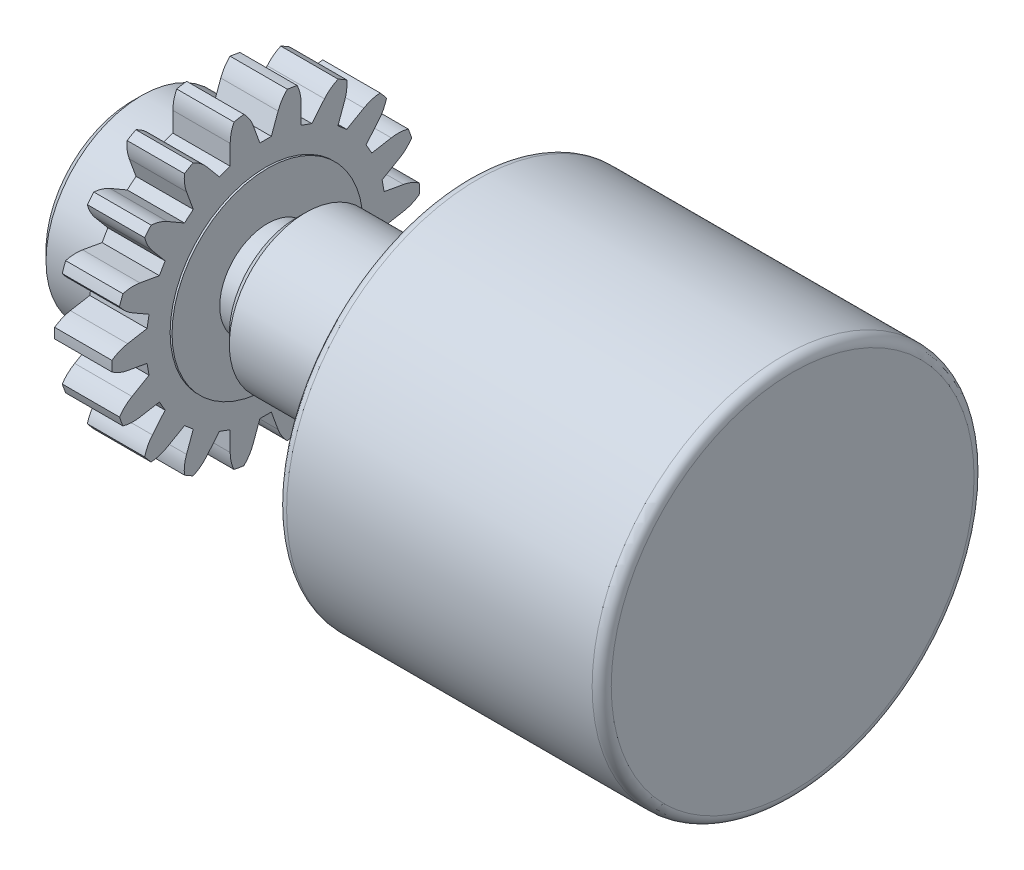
ISO-10303-21;
HEADER;
FILE_DESCRIPTION(('STEP AP214'),'2;1');
FILE_NAME('part.step','',(''),(''),'','','');
FILE_SCHEMA(('AUTOMOTIVE_DESIGN { 1 0 10303 214 1 1 1 1 }'));
ENDSEC;
DATA;
#1=APPLICATION_CONTEXT('core data for automotive mechanical design processes');
#2=APPLICATION_PROTOCOL_DEFINITION('international standard','automotive_design',2000,#1);
#3=PRODUCT_CONTEXT('',#1,'mechanical');
#4=PRODUCT('Part','Part','',(#3));
#5=PRODUCT_RELATED_PRODUCT_CATEGORY('part','',(#4));
#6=PRODUCT_DEFINITION_FORMATION('','',#4);
#7=PRODUCT_DEFINITION_CONTEXT('part definition',#1,'design');
#8=PRODUCT_DEFINITION('design','',#6,#7);
#9=PRODUCT_DEFINITION_SHAPE('','',#8);
#10=(LENGTH_UNIT() NAMED_UNIT(*) SI_UNIT(.MILLI.,.METRE.));
#11=(NAMED_UNIT(*) PLANE_ANGLE_UNIT() SI_UNIT($,.RADIAN.));
#12=(NAMED_UNIT(*) SI_UNIT($,.STERADIAN.) SOLID_ANGLE_UNIT());
#13=UNCERTAINTY_MEASURE_WITH_UNIT(LENGTH_MEASURE(1.E-05),#10,'distance_accuracy_value','');
#14=(GEOMETRIC_REPRESENTATION_CONTEXT(3) GLOBAL_UNCERTAINTY_ASSIGNED_CONTEXT((#13)) GLOBAL_UNIT_ASSIGNED_CONTEXT((#10,
#11,#12)) REPRESENTATION_CONTEXT('',''));
#15=CARTESIAN_POINT('',(0.,0.,0.));
#16=DIRECTION('',(0.,0.,1.));
#17=DIRECTION('',(1.,0.,0.));
#18=AXIS2_PLACEMENT_3D('',#15,#16,#17);
#19=CARTESIAN_POINT('',(13.1,0.,0.));
#20=DIRECTION('',(-1.,0.,0.));
#21=DIRECTION('',(0.,0.,1.));
#22=AXIS2_PLACEMENT_3D('',#19,#20,#21);
#23=PLANE('',#22);
#24=CARTESIAN_POINT('',(13.1,0.,0.));
#25=DIRECTION('',(-1.,0.,0.));
#26=DIRECTION('',(0.,0.,1.));
#27=AXIS2_PLACEMENT_3D('',#24,#25,#26);
#28=CIRCLE('',#27,6.);
#29=CARTESIAN_POINT('',(13.1,0.,6.));
#30=VERTEX_POINT('',#29);
#31=EDGE_CURVE('E12',#30,#30,#28,.T.);
#32=ORIENTED_EDGE('',*,*,#31,.T.);
#33=EDGE_LOOP('',(#32));
#34=FACE_BOUND('',#33,.T.);
#35=CARTESIAN_POINT('',(13.1,0.,0.));
#36=DIRECTION('',(-1.,0.,0.));
#37=DIRECTION('',(0.,0.,1.));
#38=AXIS2_PLACEMENT_3D('',#35,#36,#37);
#39=CIRCLE('',#38,4.);
#40=CARTESIAN_POINT('',(13.1,0.,4.));
#41=VERTEX_POINT('',#40);
#42=EDGE_CURVE('E61',#41,#41,#39,.T.);
#43=ORIENTED_EDGE('',*,*,#42,.F.);
#44=EDGE_LOOP('',(#43));
#45=FACE_BOUND('',#44,.T.);
#46=ADVANCED_FACE('F50',(#34,#45),#23,.T.);
#47=CARTESIAN_POINT('',(13.6,0.,0.));
#48=DIRECTION('',(-1.,0.,0.));
#49=DIRECTION('',(0.,0.,1.));
#50=AXIS2_PLACEMENT_3D('',#47,#48,#49);
#51=PLANE('',#50);
#52=CARTESIAN_POINT('',(13.6,0.,0.));
#53=DIRECTION('',(-1.,0.,0.));
#54=DIRECTION('',(0.,0.,1.));
#55=AXIS2_PLACEMENT_3D('',#52,#53,#54);
#56=CIRCLE('',#55,6.);
#57=CARTESIAN_POINT('',(13.6,0.,6.));
#58=VERTEX_POINT('',#57);
#59=EDGE_CURVE('E54',#58,#58,#56,.T.);
#60=ORIENTED_EDGE('',*,*,#59,.F.);
#61=EDGE_LOOP('',(#60));
#62=FACE_BOUND('',#61,.T.);
#63=CARTESIAN_POINT('',(13.6,0.,0.));
#64=DIRECTION('',(-1.,0.,0.));
#65=DIRECTION('',(0.,0.,1.));
#66=AXIS2_PLACEMENT_3D('',#63,#64,#65);
#67=CIRCLE('',#66,4.);
#68=CARTESIAN_POINT('',(13.6,0.,4.));
#69=VERTEX_POINT('',#68);
#70=EDGE_CURVE('E63',#69,#69,#67,.T.);
#71=ORIENTED_EDGE('',*,*,#70,.T.);
#72=EDGE_LOOP('',(#71));
#73=FACE_BOUND('',#72,.T.);
#74=ADVANCED_FACE('F73',(#62,#73),#51,.F.);
#75=CARTESIAN_POINT('',(13.1,0.,0.));
#76=DIRECTION('',(1.,0.,0.));
#77=DIRECTION('',(0.,0.,-1.));
#78=AXIS2_PLACEMENT_3D('',#75,#76,#77);
#79=CYLINDRICAL_SURFACE('',#78,6.);
#80=ORIENTED_EDGE('',*,*,#31,.F.);
#81=EDGE_LOOP('',(#80));
#82=FACE_BOUND('',#81,.T.);
#83=ORIENTED_EDGE('',*,*,#59,.T.);
#84=EDGE_LOOP('',(#83));
#85=FACE_BOUND('',#84,.T.);
#86=ADVANCED_FACE('F52',(#82,#85),#79,.T.);
#87=CARTESIAN_POINT('',(13.1,0.,0.));
#88=DIRECTION('',(1.,0.,0.));
#89=DIRECTION('',(0.,0.,-1.));
#90=AXIS2_PLACEMENT_3D('',#87,#88,#89);
#91=CYLINDRICAL_SURFACE('',#90,4.);
#92=ORIENTED_EDGE('',*,*,#42,.T.);
#93=EDGE_LOOP('',(#92));
#94=FACE_BOUND('',#93,.T.);
#95=ORIENTED_EDGE('',*,*,#70,.F.);
#96=EDGE_LOOP('',(#95));
#97=FACE_BOUND('',#96,.T.);
#98=ADVANCED_FACE('F69',(#94,#97),#91,.F.);
#99=CLOSED_SHELL('',(#46,#74,#86,#98));
#100=MANIFOLD_SOLID_BREP('B2',#99);
#101=CARTESIAN_POINT('',(3.1,-5.,0.));
#102=DIRECTION('',(-1.,0.,0.));
#103=DIRECTION('',(0.,0.,1.));
#104=AXIS2_PLACEMENT_3D('',#101,#102,#103);
#105=PLANE('',#104);
#106=CARTESIAN_POINT('',(3.1,0.,0.));
#107=DIRECTION('',(-1.,0.,0.));
#108=DIRECTION('',(0.,0.,1.));
#109=AXIS2_PLACEMENT_3D('',#106,#107,#108);
#110=CIRCLE('',#109,5.);
#111=CARTESIAN_POINT('',(3.1,0.,5.));
#112=VERTEX_POINT('',#111);
#113=EDGE_CURVE('E1465',#112,#112,#110,.T.);
#114=ORIENTED_EDGE('',*,*,#113,.F.);
#115=EDGE_LOOP('',(#114));
#116=FACE_BOUND('',#115,.T.);
#117=CARTESIAN_POINT('',(3.1,0.,0.));
#118=DIRECTION('',(-1.,0.,0.));
#119=DIRECTION('',(0.,0.,1.));
#120=AXIS2_PLACEMENT_3D('',#117,#118,#119);
#121=CIRCLE('',#120,2.5);
#122=CARTESIAN_POINT('',(3.1,0.,2.5));
#123=VERTEX_POINT('',#122);
#124=EDGE_CURVE('E1576',#123,#123,#121,.F.);
#125=ORIENTED_EDGE('',*,*,#124,.F.);
#126=EDGE_LOOP('',(#125));
#127=FACE_BOUND('',#126,.T.);
#128=ADVANCED_FACE('F111',(#116,#127),#105,.F.);
#129=CARTESIAN_POINT('',(-19.4483135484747,0.,0.));
#130=DIRECTION('',(-1.,0.,0.));
#131=DIRECTION('',(0.,0.,1.));
#132=AXIS2_PLACEMENT_3D('',#129,#130,#131);
#133=CYLINDRICAL_SURFACE('',#132,8.05);
#134=CARTESIAN_POINT('',(3.,0.,0.));
#135=DIRECTION('',(-1.,0.,0.));
#136=DIRECTION('',(0.,0.,1.));
#137=AXIS2_PLACEMENT_3D('',#134,#135,#136);
#138=CIRCLE('',#137,8.05);
#139=CARTESIAN_POINT('',(3.,6.8362336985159,4.25069509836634));
#140=VERTEX_POINT('',#139);
#141=CARTESIAN_POINT('',(3.,7.09970186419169,3.7943027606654));
#142=VERTEX_POINT('',#141);
#143=EDGE_CURVE('E3000',#140,#142,#138,.T.);
#144=ORIENTED_EDGE('',*,*,#143,.T.);
#145=DIRECTION('',(-1.,0.,0.));
#146=VECTOR('',#145,1.);
#147=CARTESIAN_POINT('',(1.55,7.09970186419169,3.7943027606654));
#148=LINE('',#147,#146);
#149=CARTESIAN_POINT('',(0.,7.09970186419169,3.7943027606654));
#150=VERTEX_POINT('',#149);
#151=EDGE_CURVE('E1573',#142,#150,#148,.T.);
#152=ORIENTED_EDGE('',*,*,#151,.T.);
#153=CARTESIAN_POINT('',(0.,0.,0.));
#154=DIRECTION('',(-1.,0.,0.));
#155=DIRECTION('',(0.,0.,1.));
#156=AXIS2_PLACEMENT_3D('',#153,#154,#155);
#157=CIRCLE('',#156,8.05);
#158=CARTESIAN_POINT('',(0.,6.8362336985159,4.25069509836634));
#159=VERTEX_POINT('',#158);
#160=EDGE_CURVE('E3015',#159,#150,#157,.T.);
#161=ORIENTED_EDGE('',*,*,#160,.F.);
#162=DIRECTION('',(-1.,0.,0.));
#163=VECTOR('',#162,1.);
#164=CARTESIAN_POINT('',(1.55,6.8362336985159,4.25069509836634));
#165=LINE('',#164,#163);
#166=EDGE_CURVE('E1567',#159,#140,#165,.F.);
#167=ORIENTED_EDGE('',*,*,#166,.T.);
#168=EDGE_LOOP('',(#144,#152,#161,#167));
#169=FACE_BOUND('',#168,.T.);
#170=ADVANCED_FACE('F1611',(#169),#133,.T.);
#171=CARTESIAN_POINT('',(3.,4.97013501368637,6.33247644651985));
#172=VERTEX_POINT('',#171);
#173=CARTESIAN_POINT('',(3.,5.37380947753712,5.99371935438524));
#174=VERTEX_POINT('',#173);
#175=EDGE_CURVE('E2996',#172,#174,#138,.T.);
#176=ORIENTED_EDGE('',*,*,#175,.T.);
#177=DIRECTION('',(-1.,0.,0.));
#178=VECTOR('',#177,1.);
#179=CARTESIAN_POINT('',(1.55,5.37380947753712,5.99371935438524));
#180=LINE('',#179,#178);
#181=CARTESIAN_POINT('',(0.,5.37380947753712,5.99371935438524));
#182=VERTEX_POINT('',#181);
#183=EDGE_CURVE('E1569',#174,#182,#180,.T.);
#184=ORIENTED_EDGE('',*,*,#183,.T.);
#185=CARTESIAN_POINT('',(0.,4.97013501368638,6.33247644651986));
#186=VERTEX_POINT('',#185);
#187=EDGE_CURVE('E3016',#186,#182,#157,.T.);
#188=ORIENTED_EDGE('',*,*,#187,.F.);
#189=DIRECTION('',(-1.,0.,0.));
#190=VECTOR('',#189,1.);
#191=CARTESIAN_POINT('',(1.55,4.97013501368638,6.33247644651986));
#192=LINE('',#191,#190);
#193=EDGE_CURVE('E1561',#186,#172,#192,.F.);
#194=ORIENTED_EDGE('',*,*,#193,.T.);
#195=EDGE_LOOP('',(#176,#184,#188,#194));
#196=FACE_BOUND('',#195,.T.);
#197=ADVANCED_FACE('F1617',(#196),#133,.T.);
#198=CARTESIAN_POINT('',(3.,2.5045646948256,7.65046767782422));
#199=VERTEX_POINT('',#198);
#200=CARTESIAN_POINT('',(3.,2.99975635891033,7.47020493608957));
#201=VERTEX_POINT('',#200);
#202=EDGE_CURVE('E2999',#199,#201,#138,.T.);
#203=ORIENTED_EDGE('',*,*,#202,.T.);
#204=DIRECTION('',(-1.,0.,0.));
#205=VECTOR('',#204,1.);
#206=CARTESIAN_POINT('',(1.55,2.99975635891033,7.47020493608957));
#207=LINE('',#206,#205);
#208=CARTESIAN_POINT('',(0.,2.99975635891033,7.47020493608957));
#209=VERTEX_POINT('',#208);
#210=EDGE_CURVE('E1564',#201,#209,#207,.T.);
#211=ORIENTED_EDGE('',*,*,#210,.T.);
#212=CARTESIAN_POINT('',(0.,2.5045646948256,7.65046767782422));
#213=VERTEX_POINT('',#212);
#214=EDGE_CURVE('E3020',#213,#209,#157,.T.);
#215=ORIENTED_EDGE('',*,*,#214,.F.);
#216=DIRECTION('',(-1.,0.,0.));
#217=VECTOR('',#216,1.);
#218=CARTESIAN_POINT('',(1.55,2.5045646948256,7.65046767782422));
#219=LINE('',#218,#217);
#220=EDGE_CURVE('E1555',#213,#199,#219,.F.);
#221=ORIENTED_EDGE('',*,*,#220,.T.);
#222=EDGE_LOOP('',(#203,#211,#215,#221));
#223=FACE_BOUND('',#222,.T.);
#224=ADVANCED_FACE('F2154',(#223),#133,.T.);
#225=CARTESIAN_POINT('',(3.,-0.263093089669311,8.04569959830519));
#226=VERTEX_POINT('',#225);
#227=CARTESIAN_POINT('',(3.,0.26388835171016,8.04567355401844));
#228=VERTEX_POINT('',#227);
#229=EDGE_CURVE('E3002',#226,#228,#138,.T.);
#230=ORIENTED_EDGE('',*,*,#229,.T.);
#231=DIRECTION('',(-1.,0.,0.));
#232=VECTOR('',#231,1.);
#233=CARTESIAN_POINT('',(1.55,0.26388835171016,8.04567355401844));
#234=LINE('',#233,#232);
#235=CARTESIAN_POINT('',(0.,0.263888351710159,8.04567355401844));
#236=VERTEX_POINT('',#235);
#237=EDGE_CURVE('E1558',#228,#236,#234,.T.);
#238=ORIENTED_EDGE('',*,*,#237,.T.);
#239=CARTESIAN_POINT('',(0.,-0.263093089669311,8.04569959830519));
#240=VERTEX_POINT('',#239);
#241=EDGE_CURVE('E3024',#240,#236,#157,.T.);
#242=ORIENTED_EDGE('',*,*,#241,.F.);
#243=DIRECTION('',(-1.,0.,0.));
#244=VECTOR('',#243,1.);
#245=CARTESIAN_POINT('',(1.55,-0.263093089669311,8.04569959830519));
#246=LINE('',#245,#244);
#247=EDGE_CURVE('E1549',#240,#226,#246,.F.);
#248=ORIENTED_EDGE('',*,*,#247,.T.);
#249=EDGE_LOOP('',(#230,#238,#242,#248));
#250=FACE_BOUND('',#249,.T.);
#251=ADVANCED_FACE('F2147',(#250),#133,.T.);
#252=CARTESIAN_POINT('',(3.,-2.99901796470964,7.47050140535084));
#253=VERTEX_POINT('',#252);
#254=CARTESIAN_POINT('',(3.,-2.50380848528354,7.65071519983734));
#255=VERTEX_POINT('',#254);
#256=EDGE_CURVE('E3130',#253,#255,#138,.T.);
#257=ORIENTED_EDGE('',*,*,#256,.T.);
#258=DIRECTION('',(-1.,0.,0.));
#259=VECTOR('',#258,1.);
#260=CARTESIAN_POINT('',(1.55,-2.50380848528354,7.65071519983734));
#261=LINE('',#260,#259);
#262=CARTESIAN_POINT('',(0.,-2.50380848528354,7.65071519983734));
#263=VERTEX_POINT('',#262);
#264=EDGE_CURVE('E1552',#255,#263,#261,.T.);
#265=ORIENTED_EDGE('',*,*,#264,.T.);
#266=CARTESIAN_POINT('',(0.,-2.99901796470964,7.47050140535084));
#267=VERTEX_POINT('',#266);
#268=EDGE_CURVE('E3029',#267,#263,#157,.T.);
#269=ORIENTED_EDGE('',*,*,#268,.F.);
#270=DIRECTION('',(-1.,0.,0.));
#271=VECTOR('',#270,1.);
#272=CARTESIAN_POINT('',(1.55,-2.99901796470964,7.47050140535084));
#273=LINE('',#272,#271);
#274=EDGE_CURVE('E1543',#267,#253,#273,.F.);
#275=ORIENTED_EDGE('',*,*,#274,.T.);
#276=EDGE_LOOP('',(#257,#265,#269,#275));
#277=FACE_BOUND('',#276,.T.);
#278=ADVANCED_FACE('F2140',(#277),#133,.T.);
#279=CARTESIAN_POINT('',(3.,-5.37321701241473,5.99425049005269));
#280=VERTEX_POINT('',#279);
#281=CARTESIAN_POINT('',(3.,-4.96950906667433,6.33296768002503));
#282=VERTEX_POINT('',#281);
#283=EDGE_CURVE('E3127',#280,#282,#138,.T.);
#284=ORIENTED_EDGE('',*,*,#283,.T.);
#285=DIRECTION('',(-1.,0.,0.));
#286=VECTOR('',#285,1.);
#287=CARTESIAN_POINT('',(1.55,-4.96950906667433,6.33296768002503));
#288=LINE('',#287,#286);
#289=CARTESIAN_POINT('',(0.,-4.96950906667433,6.33296768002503));
#290=VERTEX_POINT('',#289);
#291=EDGE_CURVE('E1546',#282,#290,#288,.T.);
#292=ORIENTED_EDGE('',*,*,#291,.T.);
#293=CARTESIAN_POINT('',(0.,-5.37321701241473,5.99425049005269));
#294=VERTEX_POINT('',#293);
#295=EDGE_CURVE('E3034',#294,#290,#157,.T.);
#296=ORIENTED_EDGE('',*,*,#295,.F.);
#297=DIRECTION('',(-1.,0.,0.));
#298=VECTOR('',#297,1.);
#299=CARTESIAN_POINT('',(1.55,-5.37321701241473,5.99425049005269));
#300=LINE('',#299,#298);
#301=EDGE_CURVE('E1537',#294,#280,#300,.F.);
#302=ORIENTED_EDGE('',*,*,#301,.T.);
#303=EDGE_LOOP('',(#284,#292,#296,#302));
#304=FACE_BOUND('',#303,.T.);
#305=ADVANCED_FACE('F2133',(#304),#133,.T.);
#306=CARTESIAN_POINT('',(3.,-7.09932678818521,3.79500449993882));
#307=VERTEX_POINT('',#306);
#308=CARTESIAN_POINT('',(3.,-6.83581351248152,4.25137079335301));
#309=VERTEX_POINT('',#308);
#310=EDGE_CURVE('E3124',#307,#309,#138,.T.);
#311=ORIENTED_EDGE('',*,*,#310,.T.);
#312=DIRECTION('',(-1.,0.,0.));
#313=VECTOR('',#312,1.);
#314=CARTESIAN_POINT('',(1.55,-6.83581351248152,4.25137079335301));
#315=LINE('',#314,#313);
#316=CARTESIAN_POINT('',(0.,-6.83581351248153,4.25137079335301));
#317=VERTEX_POINT('',#316);
#318=EDGE_CURVE('E1540',#309,#317,#315,.T.);
#319=ORIENTED_EDGE('',*,*,#318,.T.);
#320=CARTESIAN_POINT('',(0.,-7.09932678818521,3.79500449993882));
#321=VERTEX_POINT('',#320);
#322=EDGE_CURVE('E3039',#321,#317,#157,.T.);
#323=ORIENTED_EDGE('',*,*,#322,.F.);
#324=DIRECTION('',(-1.,0.,0.));
#325=VECTOR('',#324,1.);
#326=CARTESIAN_POINT('',(1.55,-7.09932678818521,3.79500449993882));
#327=LINE('',#326,#325);
#328=EDGE_CURVE('E1531',#321,#307,#327,.F.);
#329=ORIENTED_EDGE('',*,*,#328,.T.);
#330=EDGE_LOOP('',(#311,#319,#323,#329));
#331=FACE_BOUND('',#330,.T.);
#332=ADVANCED_FACE('F2126',(#331),#133,.T.);
#333=CARTESIAN_POINT('',(3.,-7.96915297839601,1.1380249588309));
#334=VERTEX_POINT('',#333);
#335=CARTESIAN_POINT('',(3.,-7.87761796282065,1.65699584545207));
#336=VERTEX_POINT('',#335);
#337=EDGE_CURVE('E3121',#334,#336,#138,.T.);
#338=ORIENTED_EDGE('',*,*,#337,.T.);
#339=DIRECTION('',(-1.,0.,0.));
#340=VECTOR('',#339,1.);
#341=CARTESIAN_POINT('',(1.55,-7.87761796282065,1.65699584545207));
#342=LINE('',#341,#340);
#343=CARTESIAN_POINT('',(0.,-7.87761796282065,1.65699584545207));
#344=VERTEX_POINT('',#343);
#345=EDGE_CURVE('E1534',#336,#344,#342,.T.);
#346=ORIENTED_EDGE('',*,*,#345,.T.);
#347=CARTESIAN_POINT('',(0.,-7.96915297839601,1.1380249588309));
#348=VERTEX_POINT('',#347);
#349=EDGE_CURVE('E3044',#348,#344,#157,.T.);
#350=ORIENTED_EDGE('',*,*,#349,.F.);
#351=DIRECTION('',(-1.,0.,0.));
#352=VECTOR('',#351,1.);
#353=CARTESIAN_POINT('',(1.55,-7.96915297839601,1.1380249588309));
#354=LINE('',#353,#352);
#355=EDGE_CURVE('E1525',#348,#334,#354,.F.);
#356=ORIENTED_EDGE('',*,*,#355,.T.);
#357=EDGE_LOOP('',(#338,#346,#350,#356));
#358=FACE_BOUND('',#357,.T.);
#359=ADVANCED_FACE('F2119',(#358),#133,.T.);
#360=CARTESIAN_POINT('',(3.,-7.87778170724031,-1.65621718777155));
#361=VERTEX_POINT('',#360);
#362=CARTESIAN_POINT('',(3.,-7.96926542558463,-1.13723725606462));
#363=VERTEX_POINT('',#362);
#364=EDGE_CURVE('E3118',#361,#363,#138,.T.);
#365=ORIENTED_EDGE('',*,*,#364,.T.);
#366=DIRECTION('',(-1.,0.,0.));
#367=VECTOR('',#366,1.);
#368=CARTESIAN_POINT('',(1.55,-7.96926542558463,-1.13723725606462));
#369=LINE('',#368,#367);
#370=CARTESIAN_POINT('',(0.,-7.96926542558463,-1.13723725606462));
#371=VERTEX_POINT('',#370);
#372=EDGE_CURVE('E1528',#363,#371,#369,.T.);
#373=ORIENTED_EDGE('',*,*,#372,.T.);
#374=CARTESIAN_POINT('',(0.,-7.87778170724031,-1.65621718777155));
#375=VERTEX_POINT('',#374);
#376=EDGE_CURVE('E3049',#375,#371,#157,.T.);
#377=ORIENTED_EDGE('',*,*,#376,.F.);
#378=DIRECTION('',(-1.,0.,0.));
#379=VECTOR('',#378,1.);
#380=CARTESIAN_POINT('',(1.55,-7.87778170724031,-1.65621718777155));
#381=LINE('',#380,#379);
#382=EDGE_CURVE('E1519',#375,#361,#381,.F.);
#383=ORIENTED_EDGE('',*,*,#382,.T.);
#384=EDGE_LOOP('',(#365,#373,#377,#383));
#385=FACE_BOUND('',#384,.T.);
#386=ADVANCED_FACE('F2112',(#385),#133,.T.);
#387=CARTESIAN_POINT('',(3.,-6.83623369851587,-4.25069509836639));
#388=VERTEX_POINT('',#387);
#389=CARTESIAN_POINT('',(3.,-7.09970186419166,-3.79430276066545));
#390=VERTEX_POINT('',#389);
#391=EDGE_CURVE('E3115',#388,#390,#138,.T.);
#392=ORIENTED_EDGE('',*,*,#391,.T.);
#393=DIRECTION('',(-1.,0.,0.));
#394=VECTOR('',#393,1.);
#395=CARTESIAN_POINT('',(1.55,-7.09970186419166,-3.79430276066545));
#396=LINE('',#395,#394);
#397=CARTESIAN_POINT('',(0.,-7.09970186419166,-3.79430276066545));
#398=VERTEX_POINT('',#397);
#399=EDGE_CURVE('E1522',#390,#398,#396,.T.);
#400=ORIENTED_EDGE('',*,*,#399,.T.);
#401=CARTESIAN_POINT('',(0.,-6.83623369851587,-4.25069509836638));
#402=VERTEX_POINT('',#401);
#403=EDGE_CURVE('E3054',#402,#398,#157,.T.);
#404=ORIENTED_EDGE('',*,*,#403,.F.);
#405=DIRECTION('',(-1.,0.,0.));
#406=VECTOR('',#405,1.);
#407=CARTESIAN_POINT('',(1.55,-6.83623369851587,-4.25069509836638));
#408=LINE('',#407,#406);
#409=EDGE_CURVE('E1513',#402,#388,#408,.F.);
#410=ORIENTED_EDGE('',*,*,#409,.T.);
#411=EDGE_LOOP('',(#392,#400,#404,#410));
#412=FACE_BOUND('',#411,.T.);
#413=ADVANCED_FACE('F2105',(#412),#133,.T.);
#414=CARTESIAN_POINT('',(3.,-4.97013501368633,-6.33247644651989));
#415=VERTEX_POINT('',#414);
#416=CARTESIAN_POINT('',(3.,-5.37380947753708,-5.99371935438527));
#417=VERTEX_POINT('',#416);
#418=EDGE_CURVE('E3112',#415,#417,#138,.T.);
#419=ORIENTED_EDGE('',*,*,#418,.T.);
#420=DIRECTION('',(-1.,0.,0.));
#421=VECTOR('',#420,1.);
#422=CARTESIAN_POINT('',(1.55,-5.37380947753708,-5.99371935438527));
#423=LINE('',#422,#421);
#424=CARTESIAN_POINT('',(0.,-5.37380947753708,-5.99371935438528));
#425=VERTEX_POINT('',#424);
#426=EDGE_CURVE('E1516',#417,#425,#423,.T.);
#427=ORIENTED_EDGE('',*,*,#426,.T.);
#428=CARTESIAN_POINT('',(0.,-4.97013501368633,-6.33247644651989));
#429=VERTEX_POINT('',#428);
#430=EDGE_CURVE('E3059',#429,#425,#157,.T.);
#431=ORIENTED_EDGE('',*,*,#430,.F.);
#432=DIRECTION('',(-1.,0.,0.));
#433=VECTOR('',#432,1.);
#434=CARTESIAN_POINT('',(1.55,-4.97013501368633,-6.33247644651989));
#435=LINE('',#434,#433);
#436=EDGE_CURVE('E1507',#429,#415,#435,.F.);
#437=ORIENTED_EDGE('',*,*,#436,.T.);
#438=EDGE_LOOP('',(#419,#427,#431,#437));
#439=FACE_BOUND('',#438,.T.);
#440=ADVANCED_FACE('F2098',(#439),#133,.T.);
#441=CARTESIAN_POINT('',(3.,-2.50456469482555,-7.65046767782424));
#442=VERTEX_POINT('',#441);
#443=CARTESIAN_POINT('',(3.,-2.99975635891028,-7.47020493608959));
#444=VERTEX_POINT('',#443);
#445=EDGE_CURVE('E3109',#442,#444,#138,.T.);
#446=ORIENTED_EDGE('',*,*,#445,.T.);
#447=DIRECTION('',(-1.,0.,0.));
#448=VECTOR('',#447,1.);
#449=CARTESIAN_POINT('',(1.55,-2.99975635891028,-7.47020493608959));
#450=LINE('',#449,#448);
#451=CARTESIAN_POINT('',(0.,-2.99975635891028,-7.47020493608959));
#452=VERTEX_POINT('',#451);
#453=EDGE_CURVE('E1510',#444,#452,#450,.T.);
#454=ORIENTED_EDGE('',*,*,#453,.T.);
#455=CARTESIAN_POINT('',(0.,-2.50456469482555,-7.65046767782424));
#456=VERTEX_POINT('',#455);
#457=EDGE_CURVE('E3064',#456,#452,#157,.T.);
#458=ORIENTED_EDGE('',*,*,#457,.F.);
#459=DIRECTION('',(-1.,0.,0.));
#460=VECTOR('',#459,1.);
#461=CARTESIAN_POINT('',(1.55,-2.50456469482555,-7.65046767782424));
#462=LINE('',#461,#460);
#463=EDGE_CURVE('E1501',#456,#442,#462,.F.);
#464=ORIENTED_EDGE('',*,*,#463,.T.);
#465=EDGE_LOOP('',(#446,#454,#458,#464));
#466=FACE_BOUND('',#465,.T.);
#467=ADVANCED_FACE('F2091',(#466),#133,.T.);
#468=CARTESIAN_POINT('',(3.,0.263093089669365,-8.04569959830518));
#469=VERTEX_POINT('',#468);
#470=CARTESIAN_POINT('',(3.,-0.263888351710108,-8.04567355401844));
#471=VERTEX_POINT('',#470);
#472=EDGE_CURVE('E3106',#469,#471,#138,.T.);
#473=ORIENTED_EDGE('',*,*,#472,.T.);
#474=DIRECTION('',(-1.,0.,0.));
#475=VECTOR('',#474,1.);
#476=CARTESIAN_POINT('',(1.55,-0.263888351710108,-8.04567355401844));
#477=LINE('',#476,#475);
#478=CARTESIAN_POINT('',(0.,-0.263888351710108,-8.04567355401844));
#479=VERTEX_POINT('',#478);
#480=EDGE_CURVE('E1504',#471,#479,#477,.T.);
#481=ORIENTED_EDGE('',*,*,#480,.T.);
#482=CARTESIAN_POINT('',(0.,0.263093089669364,-8.04569959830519));
#483=VERTEX_POINT('',#482);
#484=EDGE_CURVE('E3069',#483,#479,#157,.T.);
#485=ORIENTED_EDGE('',*,*,#484,.F.);
#486=DIRECTION('',(-1.,0.,0.));
#487=VECTOR('',#486,1.);
#488=CARTESIAN_POINT('',(1.55,0.263093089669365,-8.04569959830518));
#489=LINE('',#488,#487);
#490=EDGE_CURVE('E1495',#483,#469,#489,.F.);
#491=ORIENTED_EDGE('',*,*,#490,.T.);
#492=EDGE_LOOP('',(#473,#481,#485,#491));
#493=FACE_BOUND('',#492,.T.);
#494=ADVANCED_FACE('F2084',(#493),#133,.T.);
#495=CARTESIAN_POINT('',(3.,2.99901796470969,-7.47050140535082));
#496=VERTEX_POINT('',#495);
#497=CARTESIAN_POINT('',(3.,2.50380848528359,-7.65071519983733));
#498=VERTEX_POINT('',#497);
#499=EDGE_CURVE('E3104',#496,#498,#138,.T.);
#500=ORIENTED_EDGE('',*,*,#499,.T.);
#501=DIRECTION('',(-1.,0.,0.));
#502=VECTOR('',#501,1.);
#503=CARTESIAN_POINT('',(1.55,2.50380848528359,-7.65071519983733));
#504=LINE('',#503,#502);
#505=CARTESIAN_POINT('',(0.,2.50380848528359,-7.65071519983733));
#506=VERTEX_POINT('',#505);
#507=EDGE_CURVE('E1498',#498,#506,#504,.T.);
#508=ORIENTED_EDGE('',*,*,#507,.T.);
#509=CARTESIAN_POINT('',(0.,2.99901796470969,-7.47050140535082));
#510=VERTEX_POINT('',#509);
#511=EDGE_CURVE('E3074',#510,#506,#157,.T.);
#512=ORIENTED_EDGE('',*,*,#511,.F.);
#513=DIRECTION('',(-1.,0.,0.));
#514=VECTOR('',#513,1.);
#515=CARTESIAN_POINT('',(1.55,2.99901796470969,-7.47050140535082));
#516=LINE('',#515,#514);
#517=EDGE_CURVE('E1489',#510,#496,#516,.F.);
#518=ORIENTED_EDGE('',*,*,#517,.T.);
#519=EDGE_LOOP('',(#500,#508,#512,#518));
#520=FACE_BOUND('',#519,.T.);
#521=ADVANCED_FACE('F2077',(#520),#133,.T.);
#522=CARTESIAN_POINT('',(3.,5.37321701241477,-5.99425049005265));
#523=VERTEX_POINT('',#522);
#524=CARTESIAN_POINT('',(3.,4.96950906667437,-6.332967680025));
#525=VERTEX_POINT('',#524);
#526=EDGE_CURVE('E3103',#523,#525,#138,.T.);
#527=ORIENTED_EDGE('',*,*,#526,.T.);
#528=DIRECTION('',(-1.,0.,0.));
#529=VECTOR('',#528,1.);
#530=CARTESIAN_POINT('',(1.55,4.96950906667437,-6.332967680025));
#531=LINE('',#530,#529);
#532=CARTESIAN_POINT('',(0.,4.96950906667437,-6.332967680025));
#533=VERTEX_POINT('',#532);
#534=EDGE_CURVE('E1492',#525,#533,#531,.T.);
#535=ORIENTED_EDGE('',*,*,#534,.T.);
#536=CARTESIAN_POINT('',(0.,5.37321701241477,-5.99425049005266));
#537=VERTEX_POINT('',#536);
#538=EDGE_CURVE('E3079',#537,#533,#157,.T.);
#539=ORIENTED_EDGE('',*,*,#538,.F.);
#540=DIRECTION('',(-1.,0.,0.));
#541=VECTOR('',#540,1.);
#542=CARTESIAN_POINT('',(1.55,5.37321701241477,-5.99425049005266));
#543=LINE('',#542,#541);
#544=EDGE_CURVE('E1483',#537,#523,#543,.F.);
#545=ORIENTED_EDGE('',*,*,#544,.T.);
#546=EDGE_LOOP('',(#527,#535,#539,#545));
#547=FACE_BOUND('',#546,.T.);
#548=ADVANCED_FACE('F2070',(#547),#133,.T.);
#549=CARTESIAN_POINT('',(3.,7.09932678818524,-3.79500449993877));
#550=VERTEX_POINT('',#549);
#551=CARTESIAN_POINT('',(3.,6.83581351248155,-4.25137079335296));
#552=VERTEX_POINT('',#551);
#553=EDGE_CURVE('E1457',#550,#552,#138,.T.);
#554=ORIENTED_EDGE('',*,*,#553,.T.);
#555=DIRECTION('',(-1.,0.,0.));
#556=VECTOR('',#555,1.);
#557=CARTESIAN_POINT('',(1.55,6.83581351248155,-4.25137079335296));
#558=LINE('',#557,#556);
#559=CARTESIAN_POINT('',(0.,6.83581351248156,-4.25137079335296));
#560=VERTEX_POINT('',#559);
#561=EDGE_CURVE('E1486',#552,#560,#558,.T.);
#562=ORIENTED_EDGE('',*,*,#561,.T.);
#563=CARTESIAN_POINT('',(0.,7.09932678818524,-3.79500449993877));
#564=VERTEX_POINT('',#563);
#565=EDGE_CURVE('E1462',#564,#560,#157,.T.);
#566=ORIENTED_EDGE('',*,*,#565,.F.);
#567=DIRECTION('',(-1.,0.,0.));
#568=VECTOR('',#567,1.);
#569=CARTESIAN_POINT('',(1.55,7.09932678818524,-3.79500449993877));
#570=LINE('',#569,#568);
#571=EDGE_CURVE('E1477',#564,#550,#570,.F.);
#572=ORIENTED_EDGE('',*,*,#571,.T.);
#573=EDGE_LOOP('',(#554,#562,#566,#572));
#574=FACE_BOUND('',#573,.T.);
#575=ADVANCED_FACE('F2063',(#574),#133,.T.);
#576=CARTESIAN_POINT('',(3.,7.96915297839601,-1.1380249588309));
#577=VERTEX_POINT('',#576);
#578=CARTESIAN_POINT('',(3.,7.87761796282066,-1.65699584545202));
#579=VERTEX_POINT('',#578);
#580=EDGE_CURVE('E1453',#577,#579,#138,.T.);
#581=ORIENTED_EDGE('',*,*,#580,.T.);
#582=DIRECTION('',(-1.,0.,0.));
#583=VECTOR('',#582,1.);
#584=CARTESIAN_POINT('',(1.55,7.87761796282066,-1.65699584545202));
#585=LINE('',#584,#583);
#586=CARTESIAN_POINT('',(0.,7.87761796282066,-1.65699584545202));
#587=VERTEX_POINT('',#586);
#588=EDGE_CURVE('E1480',#579,#587,#585,.T.);
#589=ORIENTED_EDGE('',*,*,#588,.T.);
#590=CARTESIAN_POINT('',(0.,7.96915297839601,-1.1380249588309));
#591=VERTEX_POINT('',#590);
#592=EDGE_CURVE('E1458',#591,#587,#157,.T.);
#593=ORIENTED_EDGE('',*,*,#592,.F.);
#594=DIRECTION('',(-1.,0.,0.));
#595=VECTOR('',#594,1.);
#596=CARTESIAN_POINT('',(1.55,7.96915297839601,-1.1380249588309));
#597=LINE('',#596,#595);
#598=EDGE_CURVE('E1471',#591,#577,#597,.F.);
#599=ORIENTED_EDGE('',*,*,#598,.T.);
#600=EDGE_LOOP('',(#581,#589,#593,#599));
#601=FACE_BOUND('',#600,.T.);
#602=ADVANCED_FACE('F1633',(#601),#133,.T.);
#603=CARTESIAN_POINT('',(3.,-5.,0.));
#604=DIRECTION('',(-1.,0.,0.));
#605=DIRECTION('',(0.,0.,1.));
#606=AXIS2_PLACEMENT_3D('',#603,#604,#605);
#607=PLANE('',#606);
#608=DIRECTION('',(0.,0.766044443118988,0.642787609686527));
#609=VECTOR('',#608,1.);
#610=CARTESIAN_POINT('',(3.,-1.74128783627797,-3.88358192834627));
#611=LINE('',#610,#609);
#612=CARTESIAN_POINT('',(3.,5.77047283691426,2.41953368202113));
#613=VERTEX_POINT('',#612);
#614=CARTESIAN_POINT('',(3.,6.56164077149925,3.08340240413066));
#615=VERTEX_POINT('',#614);
#616=EDGE_CURVE('E821',#613,#615,#611,.T.);
#617=ORIENTED_EDGE('',*,*,#616,.T.);
#618=CARTESIAN_POINT('',(3.,5.2760655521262,4.61549129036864));
#619=DIRECTION('',(-1.,0.,0.));
#620=DIRECTION('',(0.,0.,1.));
#621=AXIS2_PLACEMENT_3D('',#618,#619,#620);
#622=CIRCLE('',#621,2.);
#623=EDGE_CURVE('E814',#615,#142,#622,.F.);
#624=ORIENTED_EDGE('',*,*,#623,.T.);
#625=ORIENTED_EDGE('',*,*,#143,.F.);
#626=CARTESIAN_POINT('',(3.,6.63563934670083,2.26078004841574));
#627=DIRECTION('',(-1.,0.,0.));
#628=DIRECTION('',(0.,0.,1.));
#629=AXIS2_PLACEMENT_3D('',#626,#627,#628);
#630=CIRCLE('',#629,2.);
#631=CARTESIAN_POINT('',(3.,5.95159906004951,4.14016528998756));
#632=VERTEX_POINT('',#631);
#633=EDGE_CURVE('E134',#140,#632,#630,.F.);
#634=ORIENTED_EDGE('',*,*,#633,.T.);
#635=DIRECTION('',(0.,-0.939692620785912,-0.34202014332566));
#636=VECTOR('',#635,1.);
#637=CARTESIAN_POINT('',(3.,-5.04952974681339,0.136081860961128));
#638=LINE('',#637,#636);
#639=CARTESIAN_POINT('',(3.,4.98116272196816,3.78695534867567));
#640=VERTEX_POINT('',#639);
#641=EDGE_CURVE('E850',#632,#640,#638,.T.);
#642=ORIENTED_EDGE('',*,*,#641,.T.);
#643=DIRECTION('',(0.,-0.64278760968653,0.766044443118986));
#644=VECTOR('',#643,1.);
#645=CARTESIAN_POINT('',(3.,2.72189821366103,6.47944194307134));
#646=LINE('',#645,#644);
#647=CARTESIAN_POINT('',(3.,4.5949414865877,4.24723589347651));
#648=VERTEX_POINT('',#647);
#649=EDGE_CURVE('E853',#640,#648,#646,.T.);
#650=ORIENTED_EDGE('',*,*,#649,.T.);
#651=DIRECTION('',(0.,0.500000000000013,0.866025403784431));
#652=VECTOR('',#651,1.);
#653=CARTESIAN_POINT('',(3.,0.357099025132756,-3.09292256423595));
#654=LINE('',#653,#652);
#655=CARTESIAN_POINT('',(3.,5.11133968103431,5.14166380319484));
#656=VERTEX_POINT('',#655);
#657=EDGE_CURVE('E856',#648,#656,#654,.T.);
#658=ORIENTED_EDGE('',*,*,#657,.T.);
#659=CARTESIAN_POINT('',(3.,3.37928887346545,6.14166380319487));
#660=DIRECTION('',(-1.,0.,0.));
#661=DIRECTION('',(0.,0.,1.));
#662=AXIS2_PLACEMENT_3D('',#659,#660,#661);
#663=CIRCLE('',#662,2.);
#664=EDGE_CURVE('E847',#656,#174,#663,.F.);
#665=ORIENTED_EDGE('',*,*,#664,.T.);
#666=ORIENTED_EDGE('',*,*,#175,.F.);
#667=CARTESIAN_POINT('',(3.,5.46222901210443,4.39396064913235));
#668=DIRECTION('',(-1.,0.,0.));
#669=DIRECTION('',(0.,0.,1.));
#670=AXIS2_PLACEMENT_3D('',#667,#668,#669);
#671=CIRCLE('',#670,2.);
#672=CARTESIAN_POINT('',(3.,4.17665379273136,5.92604953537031));
#673=VERTEX_POINT('',#672);
#674=EDGE_CURVE('E876',#172,#673,#671,.F.);
#675=ORIENTED_EDGE('',*,*,#674,.T.);
#676=DIRECTION('',(0.,-0.766044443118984,-0.642787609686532));
#677=VECTOR('',#676,1.);
#678=CARTESIAN_POINT('',(3.,-4.12643747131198,-1.04107128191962));
#679=LINE('',#678,#677);
#680=CARTESIAN_POINT('',(3.,3.38554684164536,5.26223198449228));
#681=VERTEX_POINT('',#680);
#682=EDGE_CURVE('E887',#673,#681,#679,.T.);
#683=ORIENTED_EDGE('',*,*,#682,.T.);
#684=DIRECTION('',(0.,-0.866025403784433,0.50000000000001));
#685=VECTOR('',#684,1.);
#686=CARTESIAN_POINT('',(3.,-0.6249999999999,7.57772228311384));
#687=LINE('',#686,#685);
#688=CARTESIAN_POINT('',(3.,2.86519237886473,5.56265877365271));
#689=VERTEX_POINT('',#688);
#690=EDGE_CURVE('E890',#681,#689,#687,.T.);
#691=ORIENTED_EDGE('',*,*,#690,.T.);
#692=DIRECTION('',(0.,0.173648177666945,0.984807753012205));
#693=VECTOR('',#692,1.);
#694=CARTESIAN_POINT('',(3.,1.67675713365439,-1.17729242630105));
#695=LINE('',#694,#693);
#696=CARTESIAN_POINT('',(3.,3.04453558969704,6.57976466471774));
#697=VERTEX_POINT('',#696);
#698=EDGE_CURVE('E893',#689,#697,#695,.T.);
#699=ORIENTED_EDGE('',*,*,#698,.T.);
#700=CARTESIAN_POINT('',(3.,1.07492008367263,6.92706102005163));
#701=DIRECTION('',(-1.,0.,0.));
#702=DIRECTION('',(0.,0.,1.));
#703=AXIS2_PLACEMENT_3D('',#700,#701,#702);
#704=CIRCLE('',#703,2.);
#705=EDGE_CURVE('E884',#697,#201,#704,.F.);
#706=ORIENTED_EDGE('',*,*,#705,.T.);
#707=ORIENTED_EDGE('',*,*,#202,.F.);
#708=CARTESIAN_POINT('',(3.,3.62999324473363,5.99716474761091));
#709=DIRECTION('',(-1.,0.,0.));
#710=DIRECTION('',(0.,0.,1.));
#711=AXIS2_PLACEMENT_3D('',#708,#709,#710);
#712=CIRCLE('',#711,2.);
#713=CARTESIAN_POINT('',(3.,1.89794243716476,6.99716474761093));
#714=VERTEX_POINT('',#713);
#715=EDGE_CURVE('E913',#199,#714,#712,.F.);
#716=ORIENTED_EDGE('',*,*,#715,.T.);
#717=DIRECTION('',(0.,-0.500000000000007,-0.866025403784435));
#718=VECTOR('',#717,1.);
#719=CARTESIAN_POINT('',(3.,-2.85640438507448,-1.23760550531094));
#720=LINE('',#719,#718);
#721=CARTESIAN_POINT('',(3.,1.38158404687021,6.1028057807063));
#722=VERTEX_POINT('',#721);
#723=EDGE_CURVE('E924',#714,#722,#720,.T.);
#724=ORIENTED_EDGE('',*,*,#723,.T.);
#725=DIRECTION('',(0.,-0.984807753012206,0.17364817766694));
#726=VECTOR('',#725,1.);
#727=CARTESIAN_POINT('',(3.,-3.76393044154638,7.01009881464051));
#728=LINE('',#727,#726);
#729=CARTESIAN_POINT('',(3.,0.789858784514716,6.20714290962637));
#730=VERTEX_POINT('',#729);
#731=EDGE_CURVE('E927',#722,#730,#728,.T.);
#732=ORIENTED_EDGE('',*,*,#731,.T.);
#733=DIRECTION('',(0.,-0.173648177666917,0.984807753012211));
#734=VECTOR('',#733,1.);
#735=CARTESIAN_POINT('',(3.,1.67675713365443,1.17729242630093));
#736=LINE('',#735,#734);
#737=CARTESIAN_POINT('',(3.,0.61051557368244,7.2242488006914));
#738=VERTEX_POINT('',#737);
#739=EDGE_CURVE('E930',#730,#738,#736,.T.);
#740=ORIENTED_EDGE('',*,*,#739,.T.);
#741=CARTESIAN_POINT('',(3.,-1.35909993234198,6.87695244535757));
#742=DIRECTION('',(-1.,0.,0.));
#743=DIRECTION('',(0.,0.,1.));
#744=AXIS2_PLACEMENT_3D('',#741,#742,#743);
#745=CIRCLE('',#744,2.);
#746=EDGE_CURVE('E921',#738,#228,#745,.F.);
#747=ORIENTED_EDGE('',*,*,#746,.T.);
#748=ORIENTED_EDGE('',*,*,#229,.F.);
#749=CARTESIAN_POINT('',(3.,1.35992671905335,6.87702226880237));
#750=DIRECTION('',(-1.,0.,0.));
#751=DIRECTION('',(0.,0.,1.));
#752=AXIS2_PLACEMENT_3D('',#749,#750,#751);
#753=CIRCLE('',#752,2.);
#754=CARTESIAN_POINT('',(3.,-0.60968878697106,7.22431862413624));
#755=VERTEX_POINT('',#754);
#756=EDGE_CURVE('E950',#226,#755,#753,.F.);
#757=ORIENTED_EDGE('',*,*,#756,.T.);
#758=DIRECTION('',(0.,-0.173648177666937,-0.984807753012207));
#759=VECTOR('',#758,1.);
#760=CARTESIAN_POINT('',(3.,-1.97750411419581,-0.532947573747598));
#761=LINE('',#760,#759);
#762=CARTESIAN_POINT('',(3.,-0.789018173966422,6.2072911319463));
#763=VERTEX_POINT('',#762);
#764=EDGE_CURVE('E961',#755,#763,#761,.T.);
#765=ORIENTED_EDGE('',*,*,#764,.T.);
#766=DIRECTION('',(0.,-0.98480775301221,-0.173648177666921));
#767=VECTOR('',#766,1.);
#768=CARTESIAN_POINT('',(3.,-5.93453266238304,5.29999809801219));
#769=LINE('',#768,#767);
#770=CARTESIAN_POINT('',(3.,-1.38074343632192,6.10295400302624));
#771=VERTEX_POINT('',#770);
#772=EDGE_CURVE('E964',#763,#771,#769,.T.);
#773=ORIENTED_EDGE('',*,*,#772,.T.);
#774=DIRECTION('',(0.,-0.499999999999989,0.866025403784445));
#775=VECTOR('',#774,1.);
#776=CARTESIAN_POINT('',(3.,0.357099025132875,3.09292256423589));
#777=LINE('',#776,#775);
#778=CARTESIAN_POINT('',(3.,-1.8971416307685,6.99738191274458));
#779=VERTEX_POINT('',#778);
#780=EDGE_CURVE('E967',#771,#779,#777,.T.);
#781=ORIENTED_EDGE('',*,*,#780,.T.);
#782=CARTESIAN_POINT('',(3.,-3.62919243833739,5.99738191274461));
#783=DIRECTION('',(-1.,0.,0.));
#784=DIRECTION('',(0.,0.,1.));
#785=AXIS2_PLACEMENT_3D('',#782,#783,#784);
#786=CIRCLE('',#785,2.);
#787=EDGE_CURVE('E958',#779,#255,#786,.F.);
#788=ORIENTED_EDGE('',*,*,#787,.T.);
#789=ORIENTED_EDGE('',*,*,#256,.F.);
#790=CARTESIAN_POINT('',(3.,-1.07416703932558,6.92740941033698));
#791=DIRECTION('',(-1.,0.,0.));
#792=DIRECTION('',(0.,0.,1.));
#793=AXIS2_PLACEMENT_3D('',#790,#791,#792);
#794=CIRCLE('',#793,2.);
#795=CARTESIAN_POINT('',(3.,-3.04378254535,6.58011305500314));
#796=VERTEX_POINT('',#795);
#797=EDGE_CURVE('E987',#253,#796,#794,.F.);
#798=ORIENTED_EDGE('',*,*,#797,.T.);
#799=DIRECTION('',(0.,0.173648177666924,-0.984807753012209));
#800=VECTOR('',#799,1.);
#801=CARTESIAN_POINT('',(3.,-1.9775041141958,0.532947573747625));
#802=LINE('',#801,#800);
#803=CARTESIAN_POINT('',(3.,-2.86445315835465,5.56308556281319));
#804=VERTEX_POINT('',#803);
#805=EDGE_CURVE('E998',#796,#804,#802,.T.);
#806=ORIENTED_EDGE('',*,*,#805,.T.);
#807=DIRECTION('',(0.,-0.866025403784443,-0.499999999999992));
#808=VECTOR('',#807,1.);
#809=CARTESIAN_POINT('',(3.,-6.87499999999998,3.24759526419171));
#810=LINE('',#809,#808);
#811=CARTESIAN_POINT('',(3.,-3.38480762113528,5.26265877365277));
#812=VERTEX_POINT('',#811);
#813=EDGE_CURVE('E1001',#804,#812,#810,.T.);
#814=ORIENTED_EDGE('',*,*,#813,.T.);
#815=DIRECTION('',(0.,-0.76604444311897,0.642787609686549));
#816=VECTOR('',#815,1.);
#817=CARTESIAN_POINT('',(3.,-1.74128783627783,3.88358192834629));
#818=LINE('',#817,#816);
#819=CARTESIAN_POINT('',(3.,-4.17597555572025,5.92652749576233));
#820=VERTEX_POINT('',#819);
#821=EDGE_CURVE('E1004',#812,#820,#818,.T.);
#822=ORIENTED_EDGE('',*,*,#821,.T.);
#823=CARTESIAN_POINT('',(3.,-5.46155077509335,4.39443860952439));
#824=DIRECTION('',(-1.,0.,0.));
#825=DIRECTION('',(0.,0.,1.));
#826=AXIS2_PLACEMENT_3D('',#823,#824,#825);
#827=CIRCLE('',#826,2.);
#828=EDGE_CURVE('E995',#820,#282,#827,.F.);
#829=ORIENTED_EDGE('',*,*,#828,.T.);
#830=ORIENTED_EDGE('',*,*,#283,.F.);
#831=CARTESIAN_POINT('',(3.,-3.37870039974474,6.14224873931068));
#832=DIRECTION('',(-1.,0.,0.));
#833=DIRECTION('',(0.,0.,1.));
#834=AXIS2_PLACEMENT_3D('',#831,#832,#833);
#835=CIRCLE('',#834,2.);
#836=CARTESIAN_POINT('',(3.,-5.11075120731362,5.14224873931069));
#837=VERTEX_POINT('',#836);
#838=EDGE_CURVE('E1024',#280,#837,#835,.F.);
#839=ORIENTED_EDGE('',*,*,#838,.T.);
#840=DIRECTION('',(0.,0.499999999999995,-0.866025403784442));
#841=VECTOR('',#840,1.);
#842=CARTESIAN_POINT('',(3.,-2.85640438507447,1.23760550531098));
#843=LINE('',#842,#841);
#844=CARTESIAN_POINT('',(3.,-4.59439281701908,4.24788977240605));
#845=VERTEX_POINT('',#844);
#846=EDGE_CURVE('E1035',#837,#845,#843,.T.);
#847=ORIENTED_EDGE('',*,*,#846,.T.);
#848=DIRECTION('',(0.,-0.642787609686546,-0.766044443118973));
#849=VECTOR('',#848,1.);
#850=CARTESIAN_POINT('',(3.,-6.85365732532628,1.5554031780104));
#851=LINE('',#850,#849);
#852=CARTESIAN_POINT('',(3.,-4.98061405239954,3.78760922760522));
#853=VERTEX_POINT('',#852);
#854=EDGE_CURVE('E1038',#845,#853,#851,.T.);
#855=ORIENTED_EDGE('',*,*,#854,.T.);
#856=DIRECTION('',(0.,-0.939692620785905,0.34202014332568));
#857=VECTOR('',#856,1.);
#858=CARTESIAN_POINT('',(3.,-3.78041813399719,3.35077363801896));
#859=LINE('',#858,#857);
#860=CARTESIAN_POINT('',(3.,-5.95112519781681,4.14084639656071));
#861=VERTEX_POINT('',#860);
#862=EDGE_CURVE('E1041',#853,#861,#859,.T.);
#863=ORIENTED_EDGE('',*,*,#862,.T.);
#864=CARTESIAN_POINT('',(3.,-6.63516548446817,2.26146115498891));
#865=DIRECTION('',(-1.,0.,0.));
#866=DIRECTION('',(0.,0.,1.));
#867=AXIS2_PLACEMENT_3D('',#864,#865,#866);
#868=CIRCLE('',#867,2.);
#869=EDGE_CURVE('E1032',#861,#309,#868,.F.);
#870=ORIENTED_EDGE('',*,*,#869,.T.);
#871=ORIENTED_EDGE('',*,*,#310,.F.);
#872=CARTESIAN_POINT('',(3.,-5.27571262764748,4.6162422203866));
#873=DIRECTION('',(-1.,0.,0.));
#874=DIRECTION('',(0.,0.,1.));
#875=AXIS2_PLACEMENT_3D('',#872,#873,#874);
#876=CIRCLE('',#875,2.);
#877=CARTESIAN_POINT('',(3.,-6.56128784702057,3.08415333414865));
#878=VERTEX_POINT('',#877);
#879=EDGE_CURVE('E1061',#307,#878,#876,.F.);
#880=ORIENTED_EDGE('',*,*,#879,.T.);
#881=DIRECTION('',(0.,0.766044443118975,-0.642787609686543));
#882=VECTOR('',#881,1.);
#883=CARTESIAN_POINT('',(3.,-4.12643747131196,1.04107128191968));
#884=LINE('',#883,#882);
#885=CARTESIAN_POINT('',(3.,-5.77018089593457,2.4203357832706));
#886=VERTEX_POINT('',#885);
#887=EDGE_CURVE('E1072',#878,#886,#884,.T.);
#888=ORIENTED_EDGE('',*,*,#887,.T.);
#889=DIRECTION('',(0.,-0.342020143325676,-0.939692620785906));
#890=VECTOR('',#889,1.);
#891=CARTESIAN_POINT('',(3.,-6.45796777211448,0.530656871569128));
#892=LINE('',#891,#890);
#893=CARTESIAN_POINT('',(3.,-5.97568492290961,1.8557181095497));
#894=VERTEX_POINT('',#893);
#895=EDGE_CURVE('E1075',#886,#894,#892,.T.);
#896=ORIENTED_EDGE('',*,*,#895,.T.);
#897=DIRECTION('',(0.,-1.,0.));
#898=VECTOR('',#897,1.);
#899=CARTESIAN_POINT('',(3.,-4.99999999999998,1.85571810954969));
#900=LINE('',#899,#898);
#901=CARTESIAN_POINT('',(3.,-7.00848131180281,1.85571810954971));
#902=VERTEX_POINT('',#901);
#903=EDGE_CURVE('E1078',#894,#902,#900,.T.);
#904=ORIENTED_EDGE('',*,*,#903,.T.);
#905=CARTESIAN_POINT('',(3.,-7.00848131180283,-0.144281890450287));
#906=DIRECTION('',(-1.,0.,0.));
#907=DIRECTION('',(0.,0.,1.));
#908=AXIS2_PLACEMENT_3D('',#905,#906,#907);
#909=CIRCLE('',#908,2.);
#910=EDGE_CURVE('E1069',#902,#336,#909,.F.);
#911=ORIENTED_EDGE('',*,*,#910,.T.);
#912=ORIENTED_EDGE('',*,*,#337,.F.);
#913=CARTESIAN_POINT('',(3.,-6.53639605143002,2.53344876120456));
#914=DIRECTION('',(-1.,0.,0.));
#915=DIRECTION('',(0.,0.,1.));
#916=AXIS2_PLACEMENT_3D('',#913,#914,#915);
#917=CIRCLE('',#916,2.);
#918=CARTESIAN_POINT('',(3.,-7.22043633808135,0.654063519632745));
#919=VERTEX_POINT('',#918);
#920=EDGE_CURVE('E1098',#334,#919,#917,.F.);
#921=ORIENTED_EDGE('',*,*,#920,.T.);
#922=DIRECTION('',(0.,0.939692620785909,-0.342020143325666));
#923=VECTOR('',#922,1.);
#924=CARTESIAN_POINT('',(3.,-5.0495297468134,-0.136081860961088));
#925=LINE('',#924,#923);
#926=CARTESIAN_POINT('',(3.,-6.25,0.300853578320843));
#927=VERTEX_POINT('',#926);
#928=EDGE_CURVE('E1109',#919,#927,#925,.T.);
#929=ORIENTED_EDGE('',*,*,#928,.T.);
#930=DIRECTION('',(0.,0.,-1.));
#931=VECTOR('',#930,1.);
#932=CARTESIAN_POINT('',(3.,-6.25,0.));
#933=LINE('',#932,#931);
#934=CARTESIAN_POINT('',(3.,-6.25,-0.3));
#935=VERTEX_POINT('',#934);
#936=EDGE_CURVE('E1112',#927,#935,#933,.T.);
#937=ORIENTED_EDGE('',*,*,#936,.T.);
#938=DIRECTION('',(0.,-0.93969262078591,-0.342020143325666));
#939=VECTOR('',#938,1.);
#940=CARTESIAN_POINT('',(3.,-5.04980408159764,0.136835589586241));
#941=LINE('',#940,#939);
#942=CARTESIAN_POINT('',(3.,-7.22051114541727,-0.653237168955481));
#943=VERTEX_POINT('',#942);
#944=EDGE_CURVE('E1115',#935,#943,#941,.T.);
#945=ORIENTED_EDGE('',*,*,#944,.T.);
#946=CARTESIAN_POINT('',(3.,-6.53647085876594,-2.5326224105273));
#947=DIRECTION('',(-1.,0.,0.));
#948=DIRECTION('',(0.,0.,1.));
#949=AXIS2_PLACEMENT_3D('',#946,#947,#948);
#950=CIRCLE('',#949,2.);
#951=EDGE_CURVE('E1106',#943,#363,#950,.F.);
#952=ORIENTED_EDGE('',*,*,#951,.T.);
#953=ORIENTED_EDGE('',*,*,#364,.F.);
#954=CARTESIAN_POINT('',(3.,-7.00869364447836,0.145083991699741));
#955=DIRECTION('',(-1.,0.,0.));
#956=DIRECTION('',(0.,0.,1.));
#957=AXIS2_PLACEMENT_3D('',#954,#955,#956);
#958=CIRCLE('',#957,2.);
#959=CARTESIAN_POINT('',(3.,-7.00869364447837,-1.85491600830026));
#960=VERTEX_POINT('',#959);
#961=EDGE_CURVE('E1135',#361,#960,#958,.F.);
#962=ORIENTED_EDGE('',*,*,#961,.T.);
#963=DIRECTION('',(0.,1.,0.));
#964=VECTOR('',#963,1.);
#965=CARTESIAN_POINT('',(3.,-5.00000000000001,-1.85491600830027));
#966=LINE('',#965,#964);
#967=CARTESIAN_POINT('',(3.,-5.97597686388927,-1.85491600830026));
#968=VERTEX_POINT('',#967);
#969=EDGE_CURVE('E1146',#960,#968,#966,.T.);
#970=ORIENTED_EDGE('',*,*,#969,.T.);
#971=DIRECTION('',(0.,0.342020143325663,-0.939692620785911));
#972=VECTOR('',#971,1.);
#973=CARTESIAN_POINT('',(3.,-6.45796777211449,-0.530656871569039));
#974=LINE('',#973,#972);
#975=CARTESIAN_POINT('',(3.,-5.77047283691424,-2.41953368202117));
#976=VERTEX_POINT('',#975);
#977=EDGE_CURVE('E1149',#968,#976,#974,.T.);
#978=ORIENTED_EDGE('',*,*,#977,.T.);
#979=DIRECTION('',(0.,-0.766044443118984,-0.642787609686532));
#980=VECTOR('',#979,1.);
#981=CARTESIAN_POINT('',(3.,-4.12695305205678,-1.04045683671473));
#982=LINE('',#981,#980);
#983=CARTESIAN_POINT('',(3.,-6.56164077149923,-3.08340240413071));
#984=VERTEX_POINT('',#983);
#985=EDGE_CURVE('E1152',#976,#984,#982,.T.);
#986=ORIENTED_EDGE('',*,*,#985,.T.);
#987=CARTESIAN_POINT('',(3.,-5.27606555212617,-4.61549129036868));
#988=DIRECTION('',(-1.,0.,0.));
#989=DIRECTION('',(0.,0.,1.));
#990=AXIS2_PLACEMENT_3D('',#987,#988,#989);
#991=CIRCLE('',#990,2.);
#992=EDGE_CURVE('E1143',#984,#390,#991,.F.);
#993=ORIENTED_EDGE('',*,*,#992,.T.);
#994=ORIENTED_EDGE('',*,*,#391,.F.);
#995=CARTESIAN_POINT('',(3.,-6.63563934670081,-2.26078004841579));
#996=DIRECTION('',(-1.,0.,0.));
#997=DIRECTION('',(0.,0.,1.));
#998=AXIS2_PLACEMENT_3D('',#995,#996,#997);
#999=CIRCLE('',#998,2.);
#1000=CARTESIAN_POINT('',(3.,-5.95159906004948,-4.14016528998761));
#1001=VERTEX_POINT('',#1000);
#1002=EDGE_CURVE('E1172',#388,#1001,#999,.F.);
#1003=ORIENTED_EDGE('',*,*,#1002,.T.);
#1004=DIRECTION('',(0.,0.939692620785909,0.342020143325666));
#1005=VECTOR('',#1004,1.);
#1006=CARTESIAN_POINT('',(3.,-3.78069246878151,-3.35001990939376));
#1007=LINE('',#1006,#1005);
#1008=CARTESIAN_POINT('',(3.,-4.98116272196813,-3.7869553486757));
#1009=VERTEX_POINT('',#1008);
#1010=EDGE_CURVE('E1183',#1001,#1009,#1007,.T.);
#1011=ORIENTED_EDGE('',*,*,#1010,.T.);
#1012=DIRECTION('',(0.,0.642787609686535,-0.766044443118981));
#1013=VECTOR('',#1012,1.);
#1014=CARTESIAN_POINT('',(3.,-6.8536573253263,-1.55540317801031));
#1015=LINE('',#1014,#1013);
#1016=CARTESIAN_POINT('',(3.,-4.59494148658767,-4.24723589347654));
#1017=VERTEX_POINT('',#1016);
#1018=EDGE_CURVE('E1186',#1009,#1017,#1015,.T.);
#1019=ORIENTED_EDGE('',*,*,#1018,.T.);
#1020=DIRECTION('',(0.,-0.500000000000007,-0.866025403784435));
#1021=VECTOR('',#1020,1.);
#1022=CARTESIAN_POINT('',(3.,-2.85709902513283,-1.23720445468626));
#1023=LINE('',#1022,#1021);
#1024=CARTESIAN_POINT('',(3.,-5.11133968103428,-5.14166380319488));
#1025=VERTEX_POINT('',#1024);
#1026=EDGE_CURVE('E1189',#1017,#1025,#1023,.T.);
#1027=ORIENTED_EDGE('',*,*,#1026,.T.);
#1028=CARTESIAN_POINT('',(3.,-3.37928887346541,-6.14166380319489));
#1029=DIRECTION('',(-1.,0.,0.));
#1030=DIRECTION('',(0.,0.,1.));
#1031=AXIS2_PLACEMENT_3D('',#1028,#1029,#1030);
#1032=CIRCLE('',#1031,2.);
#1033=EDGE_CURVE('E1180',#1025,#417,#1032,.F.);
#1034=ORIENTED_EDGE('',*,*,#1033,.T.);
#1035=ORIENTED_EDGE('',*,*,#418,.F.);
#1036=CARTESIAN_POINT('',(3.,-5.4622290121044,-4.39396064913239));
#1037=DIRECTION('',(-1.,0.,0.));
#1038=DIRECTION('',(0.,0.,1.));
#1039=AXIS2_PLACEMENT_3D('',#1036,#1037,#1038);
#1040=CIRCLE('',#1039,2.);
#1041=CARTESIAN_POINT('',(3.,-4.17665379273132,-5.92604953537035));
#1042=VERTEX_POINT('',#1041);
#1043=EDGE_CURVE('E1209',#415,#1042,#1040,.F.);
#1044=ORIENTED_EDGE('',*,*,#1043,.T.);
#1045=DIRECTION('',(0.,0.766044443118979,0.642787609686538));
#1046=VECTOR('',#1045,1.);
#1047=CARTESIAN_POINT('',(3.,-1.74180341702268,-3.88296748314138));
#1048=LINE('',#1047,#1046);
#1049=CARTESIAN_POINT('',(3.,-3.38554684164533,-5.26223198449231));
#1050=VERTEX_POINT('',#1049);
#1051=EDGE_CURVE('E1220',#1042,#1050,#1048,.T.);
#1052=ORIENTED_EDGE('',*,*,#1051,.T.);
#1053=DIRECTION('',(0.,0.866025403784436,-0.500000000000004));
#1054=VECTOR('',#1053,1.);
#1055=CARTESIAN_POINT('',(3.,-6.87500000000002,-3.24759526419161));
#1056=LINE('',#1055,#1054);
#1057=CARTESIAN_POINT('',(3.,-2.86519237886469,-5.56265877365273));
#1058=VERTEX_POINT('',#1057);
#1059=EDGE_CURVE('E1223',#1050,#1058,#1056,.T.);
#1060=ORIENTED_EDGE('',*,*,#1059,.T.);
#1061=DIRECTION('',(0.,-0.173648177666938,-0.984807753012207));
#1062=VECTOR('',#1061,1.);
#1063=CARTESIAN_POINT('',(3.,-1.97829402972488,-0.532808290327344));
#1064=LINE('',#1063,#1062);
#1065=CARTESIAN_POINT('',(3.,-3.04453558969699,-6.57976466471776));
#1066=VERTEX_POINT('',#1065);
#1067=EDGE_CURVE('E1226',#1058,#1066,#1064,.T.);
#1068=ORIENTED_EDGE('',*,*,#1067,.T.);
#1069=CARTESIAN_POINT('',(3.,-1.07492008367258,-6.92706102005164));
#1070=DIRECTION('',(-1.,0.,0.));
#1071=DIRECTION('',(0.,0.,1.));
#1072=AXIS2_PLACEMENT_3D('',#1069,#1070,#1071);
#1073=CIRCLE('',#1072,2.);
#1074=EDGE_CURVE('E1217',#1066,#444,#1073,.F.);
#1075=ORIENTED_EDGE('',*,*,#1074,.T.);
#1076=ORIENTED_EDGE('',*,*,#445,.F.);
#1077=CARTESIAN_POINT('',(3.,-3.62999324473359,-5.99716474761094));
#1078=DIRECTION('',(-1.,0.,0.));
#1079=DIRECTION('',(0.,0.,1.));
#1080=AXIS2_PLACEMENT_3D('',#1077,#1078,#1079);
#1081=CIRCLE('',#1080,2.);
#1082=CARTESIAN_POINT('',(3.,-1.89794243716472,-6.99716474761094));
#1083=VERTEX_POINT('',#1082);
#1084=EDGE_CURVE('E1246',#442,#1083,#1081,.F.);
#1085=ORIENTED_EDGE('',*,*,#1084,.T.);
#1086=DIRECTION('',(0.,0.500000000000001,0.866025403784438));
#1087=VECTOR('',#1086,1.);
#1088=CARTESIAN_POINT('',(3.,0.35640438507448,-3.09252151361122));
#1089=LINE('',#1088,#1087);
#1090=CARTESIAN_POINT('',(3.,-1.38158404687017,-6.10280578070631));
#1091=VERTEX_POINT('',#1090);
#1092=EDGE_CURVE('E1257',#1083,#1091,#1089,.T.);
#1093=ORIENTED_EDGE('',*,*,#1092,.T.);
#1094=DIRECTION('',(0.,0.984807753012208,-0.173648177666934));
#1095=VECTOR('',#1094,1.);
#1096=CARTESIAN_POINT('',(3.,-5.93453266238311,-5.29999809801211));
#1097=LINE('',#1096,#1095);
#1098=CARTESIAN_POINT('',(3.,-0.789858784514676,-6.20714290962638));
#1099=VERTEX_POINT('',#1098);
#1100=EDGE_CURVE('E1260',#1091,#1099,#1097,.T.);
#1101=ORIENTED_EDGE('',*,*,#1100,.T.);
#1102=DIRECTION('',(0.,0.173648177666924,-0.984807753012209));
#1103=VECTOR('',#1102,1.);
#1104=CARTESIAN_POINT('',(3.,-1.97829402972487,0.53280829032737));
#1105=LINE('',#1104,#1103);
#1106=CARTESIAN_POINT('',(3.,-0.610515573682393,-7.22424880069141));
#1107=VERTEX_POINT('',#1106);
#1108=EDGE_CURVE('E1263',#1099,#1107,#1105,.T.);
#1109=ORIENTED_EDGE('',*,*,#1108,.T.);
#1110=CARTESIAN_POINT('',(3.,1.35909993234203,-6.87695244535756));
#1111=DIRECTION('',(-1.,0.,0.));
#1112=DIRECTION('',(0.,0.,1.));
#1113=AXIS2_PLACEMENT_3D('',#1110,#1111,#1112);
#1114=CIRCLE('',#1113,2.);
#1115=EDGE_CURVE('E1254',#1107,#471,#1114,.F.);
#1116=ORIENTED_EDGE('',*,*,#1115,.T.);
#1117=ORIENTED_EDGE('',*,*,#472,.F.);
#1118=CARTESIAN_POINT('',(3.,-1.35992671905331,-6.87702226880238));
#1119=DIRECTION('',(-1.,0.,0.));
#1120=DIRECTION('',(0.,0.,1.));
#1121=AXIS2_PLACEMENT_3D('',#1118,#1119,#1120);
#1122=CIRCLE('',#1121,2.);
#1123=CARTESIAN_POINT('',(3.,0.609688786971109,-7.22431862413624));
#1124=VERTEX_POINT('',#1123);
#1125=EDGE_CURVE('E1283',#469,#1124,#1122,.F.);
#1126=ORIENTED_EDGE('',*,*,#1125,.T.);
#1127=DIRECTION('',(0.,0.173648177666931,0.984807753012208));
#1128=VECTOR('',#1127,1.);
#1129=CARTESIAN_POINT('',(3.,1.67596721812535,-1.1771531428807));
#1130=LINE('',#1129,#1128);
#1131=CARTESIAN_POINT('',(3.,0.789018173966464,-6.20729113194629));
#1132=VERTEX_POINT('',#1131);
#1133=EDGE_CURVE('E1294',#1124,#1132,#1130,.T.);
#1134=ORIENTED_EDGE('',*,*,#1133,.T.);
#1135=DIRECTION('',(0.,0.984807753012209,0.173648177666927));
#1136=VECTOR('',#1135,1.);
#1137=CARTESIAN_POINT('',(3.,-3.76393044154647,-7.01009881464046));
#1138=LINE('',#1137,#1136);
#1139=CARTESIAN_POINT('',(3.,1.38074343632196,-6.10295400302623));
#1140=VERTEX_POINT('',#1139);
#1141=EDGE_CURVE('E1297',#1132,#1140,#1138,.T.);
#1142=ORIENTED_EDGE('',*,*,#1141,.T.);
#1143=DIRECTION('',(0.,0.499999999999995,-0.866025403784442));
#1144=VECTOR('',#1143,1.);
#1145=CARTESIAN_POINT('',(3.,-2.85709902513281,1.2372044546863));
#1146=LINE('',#1145,#1144);
#1147=CARTESIAN_POINT('',(3.,1.89714163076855,-6.99738191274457));
#1148=VERTEX_POINT('',#1147);
#1149=EDGE_CURVE('E1300',#1140,#1148,#1146,.T.);
#1150=ORIENTED_EDGE('',*,*,#1149,.T.);
#1151=CARTESIAN_POINT('',(3.,3.62919243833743,-5.99738191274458));
#1152=DIRECTION('',(-1.,0.,0.));
#1153=DIRECTION('',(0.,0.,1.));
#1154=AXIS2_PLACEMENT_3D('',#1151,#1152,#1153);
#1155=CIRCLE('',#1154,2.);
#1156=EDGE_CURVE('E1291',#1148,#498,#1155,.F.);
#1157=ORIENTED_EDGE('',*,*,#1156,.T.);
#1158=ORIENTED_EDGE('',*,*,#499,.F.);
#1159=CARTESIAN_POINT('',(3.,1.07416703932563,-6.92740941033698));
#1160=DIRECTION('',(-1.,0.,0.));
#1161=DIRECTION('',(0.,0.,1.));
#1162=AXIS2_PLACEMENT_3D('',#1159,#1160,#1161);
#1163=CIRCLE('',#1162,2.);
#1164=CARTESIAN_POINT('',(3.,3.04378254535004,-6.58011305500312));
#1165=VERTEX_POINT('',#1164);
#1166=EDGE_CURVE('E1320',#496,#1165,#1163,.F.);
#1167=ORIENTED_EDGE('',*,*,#1166,.T.);
#1168=DIRECTION('',(0.,-0.173648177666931,0.984807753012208));
#1169=VECTOR('',#1168,1.);
#1170=CARTESIAN_POINT('',(3.,1.67596721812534,1.17715314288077));
#1171=LINE('',#1170,#1169);
#1172=CARTESIAN_POINT('',(3.,2.86445315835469,-5.56308556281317));
#1173=VERTEX_POINT('',#1172);
#1174=EDGE_CURVE('E1331',#1165,#1173,#1171,.T.);
#1175=ORIENTED_EDGE('',*,*,#1174,.T.);
#1176=DIRECTION('',(0.,0.86602540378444,0.499999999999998));
#1177=VECTOR('',#1176,1.);
#1178=CARTESIAN_POINT('',(3.,-0.625000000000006,-7.57772228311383));
#1179=LINE('',#1178,#1177);
#1180=CARTESIAN_POINT('',(3.,3.38480762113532,-5.26265877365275));
#1181=VERTEX_POINT('',#1180);
#1182=EDGE_CURVE('E1334',#1173,#1181,#1179,.T.);
#1183=ORIENTED_EDGE('',*,*,#1182,.T.);
#1184=DIRECTION('',(0.,0.766044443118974,-0.642787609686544));
#1185=VECTOR('',#1184,1.);
#1186=CARTESIAN_POINT('',(3.,-4.12695305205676,1.04045683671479));
#1187=LINE('',#1186,#1185);
#1188=CARTESIAN_POINT('',(3.,4.17597555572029,-5.9265274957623));
#1189=VERTEX_POINT('',#1188);
#1190=EDGE_CURVE('E1337',#1181,#1189,#1187,.T.);
#1191=ORIENTED_EDGE('',*,*,#1190,.T.);
#1192=CARTESIAN_POINT('',(3.,5.46155077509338,-4.39443860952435));
#1193=DIRECTION('',(-1.,0.,0.));
#1194=DIRECTION('',(0.,0.,1.));
#1195=AXIS2_PLACEMENT_3D('',#1192,#1193,#1194);
#1196=CIRCLE('',#1195,2.);
#1197=EDGE_CURVE('E1328',#1189,#525,#1196,.F.);
#1198=ORIENTED_EDGE('',*,*,#1197,.T.);
#1199=ORIENTED_EDGE('',*,*,#526,.F.);
#1200=CARTESIAN_POINT('',(3.,3.37870039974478,-6.14224873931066));
#1201=DIRECTION('',(-1.,0.,0.));
#1202=DIRECTION('',(0.,0.,1.));
#1203=AXIS2_PLACEMENT_3D('',#1200,#1201,#1202);
#1204=CIRCLE('',#1203,2.);
#1205=CARTESIAN_POINT('',(3.,5.11075120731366,-5.14224873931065));
#1206=VERTEX_POINT('',#1205);
#1207=EDGE_CURVE('E1357',#523,#1206,#1204,.F.);
#1208=ORIENTED_EDGE('',*,*,#1207,.T.);
#1209=DIRECTION('',(0.,-0.500000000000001,0.866025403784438));
#1210=VECTOR('',#1209,1.);
#1211=CARTESIAN_POINT('',(3.,0.356404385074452,3.09252151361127));
#1212=LINE('',#1211,#1210);
#1213=CARTESIAN_POINT('',(3.,4.59439281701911,-4.24788977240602));
#1214=VERTEX_POINT('',#1213);
#1215=EDGE_CURVE('E1368',#1206,#1214,#1212,.T.);
#1216=ORIENTED_EDGE('',*,*,#1215,.T.);
#1217=DIRECTION('',(0.,0.64278760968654,0.766044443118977));
#1218=VECTOR('',#1217,1.);
#1219=CARTESIAN_POINT('',(3.,2.72189821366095,-6.47944194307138));
#1220=LINE('',#1219,#1218);
#1221=CARTESIAN_POINT('',(3.,4.98061405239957,-3.78760922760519));
#1222=VERTEX_POINT('',#1221);
#1223=EDGE_CURVE('E1371',#1214,#1222,#1220,.T.);
#1224=ORIENTED_EDGE('',*,*,#1223,.T.);
#1225=DIRECTION('',(0.,0.939692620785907,-0.342020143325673));
#1226=VECTOR('',#1225,1.);
#1227=CARTESIAN_POINT('',(3.,-5.04980408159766,-0.136835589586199));
#1228=LINE('',#1227,#1226);
#1229=CARTESIAN_POINT('',(3.,5.95112519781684,-4.14084639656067));
#1230=VERTEX_POINT('',#1229);
#1231=EDGE_CURVE('E1374',#1222,#1230,#1228,.T.);
#1232=ORIENTED_EDGE('',*,*,#1231,.T.);
#1233=CARTESIAN_POINT('',(3.,6.63516548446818,-2.26146115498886));
#1234=DIRECTION('',(-1.,0.,0.));
#1235=DIRECTION('',(0.,0.,1.));
#1236=AXIS2_PLACEMENT_3D('',#1233,#1234,#1235);
#1237=CIRCLE('',#1236,2.);
#1238=EDGE_CURVE('E1365',#1230,#552,#1237,.F.);
#1239=ORIENTED_EDGE('',*,*,#1238,.T.);
#1240=ORIENTED_EDGE('',*,*,#553,.F.);
#1241=CARTESIAN_POINT('',(3.,5.27571262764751,-4.61624222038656));
#1242=DIRECTION('',(-1.,0.,0.));
#1243=DIRECTION('',(0.,0.,1.));
#1244=AXIS2_PLACEMENT_3D('',#1241,#1242,#1243);
#1245=CIRCLE('',#1244,2.);
#1246=CARTESIAN_POINT('',(3.,6.56128784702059,-3.0841533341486));
#1247=VERTEX_POINT('',#1246);
#1248=EDGE_CURVE('E1394',#550,#1247,#1245,.F.);
#1249=ORIENTED_EDGE('',*,*,#1248,.T.);
#1250=DIRECTION('',(0.,-0.766044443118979,0.642787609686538));
#1251=VECTOR('',#1250,1.);
#1252=CARTESIAN_POINT('',(3.,-1.74180341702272,3.8829674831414));
#1253=LINE('',#1252,#1251);
#1254=CARTESIAN_POINT('',(3.,5.77018089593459,-2.42033578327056));
#1255=VERTEX_POINT('',#1254);
#1256=EDGE_CURVE('E1405',#1247,#1255,#1253,.T.);
#1257=ORIENTED_EDGE('',*,*,#1256,.T.);
#1258=DIRECTION('',(0.,0.342020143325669,0.939692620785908));
#1259=VECTOR('',#1258,1.);
#1260=CARTESIAN_POINT('',(3.,5.28818998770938,-3.74459492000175));
#1261=LINE('',#1260,#1259);
#1262=CARTESIAN_POINT('',(3.,5.97568492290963,-1.85571810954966));
#1263=VERTEX_POINT('',#1262);
#1264=EDGE_CURVE('E1408',#1255,#1263,#1261,.T.);
#1265=ORIENTED_EDGE('',*,*,#1264,.T.);
#1266=DIRECTION('',(0.,1.,0.));
#1267=VECTOR('',#1266,1.);
#1268=CARTESIAN_POINT('',(3.,-5.00000000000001,-1.85571810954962));
#1269=LINE('',#1268,#1267);
#1270=CARTESIAN_POINT('',(3.,7.00848131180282,-1.85571810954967));
#1271=VERTEX_POINT('',#1270);
#1272=EDGE_CURVE('E1411',#1263,#1271,#1269,.T.);
#1273=ORIENTED_EDGE('',*,*,#1272,.T.);
#1274=CARTESIAN_POINT('',(3.,7.00848131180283,0.144281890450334));
#1275=DIRECTION('',(-1.,0.,0.));
#1276=DIRECTION('',(0.,0.,1.));
#1277=AXIS2_PLACEMENT_3D('',#1274,#1275,#1276);
#1278=CIRCLE('',#1277,2.);
#1279=EDGE_CURVE('E1402',#1271,#579,#1278,.F.);
#1280=ORIENTED_EDGE('',*,*,#1279,.T.);
#1281=ORIENTED_EDGE('',*,*,#580,.F.);
#1282=CARTESIAN_POINT('',(3.,6.53639605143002,-2.53344876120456));
#1283=DIRECTION('',(-1.,0.,0.));
#1284=DIRECTION('',(0.,0.,1.));
#1285=AXIS2_PLACEMENT_3D('',#1282,#1283,#1284);
#1286=CIRCLE('',#1285,2.);
#1287=CARTESIAN_POINT('',(3.,7.22043633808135,-0.654063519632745));
#1288=VERTEX_POINT('',#1287);
#1289=EDGE_CURVE('E1432',#577,#1288,#1286,.F.);
#1290=ORIENTED_EDGE('',*,*,#1289,.T.);
#1291=DIRECTION('',(0.,-0.939692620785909,0.342020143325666));
#1292=VECTOR('',#1291,1.);
#1293=CARTESIAN_POINT('',(3.,-3.78069246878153,3.35001990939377));
#1294=LINE('',#1293,#1292);
#1295=CARTESIAN_POINT('',(3.,6.25,-0.300853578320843));
#1296=VERTEX_POINT('',#1295);
#1297=EDGE_CURVE('E1443',#1288,#1296,#1294,.T.);
#1298=ORIENTED_EDGE('',*,*,#1297,.T.);
#1299=DIRECTION('',(0.,0.,1.));
#1300=VECTOR('',#1299,1.);
#1301=CARTESIAN_POINT('',(3.,6.25,0.));
#1302=LINE('',#1301,#1300);
#1303=CARTESIAN_POINT('',(3.,6.25,0.3));
#1304=VERTEX_POINT('',#1303);
#1305=EDGE_CURVE('E1446',#1296,#1304,#1302,.T.);
#1306=ORIENTED_EDGE('',*,*,#1305,.T.);
#1307=DIRECTION('',(0.,0.93969262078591,0.342020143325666));
#1308=VECTOR('',#1307,1.);
#1309=CARTESIAN_POINT('',(3.,-3.78041813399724,-3.3507736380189));
#1310=LINE('',#1309,#1308);
#1311=CARTESIAN_POINT('',(3.,7.22051114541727,0.653237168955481));
#1312=VERTEX_POINT('',#1311);
#1313=EDGE_CURVE('E1449',#1304,#1312,#1310,.T.);
#1314=ORIENTED_EDGE('',*,*,#1313,.T.);
#1315=CARTESIAN_POINT('',(3.,6.53647085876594,2.5326224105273));
#1316=DIRECTION('',(-1.,0.,0.));
#1317=DIRECTION('',(0.,0.,1.));
#1318=AXIS2_PLACEMENT_3D('',#1315,#1316,#1317);
#1319=CIRCLE('',#1318,2.);
#1320=CARTESIAN_POINT('',(3.,7.96926542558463,1.13723725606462));
#1321=VERTEX_POINT('',#1320);
#1322=EDGE_CURVE('E1440',#1312,#1321,#1319,.F.);
#1323=ORIENTED_EDGE('',*,*,#1322,.T.);
#1324=CARTESIAN_POINT('',(3.,7.87778170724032,1.6562171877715));
#1325=VERTEX_POINT('',#1324);
#1326=EDGE_CURVE('E1452',#1325,#1321,#138,.T.);
#1327=ORIENTED_EDGE('',*,*,#1326,.F.);
#1328=CARTESIAN_POINT('',(3.,7.00869364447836,-0.145083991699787));
#1329=DIRECTION('',(-1.,0.,0.));
#1330=DIRECTION('',(0.,0.,1.));
#1331=AXIS2_PLACEMENT_3D('',#1328,#1329,#1330);
#1332=CIRCLE('',#1331,2.);
#1333=CARTESIAN_POINT('',(3.,7.00869364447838,1.85491600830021));
#1334=VERTEX_POINT('',#1333);
#1335=EDGE_CURVE('E126',#1325,#1334,#1332,.F.);
#1336=ORIENTED_EDGE('',*,*,#1335,.T.);
#1337=DIRECTION('',(0.,-1.,0.));
#1338=VECTOR('',#1337,1.);
#1339=CARTESIAN_POINT('',(3.,-4.99999999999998,1.85491600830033));
#1340=LINE('',#1339,#1338);
#1341=CARTESIAN_POINT('',(3.,5.97597686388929,1.85491600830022));
#1342=VERTEX_POINT('',#1341);
#1343=EDGE_CURVE('E785',#1334,#1342,#1340,.T.);
#1344=ORIENTED_EDGE('',*,*,#1343,.T.);
#1345=DIRECTION('',(0.,-0.342020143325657,0.939692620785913));
#1346=VECTOR('',#1345,1.);
#1347=CARTESIAN_POINT('',(3.,5.28818998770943,3.74459492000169));
#1348=LINE('',#1347,#1346);
#1349=EDGE_CURVE('E818',#1342,#613,#1348,.T.);
#1350=ORIENTED_EDGE('',*,*,#1349,.T.);
#1351=EDGE_LOOP('',(#617,#624,#625,#634,#642,#650,#658,#665,#666,#675,#683,#691,#699,#706,#707,
#716,#724,#732,#740,#747,#748,#757,#765,#773,#781,#788,#789,#798,#806,#814,#822,#829,#830,#839,
#847,#855,#863,#870,#871,#880,#888,#896,#904,#911,#912,#921,#929,#937,#945,#952,#953,#962,#970,
#978,#986,#993,#994,#1003,#1011,#1019,#1027,#1034,#1035,#1044,#1052,#1060,#1068,#1075,#1076,
#1085,#1093,#1101,#1109,#1116,#1117,#1126,#1134,#1142,#1150,#1157,#1158,#1167,#1175,#1183,#1191,
#1198,#1199,#1208,#1216,#1224,#1232,#1239,#1240,#1249,#1257,#1265,#1273,#1280,#1281,#1290,#1298,
#1306,#1314,#1323,#1327,#1336,#1344,#1350));
#1352=FACE_BOUND('',#1351,.T.);
#1353=CARTESIAN_POINT('',(3.,0.,0.));
#1354=DIRECTION('',(-1.,0.,0.));
#1355=DIRECTION('',(0.,0.,1.));
#1356=AXIS2_PLACEMENT_3D('',#1353,#1354,#1355);
#1357=CIRCLE('',#1356,5.);
#1358=CARTESIAN_POINT('',(3.,0.,5.));
#1359=VERTEX_POINT('',#1358);
#1360=EDGE_CURVE('E1468',#1359,#1359,#1357,.T.);
#1361=ORIENTED_EDGE('',*,*,#1360,.T.);
#1362=EDGE_LOOP('',(#1361));
#1363=FACE_BOUND('',#1362,.T.);
#1364=ADVANCED_FACE('F1629',(#1352,#1363),#607,.F.);
#1365=CARTESIAN_POINT('',(-19.4483135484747,0.,0.));
#1366=DIRECTION('',(-1.,0.,0.));
#1367=DIRECTION('',(0.,0.,1.));
#1368=AXIS2_PLACEMENT_3D('',#1365,#1366,#1367);
#1369=CYLINDRICAL_SURFACE('',#1368,5.);
#1370=ORIENTED_EDGE('',*,*,#1360,.F.);
#1371=EDGE_LOOP('',(#1370));
#1372=FACE_BOUND('',#1371,.T.);
#1373=ORIENTED_EDGE('',*,*,#113,.T.);
#1374=EDGE_LOOP('',(#1373));
#1375=FACE_BOUND('',#1374,.T.);
#1376=ADVANCED_FACE('F1626',(#1372,#1375),#1369,.T.);
#1377=CARTESIAN_POINT('',(-4.,-5.,0.));
#1378=DIRECTION('',(1.,0.,0.));
#1379=DIRECTION('',(0.,0.,-1.));
#1380=AXIS2_PLACEMENT_3D('',#1377,#1378,#1379);
#1381=PLANE('',#1380);
#1382=CARTESIAN_POINT('',(-4.,0.,0.));
#1383=DIRECTION('',(1.,0.,0.));
#1384=DIRECTION('',(0.,0.,-1.));
#1385=AXIS2_PLACEMENT_3D('',#1382,#1383,#1384);
#1386=CIRCLE('',#1385,4.5);
#1387=CARTESIAN_POINT('',(-4.,0.,-4.5));
#1388=VERTEX_POINT('',#1387);
#1389=EDGE_CURVE('E119',#1388,#1388,#1386,.F.);
#1390=ORIENTED_EDGE('',*,*,#1389,.T.);
#1391=EDGE_LOOP('',(#1390));
#1392=FACE_BOUND('',#1391,.T.);
#1393=ADVANCED_FACE('F1599',(#1392),#1381,.F.);
#1394=CARTESIAN_POINT('',(-19.4483135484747,0.,0.));
#1395=DIRECTION('',(-1.,0.,0.));
#1396=DIRECTION('',(0.,0.,1.));
#1397=AXIS2_PLACEMENT_3D('',#1394,#1395,#1396);
#1398=CYLINDRICAL_SURFACE('',#1397,5.);
#1399=CARTESIAN_POINT('',(-3.5,0.,0.));
#1400=DIRECTION('',(1.,0.,0.));
#1401=DIRECTION('',(0.,0.,-1.));
#1402=AXIS2_PLACEMENT_3D('',#1399,#1400,#1401);
#1403=CIRCLE('',#1402,5.);
#1404=CARTESIAN_POINT('',(-3.5,0.,-5.));
#1405=VERTEX_POINT('',#1404);
#1406=EDGE_CURVE('E48',#1405,#1405,#1403,.T.);
#1407=ORIENTED_EDGE('',*,*,#1406,.T.);
#1408=EDGE_LOOP('',(#1407));
#1409=FACE_BOUND('',#1408,.T.);
#1410=CARTESIAN_POINT('',(0.,0.,0.));
#1411=DIRECTION('',(-1.,0.,0.));
#1412=DIRECTION('',(0.,0.,1.));
#1413=AXIS2_PLACEMENT_3D('',#1410,#1411,#1412);
#1414=CIRCLE('',#1413,5.);
#1415=CARTESIAN_POINT('',(0.,0.,5.));
#1416=VERTEX_POINT('',#1415);
#1417=EDGE_CURVE('E1461',#1416,#1416,#1414,.T.);
#1418=ORIENTED_EDGE('',*,*,#1417,.T.);
#1419=EDGE_LOOP('',(#1418));
#1420=FACE_BOUND('',#1419,.T.);
#1421=ADVANCED_FACE('F2035',(#1409,#1420),#1398,.T.);
#1422=CARTESIAN_POINT('',(0.,-5.,0.));
#1423=DIRECTION('',(1.,0.,0.));
#1424=DIRECTION('',(0.,0.,-1.));
#1425=AXIS2_PLACEMENT_3D('',#1422,#1423,#1424);
#1426=PLANE('',#1425);
#1427=ORIENTED_EDGE('',*,*,#1417,.F.);
#1428=EDGE_LOOP('',(#1427));
#1429=FACE_BOUND('',#1428,.T.);
#1430=ORIENTED_EDGE('',*,*,#160,.T.);
#1431=CARTESIAN_POINT('',(0.,5.2760655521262,4.61549129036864));
#1432=DIRECTION('',(1.,0.,0.));
#1433=DIRECTION('',(0.,-0.342020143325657,0.939692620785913));
#1434=AXIS2_PLACEMENT_3D('',#1431,#1432,#1433);
#1435=CIRCLE('',#1434,2.);
#1436=CARTESIAN_POINT('',(0.,6.56164077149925,3.08340240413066));
#1437=VERTEX_POINT('',#1436);
#1438=EDGE_CURVE('E795',#1437,#150,#1435,.T.);
#1439=ORIENTED_EDGE('',*,*,#1438,.F.);
#1440=DIRECTION('',(0.,0.766044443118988,0.642787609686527));
#1441=VECTOR('',#1440,1.);
#1442=CARTESIAN_POINT('',(0.,6.56164077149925,3.08340240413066));
#1443=LINE('',#1442,#1441);
#1444=CARTESIAN_POINT('',(0.,5.77047283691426,2.41953368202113));
#1445=VERTEX_POINT('',#1444);
#1446=EDGE_CURVE('E787',#1445,#1437,#1443,.T.);
#1447=ORIENTED_EDGE('',*,*,#1446,.F.);
#1448=DIRECTION('',(0.,-0.342020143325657,0.939692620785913));
#1449=VECTOR('',#1448,1.);
#1450=CARTESIAN_POINT('',(0.,5.77047283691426,2.41953368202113));
#1451=LINE('',#1450,#1449);
#1452=CARTESIAN_POINT('',(0.,5.97597686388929,1.85491600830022));
#1453=VERTEX_POINT('',#1452);
#1454=EDGE_CURVE('E801',#1453,#1445,#1451,.T.);
#1455=ORIENTED_EDGE('',*,*,#1454,.F.);
#1456=DIRECTION('',(0.,-1.,0.));
#1457=VECTOR('',#1456,1.);
#1458=CARTESIAN_POINT('',(0.,5.97597686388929,1.85491600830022));
#1459=LINE('',#1458,#1457);
#1460=CARTESIAN_POINT('',(0.,7.00869364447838,1.85491600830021));
#1461=VERTEX_POINT('',#1460);
#1462=EDGE_CURVE('E782',#1461,#1453,#1459,.T.);
#1463=ORIENTED_EDGE('',*,*,#1462,.F.);
#1464=CARTESIAN_POINT('',(0.,7.00869364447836,-0.145083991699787));
#1465=DIRECTION('',(1.,0.,0.));
#1466=DIRECTION('',(0.,-0.342020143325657,0.939692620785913));
#1467=AXIS2_PLACEMENT_3D('',#1464,#1465,#1466);
#1468=CIRCLE('',#1467,2.);
#1469=CARTESIAN_POINT('',(0.,7.87778170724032,1.6562171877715));
#1470=VERTEX_POINT('',#1469);
#1471=EDGE_CURVE('E790',#1470,#1461,#1468,.T.);
#1472=ORIENTED_EDGE('',*,*,#1471,.F.);
#1473=CARTESIAN_POINT('',(0.,7.96926542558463,1.13723725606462));
#1474=VERTEX_POINT('',#1473);
#1475=EDGE_CURVE('E1456',#1470,#1474,#157,.T.);
#1476=ORIENTED_EDGE('',*,*,#1475,.T.);
#1477=CARTESIAN_POINT('',(0.,6.53647085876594,2.5326224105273));
#1478=DIRECTION('',(1.,0.,0.));
#1479=DIRECTION('',(0.,0.,1.));
#1480=AXIS2_PLACEMENT_3D('',#1477,#1478,#1479);
#1481=CIRCLE('',#1480,2.);
#1482=CARTESIAN_POINT('',(0.,7.22051114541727,0.653237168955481));
#1483=VERTEX_POINT('',#1482);
#1484=EDGE_CURVE('E1414',#1483,#1474,#1481,.T.);
#1485=ORIENTED_EDGE('',*,*,#1484,.F.);
#1486=DIRECTION('',(0.,0.93969262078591,0.342020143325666));
#1487=VECTOR('',#1486,1.);
#1488=CARTESIAN_POINT('',(0.,7.22051114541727,0.653237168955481));
#1489=LINE('',#1488,#1487);
#1490=CARTESIAN_POINT('',(0.,6.25,0.3));
#1491=VERTEX_POINT('',#1490);
#1492=EDGE_CURVE('E1426',#1491,#1483,#1489,.T.);
#1493=ORIENTED_EDGE('',*,*,#1492,.F.);
#1494=DIRECTION('',(0.,0.,1.));
#1495=VECTOR('',#1494,1.);
#1496=CARTESIAN_POINT('',(0.,6.25,0.3));
#1497=LINE('',#1496,#1495);
#1498=CARTESIAN_POINT('',(0.,6.25,-0.300853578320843));
#1499=VERTEX_POINT('',#1498);
#1500=EDGE_CURVE('E1423',#1499,#1491,#1497,.T.);
#1501=ORIENTED_EDGE('',*,*,#1500,.F.);
#1502=DIRECTION('',(0.,-0.939692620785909,0.342020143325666));
#1503=VECTOR('',#1502,1.);
#1504=CARTESIAN_POINT('',(0.,6.25,-0.300853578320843));
#1505=LINE('',#1504,#1503);
#1506=CARTESIAN_POINT('',(0.,7.22043633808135,-0.654063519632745));
#1507=VERTEX_POINT('',#1506);
#1508=EDGE_CURVE('E1420',#1507,#1499,#1505,.T.);
#1509=ORIENTED_EDGE('',*,*,#1508,.F.);
#1510=CARTESIAN_POINT('',(0.,6.53639605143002,-2.53344876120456));
#1511=DIRECTION('',(1.,0.,0.));
#1512=DIRECTION('',(0.,0.,1.));
#1513=AXIS2_PLACEMENT_3D('',#1510,#1511,#1512);
#1514=CIRCLE('',#1513,2.);
#1515=EDGE_CURVE('E1417',#591,#1507,#1514,.T.);
#1516=ORIENTED_EDGE('',*,*,#1515,.F.);
#1517=ORIENTED_EDGE('',*,*,#592,.T.);
#1518=CARTESIAN_POINT('',(0.,7.00848131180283,0.144281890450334));
#1519=DIRECTION('',(1.,0.,0.));
#1520=DIRECTION('',(0.,0.342020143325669,0.939692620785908));
#1521=AXIS2_PLACEMENT_3D('',#1518,#1519,#1520);
#1522=CIRCLE('',#1521,2.);
#1523=CARTESIAN_POINT('',(0.,7.00848131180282,-1.85571810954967));
#1524=VERTEX_POINT('',#1523);
#1525=EDGE_CURVE('E1377',#1524,#587,#1522,.T.);
#1526=ORIENTED_EDGE('',*,*,#1525,.F.);
#1527=DIRECTION('',(0.,1.,0.));
#1528=VECTOR('',#1527,1.);
#1529=CARTESIAN_POINT('',(0.,7.00848131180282,-1.85571810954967));
#1530=LINE('',#1529,#1528);
#1531=CARTESIAN_POINT('',(0.,5.97568492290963,-1.85571810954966));
#1532=VERTEX_POINT('',#1531);
#1533=EDGE_CURVE('E1388',#1532,#1524,#1530,.T.);
#1534=ORIENTED_EDGE('',*,*,#1533,.F.);
#1535=DIRECTION('',(0.,0.342020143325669,0.939692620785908));
#1536=VECTOR('',#1535,1.);
#1537=CARTESIAN_POINT('',(0.,5.97568492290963,-1.85571810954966));
#1538=LINE('',#1537,#1536);
#1539=CARTESIAN_POINT('',(0.,5.77018089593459,-2.42033578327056));
#1540=VERTEX_POINT('',#1539);
#1541=EDGE_CURVE('E1385',#1540,#1532,#1538,.T.);
#1542=ORIENTED_EDGE('',*,*,#1541,.F.);
#1543=DIRECTION('',(0.,-0.766044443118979,0.642787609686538));
#1544=VECTOR('',#1543,1.);
#1545=CARTESIAN_POINT('',(0.,5.77018089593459,-2.42033578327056));
#1546=LINE('',#1545,#1544);
#1547=CARTESIAN_POINT('',(0.,6.56128784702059,-3.0841533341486));
#1548=VERTEX_POINT('',#1547);
#1549=EDGE_CURVE('E1382',#1548,#1540,#1546,.T.);
#1550=ORIENTED_EDGE('',*,*,#1549,.F.);
#1551=CARTESIAN_POINT('',(0.,5.27571262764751,-4.61624222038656));
#1552=DIRECTION('',(1.,0.,0.));
#1553=DIRECTION('',(0.,0.342020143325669,0.939692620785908));
#1554=AXIS2_PLACEMENT_3D('',#1551,#1552,#1553);
#1555=CIRCLE('',#1554,2.);
#1556=EDGE_CURVE('E1379',#564,#1548,#1555,.T.);
#1557=ORIENTED_EDGE('',*,*,#1556,.F.);
#1558=ORIENTED_EDGE('',*,*,#565,.T.);
#1559=CARTESIAN_POINT('',(0.,6.63516548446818,-2.26146115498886));
#1560=DIRECTION('',(1.,0.,0.));
#1561=DIRECTION('',(0.,0.642787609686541,0.766044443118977));
#1562=AXIS2_PLACEMENT_3D('',#1559,#1560,#1561);
#1563=CIRCLE('',#1562,2.);
#1564=CARTESIAN_POINT('',(0.,5.95112519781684,-4.14084639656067));
#1565=VERTEX_POINT('',#1564);
#1566=EDGE_CURVE('E1340',#1565,#560,#1563,.T.);
#1567=ORIENTED_EDGE('',*,*,#1566,.F.);
#1568=DIRECTION('',(0.,0.939692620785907,-0.342020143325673));
#1569=VECTOR('',#1568,1.);
#1570=CARTESIAN_POINT('',(0.,5.95112519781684,-4.14084639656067));
#1571=LINE('',#1570,#1569);
#1572=CARTESIAN_POINT('',(0.,4.98061405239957,-3.78760922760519));
#1573=VERTEX_POINT('',#1572);
#1574=EDGE_CURVE('E1351',#1573,#1565,#1571,.T.);
#1575=ORIENTED_EDGE('',*,*,#1574,.F.);
#1576=DIRECTION('',(0.,0.642787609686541,0.766044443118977));
#1577=VECTOR('',#1576,1.);
#1578=CARTESIAN_POINT('',(0.,4.98061405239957,-3.78760922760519));
#1579=LINE('',#1578,#1577);
#1580=CARTESIAN_POINT('',(0.,4.59439281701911,-4.24788977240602));
#1581=VERTEX_POINT('',#1580);
#1582=EDGE_CURVE('E1348',#1581,#1573,#1579,.T.);
#1583=ORIENTED_EDGE('',*,*,#1582,.F.);
#1584=DIRECTION('',(0.,-0.500000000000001,0.866025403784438));
#1585=VECTOR('',#1584,1.);
#1586=CARTESIAN_POINT('',(0.,4.59439281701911,-4.24788977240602));
#1587=LINE('',#1586,#1585);
#1588=CARTESIAN_POINT('',(0.,5.11075120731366,-5.14224873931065));
#1589=VERTEX_POINT('',#1588);
#1590=EDGE_CURVE('E1345',#1589,#1581,#1587,.T.);
#1591=ORIENTED_EDGE('',*,*,#1590,.F.);
#1592=CARTESIAN_POINT('',(0.,3.37870039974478,-6.14224873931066));
#1593=DIRECTION('',(1.,0.,0.));
#1594=DIRECTION('',(0.,0.642787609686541,0.766044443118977));
#1595=AXIS2_PLACEMENT_3D('',#1592,#1593,#1594);
#1596=CIRCLE('',#1595,2.);
#1597=EDGE_CURVE('E1342',#537,#1589,#1596,.T.);
#1598=ORIENTED_EDGE('',*,*,#1597,.F.);
#1599=ORIENTED_EDGE('',*,*,#538,.T.);
#1600=CARTESIAN_POINT('',(0.,5.46155077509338,-4.39443860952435));
#1601=DIRECTION('',(1.,0.,0.));
#1602=DIRECTION('',(0.,0.86602540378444,0.499999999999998));
#1603=AXIS2_PLACEMENT_3D('',#1600,#1601,#1602);
#1604=CIRCLE('',#1603,2.);
#1605=CARTESIAN_POINT('',(0.,4.17597555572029,-5.9265274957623));
#1606=VERTEX_POINT('',#1605);
#1607=EDGE_CURVE('E1303',#1606,#533,#1604,.T.);
#1608=ORIENTED_EDGE('',*,*,#1607,.F.);
#1609=DIRECTION('',(0.,0.766044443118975,-0.642787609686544));
#1610=VECTOR('',#1609,1.);
#1611=CARTESIAN_POINT('',(0.,4.17597555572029,-5.9265274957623));
#1612=LINE('',#1611,#1610);
#1613=CARTESIAN_POINT('',(0.,3.38480762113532,-5.26265877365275));
#1614=VERTEX_POINT('',#1613);
#1615=EDGE_CURVE('E1314',#1614,#1606,#1612,.T.);
#1616=ORIENTED_EDGE('',*,*,#1615,.F.);
#1617=DIRECTION('',(0.,0.86602540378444,0.499999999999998));
#1618=VECTOR('',#1617,1.);
#1619=CARTESIAN_POINT('',(0.,3.38480762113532,-5.26265877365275));
#1620=LINE('',#1619,#1618);
#1621=CARTESIAN_POINT('',(0.,2.86445315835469,-5.56308556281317));
#1622=VERTEX_POINT('',#1621);
#1623=EDGE_CURVE('E1311',#1622,#1614,#1620,.T.);
#1624=ORIENTED_EDGE('',*,*,#1623,.F.);
#1625=DIRECTION('',(0.,-0.173648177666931,0.984807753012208));
#1626=VECTOR('',#1625,1.);
#1627=CARTESIAN_POINT('',(0.,2.86445315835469,-5.56308556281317));
#1628=LINE('',#1627,#1626);
#1629=CARTESIAN_POINT('',(0.,3.04378254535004,-6.58011305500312));
#1630=VERTEX_POINT('',#1629);
#1631=EDGE_CURVE('E1308',#1630,#1622,#1628,.T.);
#1632=ORIENTED_EDGE('',*,*,#1631,.F.);
#1633=CARTESIAN_POINT('',(0.,1.07416703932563,-6.92740941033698));
#1634=DIRECTION('',(1.,0.,0.));
#1635=DIRECTION('',(0.,0.86602540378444,0.499999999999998));
#1636=AXIS2_PLACEMENT_3D('',#1633,#1634,#1635);
#1637=CIRCLE('',#1636,2.);
#1638=EDGE_CURVE('E1305',#510,#1630,#1637,.T.);
#1639=ORIENTED_EDGE('',*,*,#1638,.F.);
#1640=ORIENTED_EDGE('',*,*,#511,.T.);
#1641=CARTESIAN_POINT('',(0.,3.62919243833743,-5.99738191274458));
#1642=DIRECTION('',(1.,0.,0.));
#1643=DIRECTION('',(0.,0.984807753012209,0.173648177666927));
#1644=AXIS2_PLACEMENT_3D('',#1641,#1642,#1643);
#1645=CIRCLE('',#1644,2.);
#1646=CARTESIAN_POINT('',(0.,1.89714163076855,-6.99738191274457));
#1647=VERTEX_POINT('',#1646);
#1648=EDGE_CURVE('E1266',#1647,#506,#1645,.T.);
#1649=ORIENTED_EDGE('',*,*,#1648,.F.);
#1650=DIRECTION('',(0.,0.499999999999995,-0.866025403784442));
#1651=VECTOR('',#1650,1.);
#1652=CARTESIAN_POINT('',(0.,1.89714163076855,-6.99738191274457));
#1653=LINE('',#1652,#1651);
#1654=CARTESIAN_POINT('',(0.,1.38074343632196,-6.10295400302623));
#1655=VERTEX_POINT('',#1654);
#1656=EDGE_CURVE('E1277',#1655,#1647,#1653,.T.);
#1657=ORIENTED_EDGE('',*,*,#1656,.F.);
#1658=DIRECTION('',(0.,0.984807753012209,0.173648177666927));
#1659=VECTOR('',#1658,1.);
#1660=CARTESIAN_POINT('',(0.,1.38074343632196,-6.10295400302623));
#1661=LINE('',#1660,#1659);
#1662=CARTESIAN_POINT('',(0.,0.789018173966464,-6.20729113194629));
#1663=VERTEX_POINT('',#1662);
#1664=EDGE_CURVE('E1274',#1663,#1655,#1661,.T.);
#1665=ORIENTED_EDGE('',*,*,#1664,.F.);
#1666=DIRECTION('',(0.,0.173648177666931,0.984807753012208));
#1667=VECTOR('',#1666,1.);
#1668=CARTESIAN_POINT('',(0.,0.789018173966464,-6.20729113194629));
#1669=LINE('',#1668,#1667);
#1670=CARTESIAN_POINT('',(0.,0.609688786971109,-7.22431862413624));
#1671=VERTEX_POINT('',#1670);
#1672=EDGE_CURVE('E1271',#1671,#1663,#1669,.T.);
#1673=ORIENTED_EDGE('',*,*,#1672,.F.);
#1674=CARTESIAN_POINT('',(0.,-1.35992671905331,-6.87702226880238));
#1675=DIRECTION('',(1.,0.,0.));
#1676=DIRECTION('',(0.,0.984807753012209,0.173648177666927));
#1677=AXIS2_PLACEMENT_3D('',#1674,#1675,#1676);
#1678=CIRCLE('',#1677,2.);
#1679=EDGE_CURVE('E1268',#483,#1671,#1678,.T.);
#1680=ORIENTED_EDGE('',*,*,#1679,.F.);
#1681=ORIENTED_EDGE('',*,*,#484,.T.);
#1682=CARTESIAN_POINT('',(0.,1.35909993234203,-6.87695244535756));
#1683=DIRECTION('',(1.,0.,0.));
#1684=DIRECTION('',(0.,0.984807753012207,-0.173648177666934));
#1685=AXIS2_PLACEMENT_3D('',#1682,#1683,#1684);
#1686=CIRCLE('',#1685,2.);
#1687=CARTESIAN_POINT('',(0.,-0.610515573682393,-7.22424880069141));
#1688=VERTEX_POINT('',#1687);
#1689=EDGE_CURVE('E1229',#1688,#479,#1686,.T.);
#1690=ORIENTED_EDGE('',*,*,#1689,.F.);
#1691=DIRECTION('',(0.,0.173648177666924,-0.984807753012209));
#1692=VECTOR('',#1691,1.);
#1693=CARTESIAN_POINT('',(0.,-0.610515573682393,-7.22424880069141));
#1694=LINE('',#1693,#1692);
#1695=CARTESIAN_POINT('',(0.,-0.789858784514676,-6.20714290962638));
#1696=VERTEX_POINT('',#1695);
#1697=EDGE_CURVE('E1240',#1696,#1688,#1694,.T.);
#1698=ORIENTED_EDGE('',*,*,#1697,.F.);
#1699=DIRECTION('',(0.,0.984807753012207,-0.173648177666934));
#1700=VECTOR('',#1699,1.);
#1701=CARTESIAN_POINT('',(0.,-0.789858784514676,-6.20714290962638));
#1702=LINE('',#1701,#1700);
#1703=CARTESIAN_POINT('',(0.,-1.38158404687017,-6.10280578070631));
#1704=VERTEX_POINT('',#1703);
#1705=EDGE_CURVE('E1237',#1704,#1696,#1702,.T.);
#1706=ORIENTED_EDGE('',*,*,#1705,.F.);
#1707=DIRECTION('',(0.,0.500000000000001,0.866025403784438));
#1708=VECTOR('',#1707,1.);
#1709=CARTESIAN_POINT('',(0.,-1.38158404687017,-6.10280578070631));
#1710=LINE('',#1709,#1708);
#1711=CARTESIAN_POINT('',(0.,-1.89794243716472,-6.99716474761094));
#1712=VERTEX_POINT('',#1711);
#1713=EDGE_CURVE('E1234',#1712,#1704,#1710,.T.);
#1714=ORIENTED_EDGE('',*,*,#1713,.F.);
#1715=CARTESIAN_POINT('',(0.,-3.62999324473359,-5.99716474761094));
#1716=DIRECTION('',(1.,0.,0.));
#1717=DIRECTION('',(0.,0.984807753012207,-0.173648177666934));
#1718=AXIS2_PLACEMENT_3D('',#1715,#1716,#1717);
#1719=CIRCLE('',#1718,2.);
#1720=EDGE_CURVE('E1231',#456,#1712,#1719,.T.);
#1721=ORIENTED_EDGE('',*,*,#1720,.F.);
#1722=ORIENTED_EDGE('',*,*,#457,.T.);
#1723=CARTESIAN_POINT('',(0.,-1.07492008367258,-6.92706102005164));
#1724=DIRECTION('',(1.,0.,0.));
#1725=DIRECTION('',(0.,0.866025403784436,-0.500000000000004));
#1726=AXIS2_PLACEMENT_3D('',#1723,#1724,#1725);
#1727=CIRCLE('',#1726,2.);
#1728=CARTESIAN_POINT('',(0.,-3.04453558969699,-6.57976466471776));
#1729=VERTEX_POINT('',#1728);
#1730=EDGE_CURVE('E1192',#1729,#452,#1727,.T.);
#1731=ORIENTED_EDGE('',*,*,#1730,.F.);
#1732=DIRECTION('',(0.,-0.173648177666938,-0.984807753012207));
#1733=VECTOR('',#1732,1.);
#1734=CARTESIAN_POINT('',(0.,-3.04453558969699,-6.57976466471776));
#1735=LINE('',#1734,#1733);
#1736=CARTESIAN_POINT('',(0.,-2.86519237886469,-5.56265877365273));
#1737=VERTEX_POINT('',#1736);
#1738=EDGE_CURVE('E1203',#1737,#1729,#1735,.T.);
#1739=ORIENTED_EDGE('',*,*,#1738,.F.);
#1740=DIRECTION('',(0.,0.866025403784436,-0.500000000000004));
#1741=VECTOR('',#1740,1.);
#1742=CARTESIAN_POINT('',(0.,-2.86519237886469,-5.56265877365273));
#1743=LINE('',#1742,#1741);
#1744=CARTESIAN_POINT('',(0.,-3.38554684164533,-5.26223198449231));
#1745=VERTEX_POINT('',#1744);
#1746=EDGE_CURVE('E1200',#1745,#1737,#1743,.T.);
#1747=ORIENTED_EDGE('',*,*,#1746,.F.);
#1748=DIRECTION('',(0.,0.76604444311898,0.642787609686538));
#1749=VECTOR('',#1748,1.);
#1750=CARTESIAN_POINT('',(0.,-3.38554684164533,-5.26223198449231));
#1751=LINE('',#1750,#1749);
#1752=CARTESIAN_POINT('',(0.,-4.17665379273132,-5.92604953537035));
#1753=VERTEX_POINT('',#1752);
#1754=EDGE_CURVE('E1197',#1753,#1745,#1751,.T.);
#1755=ORIENTED_EDGE('',*,*,#1754,.F.);
#1756=CARTESIAN_POINT('',(0.,-5.4622290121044,-4.39396064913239));
#1757=DIRECTION('',(1.,0.,0.));
#1758=DIRECTION('',(0.,0.866025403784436,-0.500000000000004));
#1759=AXIS2_PLACEMENT_3D('',#1756,#1757,#1758);
#1760=CIRCLE('',#1759,2.);
#1761=EDGE_CURVE('E1194',#429,#1753,#1760,.T.);
#1762=ORIENTED_EDGE('',*,*,#1761,.F.);
#1763=ORIENTED_EDGE('',*,*,#430,.T.);
#1764=CARTESIAN_POINT('',(0.,-3.37928887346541,-6.14166380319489));
#1765=DIRECTION('',(1.,0.,0.));
#1766=DIRECTION('',(0.,0.642787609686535,-0.766044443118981));
#1767=AXIS2_PLACEMENT_3D('',#1764,#1765,#1766);
#1768=CIRCLE('',#1767,2.);
#1769=CARTESIAN_POINT('',(0.,-5.11133968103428,-5.14166380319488));
#1770=VERTEX_POINT('',#1769);
#1771=EDGE_CURVE('E1155',#1770,#425,#1768,.T.);
#1772=ORIENTED_EDGE('',*,*,#1771,.F.);
#1773=DIRECTION('',(0.,-0.500000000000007,-0.866025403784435));
#1774=VECTOR('',#1773,1.);
#1775=CARTESIAN_POINT('',(0.,-5.11133968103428,-5.14166380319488));
#1776=LINE('',#1775,#1774);
#1777=CARTESIAN_POINT('',(0.,-4.59494148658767,-4.24723589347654));
#1778=VERTEX_POINT('',#1777);
#1779=EDGE_CURVE('E1166',#1778,#1770,#1776,.T.);
#1780=ORIENTED_EDGE('',*,*,#1779,.F.);
#1781=DIRECTION('',(0.,0.642787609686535,-0.766044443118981));
#1782=VECTOR('',#1781,1.);
#1783=CARTESIAN_POINT('',(0.,-4.59494148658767,-4.24723589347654));
#1784=LINE('',#1783,#1782);
#1785=CARTESIAN_POINT('',(0.,-4.98116272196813,-3.7869553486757));
#1786=VERTEX_POINT('',#1785);
#1787=EDGE_CURVE('E1163',#1786,#1778,#1784,.T.);
#1788=ORIENTED_EDGE('',*,*,#1787,.F.);
#1789=DIRECTION('',(0.,0.939692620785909,0.342020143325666));
#1790=VECTOR('',#1789,1.);
#1791=CARTESIAN_POINT('',(0.,-4.98116272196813,-3.7869553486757));
#1792=LINE('',#1791,#1790);
#1793=CARTESIAN_POINT('',(0.,-5.95159906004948,-4.14016528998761));
#1794=VERTEX_POINT('',#1793);
#1795=EDGE_CURVE('E1160',#1794,#1786,#1792,.T.);
#1796=ORIENTED_EDGE('',*,*,#1795,.F.);
#1797=CARTESIAN_POINT('',(0.,-6.63563934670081,-2.26078004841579));
#1798=DIRECTION('',(1.,0.,0.));
#1799=DIRECTION('',(0.,0.642787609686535,-0.766044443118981));
#1800=AXIS2_PLACEMENT_3D('',#1797,#1798,#1799);
#1801=CIRCLE('',#1800,2.);
#1802=EDGE_CURVE('E1157',#402,#1794,#1801,.T.);
#1803=ORIENTED_EDGE('',*,*,#1802,.F.);
#1804=ORIENTED_EDGE('',*,*,#403,.T.);
#1805=CARTESIAN_POINT('',(0.,-5.27606555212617,-4.61549129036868));
#1806=DIRECTION('',(1.,0.,0.));
#1807=DIRECTION('',(0.,0.342020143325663,-0.939692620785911));
#1808=AXIS2_PLACEMENT_3D('',#1805,#1806,#1807);
#1809=CIRCLE('',#1808,2.);
#1810=CARTESIAN_POINT('',(0.,-6.56164077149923,-3.08340240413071));
#1811=VERTEX_POINT('',#1810);
#1812=EDGE_CURVE('E1118',#1811,#398,#1809,.T.);
#1813=ORIENTED_EDGE('',*,*,#1812,.F.);
#1814=DIRECTION('',(0.,-0.766044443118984,-0.642787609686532));
#1815=VECTOR('',#1814,1.);
#1816=CARTESIAN_POINT('',(0.,-6.56164077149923,-3.08340240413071));
#1817=LINE('',#1816,#1815);
#1818=CARTESIAN_POINT('',(0.,-5.77047283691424,-2.41953368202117));
#1819=VERTEX_POINT('',#1818);
#1820=EDGE_CURVE('E1129',#1819,#1811,#1817,.T.);
#1821=ORIENTED_EDGE('',*,*,#1820,.F.);
#1822=DIRECTION('',(0.,0.342020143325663,-0.939692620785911));
#1823=VECTOR('',#1822,1.);
#1824=CARTESIAN_POINT('',(0.,-5.77047283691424,-2.41953368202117));
#1825=LINE('',#1824,#1823);
#1826=CARTESIAN_POINT('',(0.,-5.97597686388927,-1.85491600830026));
#1827=VERTEX_POINT('',#1826);
#1828=EDGE_CURVE('E1126',#1827,#1819,#1825,.T.);
#1829=ORIENTED_EDGE('',*,*,#1828,.F.);
#1830=DIRECTION('',(0.,1.,0.));
#1831=VECTOR('',#1830,1.);
#1832=CARTESIAN_POINT('',(0.,-5.97597686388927,-1.85491600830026));
#1833=LINE('',#1832,#1831);
#1834=CARTESIAN_POINT('',(0.,-7.00869364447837,-1.85491600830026));
#1835=VERTEX_POINT('',#1834);
#1836=EDGE_CURVE('E1123',#1835,#1827,#1833,.T.);
#1837=ORIENTED_EDGE('',*,*,#1836,.F.);
#1838=CARTESIAN_POINT('',(0.,-7.00869364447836,0.145083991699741));
#1839=DIRECTION('',(1.,0.,0.));
#1840=DIRECTION('',(0.,0.342020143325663,-0.939692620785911));
#1841=AXIS2_PLACEMENT_3D('',#1838,#1839,#1840);
#1842=CIRCLE('',#1841,2.);
#1843=EDGE_CURVE('E1120',#375,#1835,#1842,.T.);
#1844=ORIENTED_EDGE('',*,*,#1843,.F.);
#1845=ORIENTED_EDGE('',*,*,#376,.T.);
#1846=CARTESIAN_POINT('',(0.,-6.53647085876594,-2.5326224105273));
#1847=DIRECTION('',(1.,0.,0.));
#1848=DIRECTION('',(0.,0.,-1.));
#1849=AXIS2_PLACEMENT_3D('',#1846,#1847,#1848);
#1850=CIRCLE('',#1849,2.);
#1851=CARTESIAN_POINT('',(0.,-7.22051114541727,-0.653237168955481));
#1852=VERTEX_POINT('',#1851);
#1853=EDGE_CURVE('E1081',#1852,#371,#1850,.T.);
#1854=ORIENTED_EDGE('',*,*,#1853,.F.);
#1855=DIRECTION('',(0.,-0.93969262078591,-0.342020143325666));
#1856=VECTOR('',#1855,1.);
#1857=CARTESIAN_POINT('',(0.,-7.22051114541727,-0.653237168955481));
#1858=LINE('',#1857,#1856);
#1859=CARTESIAN_POINT('',(0.,-6.25,-0.3));
#1860=VERTEX_POINT('',#1859);
#1861=EDGE_CURVE('E1092',#1860,#1852,#1858,.T.);
#1862=ORIENTED_EDGE('',*,*,#1861,.F.);
#1863=DIRECTION('',(0.,0.,-1.));
#1864=VECTOR('',#1863,1.);
#1865=CARTESIAN_POINT('',(0.,-6.25,-0.3));
#1866=LINE('',#1865,#1864);
#1867=CARTESIAN_POINT('',(0.,-6.25,0.300853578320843));
#1868=VERTEX_POINT('',#1867);
#1869=EDGE_CURVE('E1089',#1868,#1860,#1866,.T.);
#1870=ORIENTED_EDGE('',*,*,#1869,.F.);
#1871=DIRECTION('',(0.,0.939692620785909,-0.342020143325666));
#1872=VECTOR('',#1871,1.);
#1873=CARTESIAN_POINT('',(0.,-6.25,0.300853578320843));
#1874=LINE('',#1873,#1872);
#1875=CARTESIAN_POINT('',(0.,-7.22043633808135,0.654063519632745));
#1876=VERTEX_POINT('',#1875);
#1877=EDGE_CURVE('E1086',#1876,#1868,#1874,.T.);
#1878=ORIENTED_EDGE('',*,*,#1877,.F.);
#1879=CARTESIAN_POINT('',(0.,-6.53639605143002,2.53344876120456));
#1880=DIRECTION('',(1.,0.,0.));
#1881=DIRECTION('',(0.,0.,-1.));
#1882=AXIS2_PLACEMENT_3D('',#1879,#1880,#1881);
#1883=CIRCLE('',#1882,2.);
#1884=EDGE_CURVE('E1083',#348,#1876,#1883,.T.);
#1885=ORIENTED_EDGE('',*,*,#1884,.F.);
#1886=ORIENTED_EDGE('',*,*,#349,.T.);
#1887=CARTESIAN_POINT('',(0.,-7.00848131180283,-0.144281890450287));
#1888=DIRECTION('',(1.,0.,0.));
#1889=DIRECTION('',(0.,-0.342020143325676,-0.939692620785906));
#1890=AXIS2_PLACEMENT_3D('',#1887,#1888,#1889);
#1891=CIRCLE('',#1890,2.);
#1892=CARTESIAN_POINT('',(0.,-7.00848131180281,1.85571810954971));
#1893=VERTEX_POINT('',#1892);
#1894=EDGE_CURVE('E1044',#1893,#344,#1891,.T.);
#1895=ORIENTED_EDGE('',*,*,#1894,.F.);
#1896=DIRECTION('',(0.,-1.,0.));
#1897=VECTOR('',#1896,1.);
#1898=CARTESIAN_POINT('',(0.,-7.00848131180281,1.85571810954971));
#1899=LINE('',#1898,#1897);
#1900=CARTESIAN_POINT('',(0.,-5.97568492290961,1.8557181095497));
#1901=VERTEX_POINT('',#1900);
#1902=EDGE_CURVE('E1055',#1901,#1893,#1899,.T.);
#1903=ORIENTED_EDGE('',*,*,#1902,.F.);
#1904=DIRECTION('',(0.,-0.342020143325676,-0.939692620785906));
#1905=VECTOR('',#1904,1.);
#1906=CARTESIAN_POINT('',(0.,-5.97568492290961,1.8557181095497));
#1907=LINE('',#1906,#1905);
#1908=CARTESIAN_POINT('',(0.,-5.77018089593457,2.4203357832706));
#1909=VERTEX_POINT('',#1908);
#1910=EDGE_CURVE('E1052',#1909,#1901,#1907,.T.);
#1911=ORIENTED_EDGE('',*,*,#1910,.F.);
#1912=DIRECTION('',(0.,0.766044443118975,-0.642787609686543));
#1913=VECTOR('',#1912,1.);
#1914=CARTESIAN_POINT('',(0.,-5.77018089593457,2.4203357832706));
#1915=LINE('',#1914,#1913);
#1916=CARTESIAN_POINT('',(0.,-6.56128784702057,3.08415333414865));
#1917=VERTEX_POINT('',#1916);
#1918=EDGE_CURVE('E1049',#1917,#1909,#1915,.T.);
#1919=ORIENTED_EDGE('',*,*,#1918,.F.);
#1920=CARTESIAN_POINT('',(0.,-5.27571262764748,4.6162422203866));
#1921=DIRECTION('',(1.,0.,0.));
#1922=DIRECTION('',(0.,-0.342020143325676,-0.939692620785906));
#1923=AXIS2_PLACEMENT_3D('',#1920,#1921,#1922);
#1924=CIRCLE('',#1923,2.);
#1925=EDGE_CURVE('E1046',#321,#1917,#1924,.T.);
#1926=ORIENTED_EDGE('',*,*,#1925,.F.);
#1927=ORIENTED_EDGE('',*,*,#322,.T.);
#1928=CARTESIAN_POINT('',(0.,-6.63516548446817,2.26146115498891));
#1929=DIRECTION('',(1.,0.,0.));
#1930=DIRECTION('',(0.,-0.642787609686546,-0.766044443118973));
#1931=AXIS2_PLACEMENT_3D('',#1928,#1929,#1930);
#1932=CIRCLE('',#1931,2.);
#1933=CARTESIAN_POINT('',(0.,-5.95112519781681,4.14084639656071));
#1934=VERTEX_POINT('',#1933);
#1935=EDGE_CURVE('E1007',#1934,#317,#1932,.T.);
#1936=ORIENTED_EDGE('',*,*,#1935,.F.);
#1937=DIRECTION('',(0.,-0.939692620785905,0.34202014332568));
#1938=VECTOR('',#1937,1.);
#1939=CARTESIAN_POINT('',(0.,-5.95112519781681,4.14084639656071));
#1940=LINE('',#1939,#1938);
#1941=CARTESIAN_POINT('',(0.,-4.98061405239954,3.78760922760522));
#1942=VERTEX_POINT('',#1941);
#1943=EDGE_CURVE('E1018',#1942,#1934,#1940,.T.);
#1944=ORIENTED_EDGE('',*,*,#1943,.F.);
#1945=DIRECTION('',(0.,-0.642787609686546,-0.766044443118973));
#1946=VECTOR('',#1945,1.);
#1947=CARTESIAN_POINT('',(0.,-4.98061405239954,3.78760922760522));
#1948=LINE('',#1947,#1946);
#1949=CARTESIAN_POINT('',(0.,-4.59439281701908,4.24788977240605));
#1950=VERTEX_POINT('',#1949);
#1951=EDGE_CURVE('E1015',#1950,#1942,#1948,.T.);
#1952=ORIENTED_EDGE('',*,*,#1951,.F.);
#1953=DIRECTION('',(0.,0.499999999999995,-0.866025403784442));
#1954=VECTOR('',#1953,1.);
#1955=CARTESIAN_POINT('',(0.,-4.59439281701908,4.24788977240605));
#1956=LINE('',#1955,#1954);
#1957=CARTESIAN_POINT('',(0.,-5.11075120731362,5.14224873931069));
#1958=VERTEX_POINT('',#1957);
#1959=EDGE_CURVE('E1012',#1958,#1950,#1956,.T.);
#1960=ORIENTED_EDGE('',*,*,#1959,.F.);
#1961=CARTESIAN_POINT('',(0.,-3.37870039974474,6.14224873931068));
#1962=DIRECTION('',(1.,0.,0.));
#1963=DIRECTION('',(0.,-0.642787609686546,-0.766044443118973));
#1964=AXIS2_PLACEMENT_3D('',#1961,#1962,#1963);
#1965=CIRCLE('',#1964,2.);
#1966=EDGE_CURVE('E1009',#294,#1958,#1965,.T.);
#1967=ORIENTED_EDGE('',*,*,#1966,.F.);
#1968=ORIENTED_EDGE('',*,*,#295,.T.);
#1969=CARTESIAN_POINT('',(0.,-5.46155077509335,4.39443860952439));
#1970=DIRECTION('',(1.,0.,0.));
#1971=DIRECTION('',(0.,-0.866025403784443,-0.499999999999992));
#1972=AXIS2_PLACEMENT_3D('',#1969,#1970,#1971);
#1973=CIRCLE('',#1972,2.);
#1974=CARTESIAN_POINT('',(0.,-4.17597555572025,5.92652749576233));
#1975=VERTEX_POINT('',#1974);
#1976=EDGE_CURVE('E970',#1975,#290,#1973,.T.);
#1977=ORIENTED_EDGE('',*,*,#1976,.F.);
#1978=DIRECTION('',(0.,-0.76604444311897,0.642787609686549));
#1979=VECTOR('',#1978,1.);
#1980=CARTESIAN_POINT('',(0.,-4.17597555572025,5.92652749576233));
#1981=LINE('',#1980,#1979);
#1982=CARTESIAN_POINT('',(0.,-3.38480762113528,5.26265877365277));
#1983=VERTEX_POINT('',#1982);
#1984=EDGE_CURVE('E981',#1983,#1975,#1981,.T.);
#1985=ORIENTED_EDGE('',*,*,#1984,.F.);
#1986=DIRECTION('',(0.,-0.866025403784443,-0.499999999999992));
#1987=VECTOR('',#1986,1.);
#1988=CARTESIAN_POINT('',(0.,-3.38480762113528,5.26265877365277));
#1989=LINE('',#1988,#1987);
#1990=CARTESIAN_POINT('',(0.,-2.86445315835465,5.56308556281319));
#1991=VERTEX_POINT('',#1990);
#1992=EDGE_CURVE('E978',#1991,#1983,#1989,.T.);
#1993=ORIENTED_EDGE('',*,*,#1992,.F.);
#1994=DIRECTION('',(0.,0.173648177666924,-0.984807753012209));
#1995=VECTOR('',#1994,1.);
#1996=CARTESIAN_POINT('',(0.,-2.86445315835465,5.56308556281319));
#1997=LINE('',#1996,#1995);
#1998=CARTESIAN_POINT('',(0.,-3.04378254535,6.58011305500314));
#1999=VERTEX_POINT('',#1998);
#2000=EDGE_CURVE('E975',#1999,#1991,#1997,.T.);
#2001=ORIENTED_EDGE('',*,*,#2000,.F.);
#2002=CARTESIAN_POINT('',(0.,-1.07416703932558,6.92740941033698));
#2003=DIRECTION('',(1.,0.,0.));
#2004=DIRECTION('',(0.,-0.866025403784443,-0.499999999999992));
#2005=AXIS2_PLACEMENT_3D('',#2002,#2003,#2004);
#2006=CIRCLE('',#2005,2.);
#2007=EDGE_CURVE('E972',#267,#1999,#2006,.T.);
#2008=ORIENTED_EDGE('',*,*,#2007,.F.);
#2009=ORIENTED_EDGE('',*,*,#268,.T.);
#2010=CARTESIAN_POINT('',(0.,-3.62919243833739,5.99738191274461));
#2011=DIRECTION('',(1.,0.,0.));
#2012=DIRECTION('',(0.,-0.98480775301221,-0.173648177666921));
#2013=AXIS2_PLACEMENT_3D('',#2010,#2011,#2012);
#2014=CIRCLE('',#2013,2.);
#2015=CARTESIAN_POINT('',(0.,-1.8971416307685,6.99738191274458));
#2016=VERTEX_POINT('',#2015);
#2017=EDGE_CURVE('E933',#2016,#263,#2014,.T.);
#2018=ORIENTED_EDGE('',*,*,#2017,.F.);
#2019=DIRECTION('',(0.,-0.499999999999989,0.866025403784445));
#2020=VECTOR('',#2019,1.);
#2021=CARTESIAN_POINT('',(0.,-1.8971416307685,6.99738191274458));
#2022=LINE('',#2021,#2020);
#2023=CARTESIAN_POINT('',(0.,-1.38074343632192,6.10295400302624));
#2024=VERTEX_POINT('',#2023);
#2025=EDGE_CURVE('E944',#2024,#2016,#2022,.T.);
#2026=ORIENTED_EDGE('',*,*,#2025,.F.);
#2027=DIRECTION('',(0.,-0.98480775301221,-0.173648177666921));
#2028=VECTOR('',#2027,1.);
#2029=CARTESIAN_POINT('',(0.,-1.38074343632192,6.10295400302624));
#2030=LINE('',#2029,#2028);
#2031=CARTESIAN_POINT('',(0.,-0.789018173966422,6.2072911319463));
#2032=VERTEX_POINT('',#2031);
#2033=EDGE_CURVE('E941',#2032,#2024,#2030,.T.);
#2034=ORIENTED_EDGE('',*,*,#2033,.F.);
#2035=DIRECTION('',(0.,-0.173648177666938,-0.984807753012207));
#2036=VECTOR('',#2035,1.);
#2037=CARTESIAN_POINT('',(0.,-0.789018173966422,6.2072911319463));
#2038=LINE('',#2037,#2036);
#2039=CARTESIAN_POINT('',(0.,-0.60968878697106,7.22431862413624));
#2040=VERTEX_POINT('',#2039);
#2041=EDGE_CURVE('E938',#2040,#2032,#2038,.T.);
#2042=ORIENTED_EDGE('',*,*,#2041,.F.);
#2043=CARTESIAN_POINT('',(0.,1.35992671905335,6.87702226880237));
#2044=DIRECTION('',(1.,0.,0.));
#2045=DIRECTION('',(0.,-0.98480775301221,-0.173648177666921));
#2046=AXIS2_PLACEMENT_3D('',#2043,#2044,#2045);
#2047=CIRCLE('',#2046,2.);
#2048=EDGE_CURVE('E935',#240,#2040,#2047,.T.);
#2049=ORIENTED_EDGE('',*,*,#2048,.F.);
#2050=ORIENTED_EDGE('',*,*,#241,.T.);
#2051=CARTESIAN_POINT('',(0.,-1.35909993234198,6.87695244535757));
#2052=DIRECTION('',(1.,0.,0.));
#2053=DIRECTION('',(0.,-0.984807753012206,0.17364817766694));
#2054=AXIS2_PLACEMENT_3D('',#2051,#2052,#2053);
#2055=CIRCLE('',#2054,2.);
#2056=CARTESIAN_POINT('',(0.,0.61051557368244,7.2242488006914));
#2057=VERTEX_POINT('',#2056);
#2058=EDGE_CURVE('E896',#2057,#236,#2055,.T.);
#2059=ORIENTED_EDGE('',*,*,#2058,.F.);
#2060=DIRECTION('',(0.,-0.173648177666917,0.98480775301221));
#2061=VECTOR('',#2060,1.);
#2062=CARTESIAN_POINT('',(0.,0.61051557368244,7.2242488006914));
#2063=LINE('',#2062,#2061);
#2064=CARTESIAN_POINT('',(0.,0.789858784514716,6.20714290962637));
#2065=VERTEX_POINT('',#2064);
#2066=EDGE_CURVE('E907',#2065,#2057,#2063,.T.);
#2067=ORIENTED_EDGE('',*,*,#2066,.F.);
#2068=DIRECTION('',(0.,-0.984807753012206,0.17364817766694));
#2069=VECTOR('',#2068,1.);
#2070=CARTESIAN_POINT('',(0.,0.789858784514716,6.20714290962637));
#2071=LINE('',#2070,#2069);
#2072=CARTESIAN_POINT('',(0.,1.38158404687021,6.1028057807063));
#2073=VERTEX_POINT('',#2072);
#2074=EDGE_CURVE('E904',#2073,#2065,#2071,.T.);
#2075=ORIENTED_EDGE('',*,*,#2074,.F.);
#2076=DIRECTION('',(0.,-0.500000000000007,-0.866025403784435));
#2077=VECTOR('',#2076,1.);
#2078=CARTESIAN_POINT('',(0.,1.38158404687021,6.1028057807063));
#2079=LINE('',#2078,#2077);
#2080=CARTESIAN_POINT('',(0.,1.89794243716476,6.99716474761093));
#2081=VERTEX_POINT('',#2080);
#2082=EDGE_CURVE('E901',#2081,#2073,#2079,.T.);
#2083=ORIENTED_EDGE('',*,*,#2082,.F.);
#2084=CARTESIAN_POINT('',(0.,3.62999324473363,5.99716474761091));
#2085=DIRECTION('',(1.,0.,0.));
#2086=DIRECTION('',(0.,-0.984807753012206,0.17364817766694));
#2087=AXIS2_PLACEMENT_3D('',#2084,#2085,#2086);
#2088=CIRCLE('',#2087,2.);
#2089=EDGE_CURVE('E898',#213,#2081,#2088,.T.);
#2090=ORIENTED_EDGE('',*,*,#2089,.F.);
#2091=ORIENTED_EDGE('',*,*,#214,.T.);
#2092=CARTESIAN_POINT('',(0.,1.07492008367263,6.92706102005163));
#2093=DIRECTION('',(1.,0.,0.));
#2094=DIRECTION('',(0.,-0.866025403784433,0.50000000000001));
#2095=AXIS2_PLACEMENT_3D('',#2092,#2093,#2094);
#2096=CIRCLE('',#2095,2.);
#2097=CARTESIAN_POINT('',(0.,3.04453558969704,6.57976466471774));
#2098=VERTEX_POINT('',#2097);
#2099=EDGE_CURVE('E859',#2098,#209,#2096,.T.);
#2100=ORIENTED_EDGE('',*,*,#2099,.F.);
#2101=DIRECTION('',(0.,0.173648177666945,0.984807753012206));
#2102=VECTOR('',#2101,1.);
#2103=CARTESIAN_POINT('',(0.,3.04453558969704,6.57976466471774));
#2104=LINE('',#2103,#2102);
#2105=CARTESIAN_POINT('',(0.,2.86519237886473,5.56265877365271));
#2106=VERTEX_POINT('',#2105);
#2107=EDGE_CURVE('E870',#2106,#2098,#2104,.T.);
#2108=ORIENTED_EDGE('',*,*,#2107,.F.);
#2109=DIRECTION('',(0.,-0.866025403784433,0.50000000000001));
#2110=VECTOR('',#2109,1.);
#2111=CARTESIAN_POINT('',(0.,2.86519237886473,5.56265877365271));
#2112=LINE('',#2111,#2110);
#2113=CARTESIAN_POINT('',(0.,3.38554684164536,5.26223198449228));
#2114=VERTEX_POINT('',#2113);
#2115=EDGE_CURVE('E867',#2114,#2106,#2112,.T.);
#2116=ORIENTED_EDGE('',*,*,#2115,.F.);
#2117=DIRECTION('',(0.,-0.766044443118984,-0.642787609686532));
#2118=VECTOR('',#2117,1.);
#2119=CARTESIAN_POINT('',(0.,3.38554684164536,5.26223198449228));
#2120=LINE('',#2119,#2118);
#2121=CARTESIAN_POINT('',(0.,4.17665379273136,5.92604953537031));
#2122=VERTEX_POINT('',#2121);
#2123=EDGE_CURVE('E864',#2122,#2114,#2120,.T.);
#2124=ORIENTED_EDGE('',*,*,#2123,.F.);
#2125=CARTESIAN_POINT('',(0.,5.46222901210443,4.39396064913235));
#2126=DIRECTION('',(1.,0.,0.));
#2127=DIRECTION('',(0.,-0.866025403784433,0.50000000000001));
#2128=AXIS2_PLACEMENT_3D('',#2125,#2126,#2127);
#2129=CIRCLE('',#2128,2.);
#2130=EDGE_CURVE('E861',#186,#2122,#2129,.T.);
#2131=ORIENTED_EDGE('',*,*,#2130,.F.);
#2132=ORIENTED_EDGE('',*,*,#187,.T.);
#2133=CARTESIAN_POINT('',(0.,3.37928887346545,6.14166380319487));
#2134=DIRECTION('',(1.,0.,0.));
#2135=DIRECTION('',(0.,-0.64278760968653,0.766044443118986));
#2136=AXIS2_PLACEMENT_3D('',#2133,#2134,#2135);
#2137=CIRCLE('',#2136,2.);
#2138=CARTESIAN_POINT('',(0.,5.11133968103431,5.14166380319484));
#2139=VERTEX_POINT('',#2138);
#2140=EDGE_CURVE('E824',#2139,#182,#2137,.T.);
#2141=ORIENTED_EDGE('',*,*,#2140,.F.);
#2142=DIRECTION('',(0.,0.500000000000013,0.866025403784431));
#2143=VECTOR('',#2142,1.);
#2144=CARTESIAN_POINT('',(0.,5.11133968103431,5.14166380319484));
#2145=LINE('',#2144,#2143);
#2146=CARTESIAN_POINT('',(0.,4.5949414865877,4.24723589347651));
#2147=VERTEX_POINT('',#2146);
#2148=EDGE_CURVE('E835',#2147,#2139,#2145,.T.);
#2149=ORIENTED_EDGE('',*,*,#2148,.F.);
#2150=DIRECTION('',(0.,-0.64278760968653,0.766044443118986));
#2151=VECTOR('',#2150,1.);
#2152=CARTESIAN_POINT('',(0.,4.5949414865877,4.24723589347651));
#2153=LINE('',#2152,#2151);
#2154=CARTESIAN_POINT('',(0.,4.98116272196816,3.78695534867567));
#2155=VERTEX_POINT('',#2154);
#2156=EDGE_CURVE('E832',#2155,#2147,#2153,.T.);
#2157=ORIENTED_EDGE('',*,*,#2156,.F.);
#2158=DIRECTION('',(0.,-0.939692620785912,-0.34202014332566));
#2159=VECTOR('',#2158,1.);
#2160=CARTESIAN_POINT('',(0.,4.98116272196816,3.78695534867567));
#2161=LINE('',#2160,#2159);
#2162=CARTESIAN_POINT('',(0.,5.95159906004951,4.14016528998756));
#2163=VERTEX_POINT('',#2162);
#2164=EDGE_CURVE('E829',#2163,#2155,#2161,.T.);
#2165=ORIENTED_EDGE('',*,*,#2164,.F.);
#2166=CARTESIAN_POINT('',(0.,6.63563934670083,2.26078004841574));
#2167=DIRECTION('',(1.,0.,0.));
#2168=DIRECTION('',(0.,-0.64278760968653,0.766044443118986));
#2169=AXIS2_PLACEMENT_3D('',#2166,#2167,#2168);
#2170=CIRCLE('',#2169,2.);
#2171=EDGE_CURVE('E826',#159,#2163,#2170,.T.);
#2172=ORIENTED_EDGE('',*,*,#2171,.F.);
#2173=EDGE_LOOP('',(#1430,#1439,#1447,#1455,#1463,#1472,#1476,#1485,#1493,#1501,#1509,#1516,
#1517,#1526,#1534,#1542,#1550,#1557,#1558,#1567,#1575,#1583,#1591,#1598,#1599,#1608,#1616,#1624,
#1632,#1639,#1640,#1649,#1657,#1665,#1673,#1680,#1681,#1690,#1698,#1706,#1714,#1721,#1722,#1731,
#1739,#1747,#1755,#1762,#1763,#1772,#1780,#1788,#1796,#1803,#1804,#1813,#1821,#1829,#1837,#1844,
#1845,#1854,#1862,#1870,#1878,#1885,#1886,#1895,#1903,#1911,#1919,#1926,#1927,#1936,#1944,#1952,
#1960,#1967,#1968,#1977,#1985,#1993,#2001,#2008,#2009,#2018,#2026,#2034,#2042,#2049,#2050,#2059,
#2067,#2075,#2083,#2090,#2091,#2100,#2108,#2116,#2124,#2131,#2132,#2141,#2149,#2157,#2165,#2172));
#2174=FACE_BOUND('',#2173,.T.);
#2175=ADVANCED_FACE('F798',(#1429,#2174),#1426,.F.);
#2176=ORIENTED_EDGE('',*,*,#1475,.F.);
#2177=DIRECTION('',(-1.,0.,0.));
#2178=VECTOR('',#2177,1.);
#2179=CARTESIAN_POINT('',(1.5,7.87778170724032,1.6562171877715));
#2180=LINE('',#2179,#2178);
#2181=EDGE_CURVE('E792',#1470,#1325,#2180,.F.);
#2182=ORIENTED_EDGE('',*,*,#2181,.T.);
#2183=ORIENTED_EDGE('',*,*,#1326,.T.);
#2184=DIRECTION('',(-1.,0.,0.));
#2185=VECTOR('',#2184,1.);
#2186=CARTESIAN_POINT('',(1.55,7.96926542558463,1.13723725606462));
#2187=LINE('',#2186,#2185);
#2188=EDGE_CURVE('E1474',#1321,#1474,#2187,.T.);
#2189=ORIENTED_EDGE('',*,*,#2188,.T.);
#2190=EDGE_LOOP('',(#2176,#2182,#2183,#2189));
#2191=FACE_BOUND('',#2190,.T.);
#2192=ADVANCED_FACE('F1620',(#2191),#133,.T.);
#2193=CARTESIAN_POINT('',(3.1,7.22051114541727,0.653237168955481));
#2194=DIRECTION('',(0.,-0.342020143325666,0.939692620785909));
#2195=DIRECTION('',(0.,-0.93969262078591,-0.342020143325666));
#2196=AXIS2_PLACEMENT_3D('',#2193,#2194,#2195);
#2197=PLANE('',#2196);
#2198=DIRECTION('',(-1.,0.,0.));
#2199=VECTOR('',#2198,1.);
#2200=CARTESIAN_POINT('',(3.1,6.25,0.3));
#2201=LINE('',#2200,#2199);
#2202=EDGE_CURVE('E1433',#1304,#1491,#2201,.T.);
#2203=ORIENTED_EDGE('',*,*,#2202,.T.);
#2204=ORIENTED_EDGE('',*,*,#1492,.T.);
#2205=DIRECTION('',(-1.,0.,0.));
#2206=VECTOR('',#2205,1.);
#2207=CARTESIAN_POINT('',(3.1,7.22051114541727,0.653237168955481));
#2208=LINE('',#2207,#2206);
#2209=EDGE_CURVE('E1430',#1312,#1483,#2208,.T.);
#2210=ORIENTED_EDGE('',*,*,#2209,.F.);
#2211=ORIENTED_EDGE('',*,*,#1313,.F.);
#2212=EDGE_LOOP('',(#2203,#2204,#2210,#2211));
#2213=FACE_BOUND('',#2212,.T.);
#2214=ADVANCED_FACE('F2013',(#2213),#2197,.F.);
#2215=CARTESIAN_POINT('',(3.1,6.25,0.3));
#2216=DIRECTION('',(0.,-1.,0.));
#2217=DIRECTION('',(0.,0.,-1.));
#2218=AXIS2_PLACEMENT_3D('',#2215,#2216,#2217);
#2219=PLANE('',#2218);
#2220=DIRECTION('',(-1.,0.,0.));
#2221=VECTOR('',#2220,1.);
#2222=CARTESIAN_POINT('',(3.1,6.25,-0.300853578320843));
#2223=LINE('',#2222,#2221);
#2224=EDGE_CURVE('E1435',#1296,#1499,#2223,.T.);
#2225=ORIENTED_EDGE('',*,*,#2224,.T.);
#2226=ORIENTED_EDGE('',*,*,#1500,.T.);
#2227=ORIENTED_EDGE('',*,*,#2202,.F.);
#2228=ORIENTED_EDGE('',*,*,#1305,.F.);
#2229=EDGE_LOOP('',(#2225,#2226,#2227,#2228));
#2230=FACE_BOUND('',#2229,.T.);
#2231=ADVANCED_FACE('F2016',(#2230),#2219,.F.);
#2232=CARTESIAN_POINT('',(3.1,6.25,-0.300853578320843));
#2233=DIRECTION('',(0.,-0.342020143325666,-0.939692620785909));
#2234=DIRECTION('',(0.,0.939692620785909,-0.342020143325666));
#2235=AXIS2_PLACEMENT_3D('',#2232,#2233,#2234);
#2236=PLANE('',#2235);
#2237=DIRECTION('',(-1.,0.,0.));
#2238=VECTOR('',#2237,1.);
#2239=CARTESIAN_POINT('',(3.1,7.22043633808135,-0.654063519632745));
#2240=LINE('',#2239,#2238);
#2241=EDGE_CURVE('E1429',#1288,#1507,#2240,.T.);
#2242=ORIENTED_EDGE('',*,*,#2241,.T.);
#2243=ORIENTED_EDGE('',*,*,#1508,.T.);
#2244=ORIENTED_EDGE('',*,*,#2224,.F.);
#2245=ORIENTED_EDGE('',*,*,#1297,.F.);
#2246=EDGE_LOOP('',(#2242,#2243,#2244,#2245));
#2247=FACE_BOUND('',#2246,.T.);
#2248=ADVANCED_FACE('F2020',(#2247),#2236,.F.);
#2249=CARTESIAN_POINT('',(3.1,6.53647085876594,2.5326224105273));
#2250=DIRECTION('',(-1.,0.,0.));
#2251=DIRECTION('',(0.,0.,1.));
#2252=AXIS2_PLACEMENT_3D('',#2249,#2250,#2251);
#2253=CYLINDRICAL_SURFACE('',#2252,2.);
#2254=ORIENTED_EDGE('',*,*,#2209,.T.);
#2255=ORIENTED_EDGE('',*,*,#1484,.T.);
#2256=ORIENTED_EDGE('',*,*,#2188,.F.);
#2257=ORIENTED_EDGE('',*,*,#1322,.F.);
#2258=EDGE_LOOP('',(#2254,#2255,#2256,#2257));
#2259=FACE_BOUND('',#2258,.T.);
#2260=ADVANCED_FACE('F2024',(#2259),#2253,.T.);
#2261=CARTESIAN_POINT('',(3.1,6.53639605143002,-2.53344876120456));
#2262=DIRECTION('',(-1.,0.,0.));
#2263=DIRECTION('',(0.,0.,1.));
#2264=AXIS2_PLACEMENT_3D('',#2261,#2262,#2263);
#2265=CYLINDRICAL_SURFACE('',#2264,2.);
#2266=ORIENTED_EDGE('',*,*,#598,.F.);
#2267=ORIENTED_EDGE('',*,*,#1515,.T.);
#2268=ORIENTED_EDGE('',*,*,#2241,.F.);
#2269=ORIENTED_EDGE('',*,*,#1289,.F.);
#2270=EDGE_LOOP('',(#2266,#2267,#2268,#2269));
#2271=FACE_BOUND('',#2270,.T.);
#2272=ADVANCED_FACE('F1997',(#2271),#2265,.T.);
#2273=CARTESIAN_POINT('',(3.1,7.00848131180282,-1.85571810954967));
#2274=DIRECTION('',(0.,0.,1.));
#2275=DIRECTION('',(0.,-1.,0.));
#2276=AXIS2_PLACEMENT_3D('',#2273,#2274,#2275);
#2277=PLANE('',#2276);
#2278=DIRECTION('',(-1.,0.,0.));
#2279=VECTOR('',#2278,1.);
#2280=CARTESIAN_POINT('',(3.1,5.97568492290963,-1.85571810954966));
#2281=LINE('',#2280,#2279);
#2282=EDGE_CURVE('E1395',#1263,#1532,#2281,.T.);
#2283=ORIENTED_EDGE('',*,*,#2282,.T.);
#2284=ORIENTED_EDGE('',*,*,#1533,.T.);
#2285=DIRECTION('',(-1.,0.,0.));
#2286=VECTOR('',#2285,1.);
#2287=CARTESIAN_POINT('',(3.1,7.00848131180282,-1.85571810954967));
#2288=LINE('',#2287,#2286);
#2289=EDGE_CURVE('E1392',#1271,#1524,#2288,.T.);
#2290=ORIENTED_EDGE('',*,*,#2289,.F.);
#2291=ORIENTED_EDGE('',*,*,#1272,.F.);
#2292=EDGE_LOOP('',(#2283,#2284,#2290,#2291));
#2293=FACE_BOUND('',#2292,.T.);
#2294=ADVANCED_FACE('F1993',(#2293),#2277,.F.);
#2295=CARTESIAN_POINT('',(3.1,5.97568492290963,-1.85571810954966));
#2296=DIRECTION('',(0.,-0.939692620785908,0.342020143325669));
#2297=DIRECTION('',(0.,-0.342020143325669,-0.939692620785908));
#2298=AXIS2_PLACEMENT_3D('',#2295,#2296,#2297);
#2299=PLANE('',#2298);
#2300=DIRECTION('',(-1.,0.,0.));
#2301=VECTOR('',#2300,1.);
#2302=CARTESIAN_POINT('',(3.1,5.77018089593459,-2.42033578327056));
#2303=LINE('',#2302,#2301);
#2304=EDGE_CURVE('E1397',#1255,#1540,#2303,.T.);
#2305=ORIENTED_EDGE('',*,*,#2304,.T.);
#2306=ORIENTED_EDGE('',*,*,#1541,.T.);
#2307=ORIENTED_EDGE('',*,*,#2282,.F.);
#2308=ORIENTED_EDGE('',*,*,#1264,.F.);
#2309=EDGE_LOOP('',(#2305,#2306,#2307,#2308));
#2310=FACE_BOUND('',#2309,.T.);
#2311=ADVANCED_FACE('F1996',(#2310),#2299,.F.);
#2312=CARTESIAN_POINT('',(3.1,5.77018089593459,-2.42033578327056));
#2313=DIRECTION('',(0.,-0.642787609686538,-0.766044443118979));
#2314=DIRECTION('',(0.,0.766044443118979,-0.642787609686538));
#2315=AXIS2_PLACEMENT_3D('',#2312,#2313,#2314);
#2316=PLANE('',#2315);
#2317=DIRECTION('',(-1.,0.,0.));
#2318=VECTOR('',#2317,1.);
#2319=CARTESIAN_POINT('',(3.1,6.56128784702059,-3.0841533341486));
#2320=LINE('',#2319,#2318);
#2321=EDGE_CURVE('E1391',#1247,#1548,#2320,.T.);
#2322=ORIENTED_EDGE('',*,*,#2321,.T.);
#2323=ORIENTED_EDGE('',*,*,#1549,.T.);
#2324=ORIENTED_EDGE('',*,*,#2304,.F.);
#2325=ORIENTED_EDGE('',*,*,#1256,.F.);
#2326=EDGE_LOOP('',(#2322,#2323,#2324,#2325));
#2327=FACE_BOUND('',#2326,.T.);
#2328=ADVANCED_FACE('F2001',(#2327),#2316,.F.);
#2329=CARTESIAN_POINT('',(3.1,7.00848131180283,0.144281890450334));
#2330=DIRECTION('',(-1.,0.,0.));
#2331=DIRECTION('',(0.,0.,1.));
#2332=AXIS2_PLACEMENT_3D('',#2329,#2330,#2331);
#2333=CYLINDRICAL_SURFACE('',#2332,2.);
#2334=ORIENTED_EDGE('',*,*,#2289,.T.);
#2335=ORIENTED_EDGE('',*,*,#1525,.T.);
#2336=ORIENTED_EDGE('',*,*,#588,.F.);
#2337=ORIENTED_EDGE('',*,*,#1279,.F.);
#2338=EDGE_LOOP('',(#2334,#2335,#2336,#2337));
#2339=FACE_BOUND('',#2338,.T.);
#2340=ADVANCED_FACE('F2005',(#2339),#2333,.T.);
#2341=CARTESIAN_POINT('',(3.1,5.27571262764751,-4.61624222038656));
#2342=DIRECTION('',(-1.,0.,0.));
#2343=DIRECTION('',(0.,0.,1.));
#2344=AXIS2_PLACEMENT_3D('',#2341,#2342,#2343);
#2345=CYLINDRICAL_SURFACE('',#2344,2.);
#2346=ORIENTED_EDGE('',*,*,#571,.F.);
#2347=ORIENTED_EDGE('',*,*,#1556,.T.);
#2348=ORIENTED_EDGE('',*,*,#2321,.F.);
#2349=ORIENTED_EDGE('',*,*,#1248,.F.);
#2350=EDGE_LOOP('',(#2346,#2347,#2348,#2349));
#2351=FACE_BOUND('',#2350,.T.);
#2352=ADVANCED_FACE('F1977',(#2351),#2345,.T.);
#2353=CARTESIAN_POINT('',(3.1,5.95112519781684,-4.14084639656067));
#2354=DIRECTION('',(0.,0.342020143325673,0.939692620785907));
#2355=DIRECTION('',(0.,-0.939692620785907,0.342020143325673));
#2356=AXIS2_PLACEMENT_3D('',#2353,#2354,#2355);
#2357=PLANE('',#2356);
#2358=DIRECTION('',(-1.,0.,0.));
#2359=VECTOR('',#2358,1.);
#2360=CARTESIAN_POINT('',(3.1,4.98061405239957,-3.78760922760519));
#2361=LINE('',#2360,#2359);
#2362=EDGE_CURVE('E1358',#1222,#1573,#2361,.T.);
#2363=ORIENTED_EDGE('',*,*,#2362,.T.);
#2364=ORIENTED_EDGE('',*,*,#1574,.T.);
#2365=DIRECTION('',(-1.,0.,0.));
#2366=VECTOR('',#2365,1.);
#2367=CARTESIAN_POINT('',(3.1,5.95112519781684,-4.14084639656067));
#2368=LINE('',#2367,#2366);
#2369=EDGE_CURVE('E1355',#1230,#1565,#2368,.T.);
#2370=ORIENTED_EDGE('',*,*,#2369,.F.);
#2371=ORIENTED_EDGE('',*,*,#1231,.F.);
#2372=EDGE_LOOP('',(#2363,#2364,#2370,#2371));
#2373=FACE_BOUND('',#2372,.T.);
#2374=ADVANCED_FACE('F1973',(#2373),#2357,.F.);
#2375=CARTESIAN_POINT('',(3.1,4.98061405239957,-3.78760922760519));
#2376=DIRECTION('',(0.,-0.766044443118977,0.64278760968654));
#2377=DIRECTION('',(0.,-0.64278760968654,-0.766044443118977));
#2378=AXIS2_PLACEMENT_3D('',#2375,#2376,#2377);
#2379=PLANE('',#2378);
#2380=DIRECTION('',(-1.,0.,0.));
#2381=VECTOR('',#2380,1.);
#2382=CARTESIAN_POINT('',(3.1,4.59439281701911,-4.24788977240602));
#2383=LINE('',#2382,#2381);
#2384=EDGE_CURVE('E1360',#1214,#1581,#2383,.T.);
#2385=ORIENTED_EDGE('',*,*,#2384,.T.);
#2386=ORIENTED_EDGE('',*,*,#1582,.T.);
#2387=ORIENTED_EDGE('',*,*,#2362,.F.);
#2388=ORIENTED_EDGE('',*,*,#1223,.F.);
#2389=EDGE_LOOP('',(#2385,#2386,#2387,#2388));
#2390=FACE_BOUND('',#2389,.T.);
#2391=ADVANCED_FACE('F1976',(#2390),#2379,.F.);
#2392=CARTESIAN_POINT('',(3.1,4.59439281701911,-4.24788977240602));
#2393=DIRECTION('',(0.,-0.866025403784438,-0.500000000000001));
#2394=DIRECTION('',(0.,0.500000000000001,-0.866025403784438));
#2395=AXIS2_PLACEMENT_3D('',#2392,#2393,#2394);
#2396=PLANE('',#2395);
#2397=DIRECTION('',(-1.,0.,0.));
#2398=VECTOR('',#2397,1.);
#2399=CARTESIAN_POINT('',(3.1,5.11075120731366,-5.14224873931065));
#2400=LINE('',#2399,#2398);
#2401=EDGE_CURVE('E1354',#1206,#1589,#2400,.T.);
#2402=ORIENTED_EDGE('',*,*,#2401,.T.);
#2403=ORIENTED_EDGE('',*,*,#1590,.T.);
#2404=ORIENTED_EDGE('',*,*,#2384,.F.);
#2405=ORIENTED_EDGE('',*,*,#1215,.F.);
#2406=EDGE_LOOP('',(#2402,#2403,#2404,#2405));
#2407=FACE_BOUND('',#2406,.T.);
#2408=ADVANCED_FACE('F1981',(#2407),#2396,.F.);
#2409=CARTESIAN_POINT('',(3.1,6.63516548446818,-2.26146115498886));
#2410=DIRECTION('',(-1.,0.,0.));
#2411=DIRECTION('',(0.,0.,1.));
#2412=AXIS2_PLACEMENT_3D('',#2409,#2410,#2411);
#2413=CYLINDRICAL_SURFACE('',#2412,2.);
#2414=ORIENTED_EDGE('',*,*,#2369,.T.);
#2415=ORIENTED_EDGE('',*,*,#1566,.T.);
#2416=ORIENTED_EDGE('',*,*,#561,.F.);
#2417=ORIENTED_EDGE('',*,*,#1238,.F.);
#2418=EDGE_LOOP('',(#2414,#2415,#2416,#2417));
#2419=FACE_BOUND('',#2418,.T.);
#2420=ADVANCED_FACE('F1985',(#2419),#2413,.T.);
#2421=CARTESIAN_POINT('',(3.1,3.37870039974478,-6.14224873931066));
#2422=DIRECTION('',(-1.,0.,0.));
#2423=DIRECTION('',(0.,0.,1.));
#2424=AXIS2_PLACEMENT_3D('',#2421,#2422,#2423);
#2425=CYLINDRICAL_SURFACE('',#2424,2.);
#2426=ORIENTED_EDGE('',*,*,#544,.F.);
#2427=ORIENTED_EDGE('',*,*,#1597,.T.);
#2428=ORIENTED_EDGE('',*,*,#2401,.F.);
#2429=ORIENTED_EDGE('',*,*,#1207,.F.);
#2430=EDGE_LOOP('',(#2426,#2427,#2428,#2429));
#2431=FACE_BOUND('',#2430,.T.);
#2432=ADVANCED_FACE('F1957',(#2431),#2425,.T.);
#2433=CARTESIAN_POINT('',(3.1,4.17597555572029,-5.9265274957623));
#2434=DIRECTION('',(0.,0.642787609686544,0.766044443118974));
#2435=DIRECTION('',(0.,-0.766044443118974,0.642787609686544));
#2436=AXIS2_PLACEMENT_3D('',#2433,#2434,#2435);
#2437=PLANE('',#2436);
#2438=DIRECTION('',(-1.,0.,0.));
#2439=VECTOR('',#2438,1.);
#2440=CARTESIAN_POINT('',(3.1,3.38480762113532,-5.26265877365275));
#2441=LINE('',#2440,#2439);
#2442=EDGE_CURVE('E1321',#1181,#1614,#2441,.T.);
#2443=ORIENTED_EDGE('',*,*,#2442,.T.);
#2444=ORIENTED_EDGE('',*,*,#1615,.T.);
#2445=DIRECTION('',(-1.,0.,0.));
#2446=VECTOR('',#2445,1.);
#2447=CARTESIAN_POINT('',(3.1,4.17597555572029,-5.9265274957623));
#2448=LINE('',#2447,#2446);
#2449=EDGE_CURVE('E1318',#1189,#1606,#2448,.T.);
#2450=ORIENTED_EDGE('',*,*,#2449,.F.);
#2451=ORIENTED_EDGE('',*,*,#1190,.F.);
#2452=EDGE_LOOP('',(#2443,#2444,#2450,#2451));
#2453=FACE_BOUND('',#2452,.T.);
#2454=ADVANCED_FACE('F1953',(#2453),#2437,.F.);
#2455=CARTESIAN_POINT('',(3.1,3.38480762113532,-5.26265877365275));
#2456=DIRECTION('',(0.,-0.499999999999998,0.86602540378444));
#2457=DIRECTION('',(0.,-0.86602540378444,-0.499999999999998));
#2458=AXIS2_PLACEMENT_3D('',#2455,#2456,#2457);
#2459=PLANE('',#2458);
#2460=DIRECTION('',(-1.,0.,0.));
#2461=VECTOR('',#2460,1.);
#2462=CARTESIAN_POINT('',(3.1,2.86445315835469,-5.56308556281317));
#2463=LINE('',#2462,#2461);
#2464=EDGE_CURVE('E1323',#1173,#1622,#2463,.T.);
#2465=ORIENTED_EDGE('',*,*,#2464,.T.);
#2466=ORIENTED_EDGE('',*,*,#1623,.T.);
#2467=ORIENTED_EDGE('',*,*,#2442,.F.);
#2468=ORIENTED_EDGE('',*,*,#1182,.F.);
#2469=EDGE_LOOP('',(#2465,#2466,#2467,#2468));
#2470=FACE_BOUND('',#2469,.T.);
#2471=ADVANCED_FACE('F1956',(#2470),#2459,.F.);
#2472=CARTESIAN_POINT('',(3.1,2.86445315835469,-5.56308556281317));
#2473=DIRECTION('',(0.,-0.984807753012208,-0.173648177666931));
#2474=DIRECTION('',(0.,0.173648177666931,-0.984807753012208));
#2475=AXIS2_PLACEMENT_3D('',#2472,#2473,#2474);
#2476=PLANE('',#2475);
#2477=DIRECTION('',(-1.,0.,0.));
#2478=VECTOR('',#2477,1.);
#2479=CARTESIAN_POINT('',(3.1,3.04378254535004,-6.58011305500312));
#2480=LINE('',#2479,#2478);
#2481=EDGE_CURVE('E1317',#1165,#1630,#2480,.T.);
#2482=ORIENTED_EDGE('',*,*,#2481,.T.);
#2483=ORIENTED_EDGE('',*,*,#1631,.T.);
#2484=ORIENTED_EDGE('',*,*,#2464,.F.);
#2485=ORIENTED_EDGE('',*,*,#1174,.F.);
#2486=EDGE_LOOP('',(#2482,#2483,#2484,#2485));
#2487=FACE_BOUND('',#2486,.T.);
#2488=ADVANCED_FACE('F1961',(#2487),#2476,.F.);
#2489=CARTESIAN_POINT('',(3.1,5.46155077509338,-4.39443860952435));
#2490=DIRECTION('',(-1.,0.,0.));
#2491=DIRECTION('',(0.,0.,1.));
#2492=AXIS2_PLACEMENT_3D('',#2489,#2490,#2491);
#2493=CYLINDRICAL_SURFACE('',#2492,2.);
#2494=ORIENTED_EDGE('',*,*,#2449,.T.);
#2495=ORIENTED_EDGE('',*,*,#1607,.T.);
#2496=ORIENTED_EDGE('',*,*,#534,.F.);
#2497=ORIENTED_EDGE('',*,*,#1197,.F.);
#2498=EDGE_LOOP('',(#2494,#2495,#2496,#2497));
#2499=FACE_BOUND('',#2498,.T.);
#2500=ADVANCED_FACE('F1965',(#2499),#2493,.T.);
#2501=CARTESIAN_POINT('',(3.1,1.07416703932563,-6.92740941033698));
#2502=DIRECTION('',(-1.,0.,0.));
#2503=DIRECTION('',(0.,0.,1.));
#2504=AXIS2_PLACEMENT_3D('',#2501,#2502,#2503);
#2505=CYLINDRICAL_SURFACE('',#2504,2.);
#2506=ORIENTED_EDGE('',*,*,#517,.F.);
#2507=ORIENTED_EDGE('',*,*,#1638,.T.);
#2508=ORIENTED_EDGE('',*,*,#2481,.F.);
#2509=ORIENTED_EDGE('',*,*,#1166,.F.);
#2510=EDGE_LOOP('',(#2506,#2507,#2508,#2509));
#2511=FACE_BOUND('',#2510,.T.);
#2512=ADVANCED_FACE('F1937',(#2511),#2505,.T.);
#2513=CARTESIAN_POINT('',(3.1,1.89714163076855,-6.99738191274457));
#2514=DIRECTION('',(0.,0.866025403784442,0.499999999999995));
#2515=DIRECTION('',(0.,-0.499999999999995,0.866025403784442));
#2516=AXIS2_PLACEMENT_3D('',#2513,#2514,#2515);
#2517=PLANE('',#2516);
#2518=DIRECTION('',(-1.,0.,0.));
#2519=VECTOR('',#2518,1.);
#2520=CARTESIAN_POINT('',(3.1,1.38074343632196,-6.10295400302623));
#2521=LINE('',#2520,#2519);
#2522=EDGE_CURVE('E1284',#1140,#1655,#2521,.T.);
#2523=ORIENTED_EDGE('',*,*,#2522,.T.);
#2524=ORIENTED_EDGE('',*,*,#1656,.T.);
#2525=DIRECTION('',(-1.,0.,0.));
#2526=VECTOR('',#2525,1.);
#2527=CARTESIAN_POINT('',(3.1,1.89714163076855,-6.99738191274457));
#2528=LINE('',#2527,#2526);
#2529=EDGE_CURVE('E1281',#1148,#1647,#2528,.T.);
#2530=ORIENTED_EDGE('',*,*,#2529,.F.);
#2531=ORIENTED_EDGE('',*,*,#1149,.F.);
#2532=EDGE_LOOP('',(#2523,#2524,#2530,#2531));
#2533=FACE_BOUND('',#2532,.T.);
#2534=ADVANCED_FACE('F1933',(#2533),#2517,.F.);
#2535=CARTESIAN_POINT('',(3.1,1.38074343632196,-6.10295400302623));
#2536=DIRECTION('',(0.,-0.173648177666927,0.984807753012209));
#2537=DIRECTION('',(0.,-0.984807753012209,-0.173648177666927));
#2538=AXIS2_PLACEMENT_3D('',#2535,#2536,#2537);
#2539=PLANE('',#2538);
#2540=DIRECTION('',(-1.,0.,0.));
#2541=VECTOR('',#2540,1.);
#2542=CARTESIAN_POINT('',(3.1,0.789018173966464,-6.20729113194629));
#2543=LINE('',#2542,#2541);
#2544=EDGE_CURVE('E1286',#1132,#1663,#2543,.T.);
#2545=ORIENTED_EDGE('',*,*,#2544,.T.);
#2546=ORIENTED_EDGE('',*,*,#1664,.T.);
#2547=ORIENTED_EDGE('',*,*,#2522,.F.);
#2548=ORIENTED_EDGE('',*,*,#1141,.F.);
#2549=EDGE_LOOP('',(#2545,#2546,#2547,#2548));
#2550=FACE_BOUND('',#2549,.T.);
#2551=ADVANCED_FACE('F1936',(#2550),#2539,.F.);
#2552=CARTESIAN_POINT('',(3.1,0.789018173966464,-6.20729113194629));
#2553=DIRECTION('',(0.,-0.984807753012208,0.173648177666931));
#2554=DIRECTION('',(0.,-0.173648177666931,-0.984807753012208));
#2555=AXIS2_PLACEMENT_3D('',#2552,#2553,#2554);
#2556=PLANE('',#2555);
#2557=DIRECTION('',(-1.,0.,0.));
#2558=VECTOR('',#2557,1.);
#2559=CARTESIAN_POINT('',(3.1,0.609688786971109,-7.22431862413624));
#2560=LINE('',#2559,#2558);
#2561=EDGE_CURVE('E1280',#1124,#1671,#2560,.T.);
#2562=ORIENTED_EDGE('',*,*,#2561,.T.);
#2563=ORIENTED_EDGE('',*,*,#1672,.T.);
#2564=ORIENTED_EDGE('',*,*,#2544,.F.);
#2565=ORIENTED_EDGE('',*,*,#1133,.F.);
#2566=EDGE_LOOP('',(#2562,#2563,#2564,#2565));
#2567=FACE_BOUND('',#2566,.T.);
#2568=ADVANCED_FACE('F1941',(#2567),#2556,.F.);
#2569=CARTESIAN_POINT('',(3.1,3.62919243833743,-5.99738191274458));
#2570=DIRECTION('',(-1.,0.,0.));
#2571=DIRECTION('',(0.,0.,1.));
#2572=AXIS2_PLACEMENT_3D('',#2569,#2570,#2571);
#2573=CYLINDRICAL_SURFACE('',#2572,2.);
#2574=ORIENTED_EDGE('',*,*,#2529,.T.);
#2575=ORIENTED_EDGE('',*,*,#1648,.T.);
#2576=ORIENTED_EDGE('',*,*,#507,.F.);
#2577=ORIENTED_EDGE('',*,*,#1156,.F.);
#2578=EDGE_LOOP('',(#2574,#2575,#2576,#2577));
#2579=FACE_BOUND('',#2578,.T.);
#2580=ADVANCED_FACE('F1945',(#2579),#2573,.T.);
#2581=CARTESIAN_POINT('',(3.1,-1.35992671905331,-6.87702226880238));
#2582=DIRECTION('',(-1.,0.,0.));
#2583=DIRECTION('',(0.,0.,1.));
#2584=AXIS2_PLACEMENT_3D('',#2581,#2582,#2583);
#2585=CYLINDRICAL_SURFACE('',#2584,2.);
#2586=ORIENTED_EDGE('',*,*,#490,.F.);
#2587=ORIENTED_EDGE('',*,*,#1679,.T.);
#2588=ORIENTED_EDGE('',*,*,#2561,.F.);
#2589=ORIENTED_EDGE('',*,*,#1125,.F.);
#2590=EDGE_LOOP('',(#2586,#2587,#2588,#2589));
#2591=FACE_BOUND('',#2590,.T.);
#2592=ADVANCED_FACE('F1917',(#2591),#2585,.T.);
#2593=CARTESIAN_POINT('',(3.1,-0.610515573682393,-7.22424880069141));
#2594=DIRECTION('',(0.,0.984807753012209,0.173648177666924));
#2595=DIRECTION('',(0.,-0.173648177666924,0.984807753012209));
#2596=AXIS2_PLACEMENT_3D('',#2593,#2594,#2595);
#2597=PLANE('',#2596);
#2598=DIRECTION('',(-1.,0.,0.));
#2599=VECTOR('',#2598,1.);
#2600=CARTESIAN_POINT('',(3.1,-0.789858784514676,-6.20714290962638));
#2601=LINE('',#2600,#2599);
#2602=EDGE_CURVE('E1247',#1099,#1696,#2601,.T.);
#2603=ORIENTED_EDGE('',*,*,#2602,.T.);
#2604=ORIENTED_EDGE('',*,*,#1697,.T.);
#2605=DIRECTION('',(-1.,0.,0.));
#2606=VECTOR('',#2605,1.);
#2607=CARTESIAN_POINT('',(3.1,-0.610515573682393,-7.22424880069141));
#2608=LINE('',#2607,#2606);
#2609=EDGE_CURVE('E1244',#1107,#1688,#2608,.T.);
#2610=ORIENTED_EDGE('',*,*,#2609,.F.);
#2611=ORIENTED_EDGE('',*,*,#1108,.F.);
#2612=EDGE_LOOP('',(#2603,#2604,#2610,#2611));
#2613=FACE_BOUND('',#2612,.T.);
#2614=ADVANCED_FACE('F1913',(#2613),#2597,.F.);
#2615=CARTESIAN_POINT('',(3.1,-0.789858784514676,-6.20714290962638));
#2616=DIRECTION('',(0.,0.173648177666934,0.984807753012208));
#2617=DIRECTION('',(0.,-0.984807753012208,0.173648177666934));
#2618=AXIS2_PLACEMENT_3D('',#2615,#2616,#2617);
#2619=PLANE('',#2618);
#2620=DIRECTION('',(-1.,0.,0.));
#2621=VECTOR('',#2620,1.);
#2622=CARTESIAN_POINT('',(3.1,-1.38158404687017,-6.10280578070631));
#2623=LINE('',#2622,#2621);
#2624=EDGE_CURVE('E1249',#1091,#1704,#2623,.T.);
#2625=ORIENTED_EDGE('',*,*,#2624,.T.);
#2626=ORIENTED_EDGE('',*,*,#1705,.T.);
#2627=ORIENTED_EDGE('',*,*,#2602,.F.);
#2628=ORIENTED_EDGE('',*,*,#1100,.F.);
#2629=EDGE_LOOP('',(#2625,#2626,#2627,#2628));
#2630=FACE_BOUND('',#2629,.T.);
#2631=ADVANCED_FACE('F1916',(#2630),#2619,.F.);
#2632=CARTESIAN_POINT('',(3.1,-1.38158404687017,-6.10280578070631));
#2633=DIRECTION('',(0.,-0.866025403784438,0.500000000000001));
#2634=DIRECTION('',(0.,-0.500000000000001,-0.866025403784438));
#2635=AXIS2_PLACEMENT_3D('',#2632,#2633,#2634);
#2636=PLANE('',#2635);
#2637=DIRECTION('',(-1.,0.,0.));
#2638=VECTOR('',#2637,1.);
#2639=CARTESIAN_POINT('',(3.1,-1.89794243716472,-6.99716474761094));
#2640=LINE('',#2639,#2638);
#2641=EDGE_CURVE('E1243',#1083,#1712,#2640,.T.);
#2642=ORIENTED_EDGE('',*,*,#2641,.T.);
#2643=ORIENTED_EDGE('',*,*,#1713,.T.);
#2644=ORIENTED_EDGE('',*,*,#2624,.F.);
#2645=ORIENTED_EDGE('',*,*,#1092,.F.);
#2646=EDGE_LOOP('',(#2642,#2643,#2644,#2645));
#2647=FACE_BOUND('',#2646,.T.);
#2648=ADVANCED_FACE('F1921',(#2647),#2636,.F.);
#2649=CARTESIAN_POINT('',(3.1,1.35909993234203,-6.87695244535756));
#2650=DIRECTION('',(-1.,0.,0.));
#2651=DIRECTION('',(0.,0.,1.));
#2652=AXIS2_PLACEMENT_3D('',#2649,#2650,#2651);
#2653=CYLINDRICAL_SURFACE('',#2652,2.);
#2654=ORIENTED_EDGE('',*,*,#2609,.T.);
#2655=ORIENTED_EDGE('',*,*,#1689,.T.);
#2656=ORIENTED_EDGE('',*,*,#480,.F.);
#2657=ORIENTED_EDGE('',*,*,#1115,.F.);
#2658=EDGE_LOOP('',(#2654,#2655,#2656,#2657));
#2659=FACE_BOUND('',#2658,.T.);
#2660=ADVANCED_FACE('F1925',(#2659),#2653,.T.);
#2661=CARTESIAN_POINT('',(3.1,-3.62999324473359,-5.99716474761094));
#2662=DIRECTION('',(-1.,0.,0.));
#2663=DIRECTION('',(0.,0.,1.));
#2664=AXIS2_PLACEMENT_3D('',#2661,#2662,#2663);
#2665=CYLINDRICAL_SURFACE('',#2664,2.);
#2666=ORIENTED_EDGE('',*,*,#463,.F.);
#2667=ORIENTED_EDGE('',*,*,#1720,.T.);
#2668=ORIENTED_EDGE('',*,*,#2641,.F.);
#2669=ORIENTED_EDGE('',*,*,#1084,.F.);
#2670=EDGE_LOOP('',(#2666,#2667,#2668,#2669));
#2671=FACE_BOUND('',#2670,.T.);
#2672=ADVANCED_FACE('F1897',(#2671),#2665,.T.);
#2673=CARTESIAN_POINT('',(3.1,-3.04453558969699,-6.57976466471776));
#2674=DIRECTION('',(0.,0.984807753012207,-0.173648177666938));
#2675=DIRECTION('',(0.,0.173648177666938,0.984807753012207));
#2676=AXIS2_PLACEMENT_3D('',#2673,#2674,#2675);
#2677=PLANE('',#2676);
#2678=DIRECTION('',(-1.,0.,0.));
#2679=VECTOR('',#2678,1.);
#2680=CARTESIAN_POINT('',(3.1,-2.86519237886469,-5.56265877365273));
#2681=LINE('',#2680,#2679);
#2682=EDGE_CURVE('E1210',#1058,#1737,#2681,.T.);
#2683=ORIENTED_EDGE('',*,*,#2682,.T.);
#2684=ORIENTED_EDGE('',*,*,#1738,.T.);
#2685=DIRECTION('',(-1.,0.,0.));
#2686=VECTOR('',#2685,1.);
#2687=CARTESIAN_POINT('',(3.1,-3.04453558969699,-6.57976466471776));
#2688=LINE('',#2687,#2686);
#2689=EDGE_CURVE('E1207',#1066,#1729,#2688,.T.);
#2690=ORIENTED_EDGE('',*,*,#2689,.F.);
#2691=ORIENTED_EDGE('',*,*,#1067,.F.);
#2692=EDGE_LOOP('',(#2683,#2684,#2690,#2691));
#2693=FACE_BOUND('',#2692,.T.);
#2694=ADVANCED_FACE('F1893',(#2693),#2677,.F.);
#2695=CARTESIAN_POINT('',(3.1,-2.86519237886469,-5.56265877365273));
#2696=DIRECTION('',(0.,0.500000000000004,0.866025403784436));
#2697=DIRECTION('',(0.,-0.866025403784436,0.500000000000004));
#2698=AXIS2_PLACEMENT_3D('',#2695,#2696,#2697);
#2699=PLANE('',#2698);
#2700=DIRECTION('',(-1.,0.,0.));
#2701=VECTOR('',#2700,1.);
#2702=CARTESIAN_POINT('',(3.1,-3.38554684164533,-5.26223198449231));
#2703=LINE('',#2702,#2701);
#2704=EDGE_CURVE('E1212',#1050,#1745,#2703,.T.);
#2705=ORIENTED_EDGE('',*,*,#2704,.T.);
#2706=ORIENTED_EDGE('',*,*,#1746,.T.);
#2707=ORIENTED_EDGE('',*,*,#2682,.F.);
#2708=ORIENTED_EDGE('',*,*,#1059,.F.);
#2709=EDGE_LOOP('',(#2705,#2706,#2707,#2708));
#2710=FACE_BOUND('',#2709,.T.);
#2711=ADVANCED_FACE('F1896',(#2710),#2699,.F.);
#2712=CARTESIAN_POINT('',(3.1,-3.38554684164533,-5.26223198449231));
#2713=DIRECTION('',(0.,-0.642787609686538,0.766044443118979));
#2714=DIRECTION('',(0.,-0.766044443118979,-0.642787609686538));
#2715=AXIS2_PLACEMENT_3D('',#2712,#2713,#2714);
#2716=PLANE('',#2715);
#2717=DIRECTION('',(-1.,0.,0.));
#2718=VECTOR('',#2717,1.);
#2719=CARTESIAN_POINT('',(3.1,-4.17665379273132,-5.92604953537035));
#2720=LINE('',#2719,#2718);
#2721=EDGE_CURVE('E1206',#1042,#1753,#2720,.T.);
#2722=ORIENTED_EDGE('',*,*,#2721,.T.);
#2723=ORIENTED_EDGE('',*,*,#1754,.T.);
#2724=ORIENTED_EDGE('',*,*,#2704,.F.);
#2725=ORIENTED_EDGE('',*,*,#1051,.F.);
#2726=EDGE_LOOP('',(#2722,#2723,#2724,#2725));
#2727=FACE_BOUND('',#2726,.T.);
#2728=ADVANCED_FACE('F1901',(#2727),#2716,.F.);
#2729=CARTESIAN_POINT('',(3.1,-1.07492008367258,-6.92706102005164));
#2730=DIRECTION('',(-1.,0.,0.));
#2731=DIRECTION('',(0.,0.,1.));
#2732=AXIS2_PLACEMENT_3D('',#2729,#2730,#2731);
#2733=CYLINDRICAL_SURFACE('',#2732,2.);
#2734=ORIENTED_EDGE('',*,*,#2689,.T.);
#2735=ORIENTED_EDGE('',*,*,#1730,.T.);
#2736=ORIENTED_EDGE('',*,*,#453,.F.);
#2737=ORIENTED_EDGE('',*,*,#1074,.F.);
#2738=EDGE_LOOP('',(#2734,#2735,#2736,#2737));
#2739=FACE_BOUND('',#2738,.T.);
#2740=ADVANCED_FACE('F1905',(#2739),#2733,.T.);
#2741=CARTESIAN_POINT('',(3.1,-5.4622290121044,-4.39396064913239));
#2742=DIRECTION('',(-1.,0.,0.));
#2743=DIRECTION('',(0.,0.,1.));
#2744=AXIS2_PLACEMENT_3D('',#2741,#2742,#2743);
#2745=CYLINDRICAL_SURFACE('',#2744,2.);
#2746=ORIENTED_EDGE('',*,*,#436,.F.);
#2747=ORIENTED_EDGE('',*,*,#1761,.T.);
#2748=ORIENTED_EDGE('',*,*,#2721,.F.);
#2749=ORIENTED_EDGE('',*,*,#1043,.F.);
#2750=EDGE_LOOP('',(#2746,#2747,#2748,#2749));
#2751=FACE_BOUND('',#2750,.T.);
#2752=ADVANCED_FACE('F1877',(#2751),#2745,.T.);
#2753=CARTESIAN_POINT('',(3.1,-5.11133968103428,-5.14166380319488));
#2754=DIRECTION('',(0.,0.866025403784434,-0.500000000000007));
#2755=DIRECTION('',(0.,0.500000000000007,0.866025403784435));
#2756=AXIS2_PLACEMENT_3D('',#2753,#2754,#2755);
#2757=PLANE('',#2756);
#2758=DIRECTION('',(-1.,0.,0.));
#2759=VECTOR('',#2758,1.);
#2760=CARTESIAN_POINT('',(3.1,-4.59494148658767,-4.24723589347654));
#2761=LINE('',#2760,#2759);
#2762=EDGE_CURVE('E1173',#1017,#1778,#2761,.T.);
#2763=ORIENTED_EDGE('',*,*,#2762,.T.);
#2764=ORIENTED_EDGE('',*,*,#1779,.T.);
#2765=DIRECTION('',(-1.,0.,0.));
#2766=VECTOR('',#2765,1.);
#2767=CARTESIAN_POINT('',(3.1,-5.11133968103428,-5.14166380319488));
#2768=LINE('',#2767,#2766);
#2769=EDGE_CURVE('E1170',#1025,#1770,#2768,.T.);
#2770=ORIENTED_EDGE('',*,*,#2769,.F.);
#2771=ORIENTED_EDGE('',*,*,#1026,.F.);
#2772=EDGE_LOOP('',(#2763,#2764,#2770,#2771));
#2773=FACE_BOUND('',#2772,.T.);
#2774=ADVANCED_FACE('F1873',(#2773),#2757,.F.);
#2775=CARTESIAN_POINT('',(3.1,-4.59494148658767,-4.24723589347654));
#2776=DIRECTION('',(0.,0.766044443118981,0.642787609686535));
#2777=DIRECTION('',(0.,-0.642787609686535,0.766044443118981));
#2778=AXIS2_PLACEMENT_3D('',#2775,#2776,#2777);
#2779=PLANE('',#2778);
#2780=DIRECTION('',(-1.,0.,0.));
#2781=VECTOR('',#2780,1.);
#2782=CARTESIAN_POINT('',(3.1,-4.98116272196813,-3.7869553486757));
#2783=LINE('',#2782,#2781);
#2784=EDGE_CURVE('E1175',#1009,#1786,#2783,.T.);
#2785=ORIENTED_EDGE('',*,*,#2784,.T.);
#2786=ORIENTED_EDGE('',*,*,#1787,.T.);
#2787=ORIENTED_EDGE('',*,*,#2762,.F.);
#2788=ORIENTED_EDGE('',*,*,#1018,.F.);
#2789=EDGE_LOOP('',(#2785,#2786,#2787,#2788));
#2790=FACE_BOUND('',#2789,.T.);
#2791=ADVANCED_FACE('F1876',(#2790),#2779,.F.);
#2792=CARTESIAN_POINT('',(3.1,-4.98116272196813,-3.7869553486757));
#2793=DIRECTION('',(0.,-0.342020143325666,0.939692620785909));
#2794=DIRECTION('',(0.,-0.939692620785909,-0.342020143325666));
#2795=AXIS2_PLACEMENT_3D('',#2792,#2793,#2794);
#2796=PLANE('',#2795);
#2797=DIRECTION('',(-1.,0.,0.));
#2798=VECTOR('',#2797,1.);
#2799=CARTESIAN_POINT('',(3.1,-5.95159906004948,-4.14016528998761));
#2800=LINE('',#2799,#2798);
#2801=EDGE_CURVE('E1169',#1001,#1794,#2800,.T.);
#2802=ORIENTED_EDGE('',*,*,#2801,.T.);
#2803=ORIENTED_EDGE('',*,*,#1795,.T.);
#2804=ORIENTED_EDGE('',*,*,#2784,.F.);
#2805=ORIENTED_EDGE('',*,*,#1010,.F.);
#2806=EDGE_LOOP('',(#2802,#2803,#2804,#2805));
#2807=FACE_BOUND('',#2806,.T.);
#2808=ADVANCED_FACE('F1881',(#2807),#2796,.F.);
#2809=CARTESIAN_POINT('',(3.1,-3.37928887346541,-6.14166380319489));
#2810=DIRECTION('',(-1.,0.,0.));
#2811=DIRECTION('',(0.,0.,1.));
#2812=AXIS2_PLACEMENT_3D('',#2809,#2810,#2811);
#2813=CYLINDRICAL_SURFACE('',#2812,2.);
#2814=ORIENTED_EDGE('',*,*,#2769,.T.);
#2815=ORIENTED_EDGE('',*,*,#1771,.T.);
#2816=ORIENTED_EDGE('',*,*,#426,.F.);
#2817=ORIENTED_EDGE('',*,*,#1033,.F.);
#2818=EDGE_LOOP('',(#2814,#2815,#2816,#2817));
#2819=FACE_BOUND('',#2818,.T.);
#2820=ADVANCED_FACE('F1885',(#2819),#2813,.T.);
#2821=CARTESIAN_POINT('',(3.1,-6.63563934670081,-2.26078004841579));
#2822=DIRECTION('',(-1.,0.,0.));
#2823=DIRECTION('',(0.,0.,1.));
#2824=AXIS2_PLACEMENT_3D('',#2821,#2822,#2823);
#2825=CYLINDRICAL_SURFACE('',#2824,2.);
#2826=ORIENTED_EDGE('',*,*,#409,.F.);
#2827=ORIENTED_EDGE('',*,*,#1802,.T.);
#2828=ORIENTED_EDGE('',*,*,#2801,.F.);
#2829=ORIENTED_EDGE('',*,*,#1002,.F.);
#2830=EDGE_LOOP('',(#2826,#2827,#2828,#2829));
#2831=FACE_BOUND('',#2830,.T.);
#2832=ADVANCED_FACE('F1857',(#2831),#2825,.T.);
#2833=CARTESIAN_POINT('',(3.1,-6.56164077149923,-3.08340240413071));
#2834=DIRECTION('',(0.,0.642787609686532,-0.766044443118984));
#2835=DIRECTION('',(0.,0.766044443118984,0.642787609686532));
#2836=AXIS2_PLACEMENT_3D('',#2833,#2834,#2835);
#2837=PLANE('',#2836);
#2838=DIRECTION('',(-1.,0.,0.));
#2839=VECTOR('',#2838,1.);
#2840=CARTESIAN_POINT('',(3.1,-5.77047283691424,-2.41953368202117));
#2841=LINE('',#2840,#2839);
#2842=EDGE_CURVE('E1136',#976,#1819,#2841,.T.);
#2843=ORIENTED_EDGE('',*,*,#2842,.T.);
#2844=ORIENTED_EDGE('',*,*,#1820,.T.);
#2845=DIRECTION('',(-1.,0.,0.));
#2846=VECTOR('',#2845,1.);
#2847=CARTESIAN_POINT('',(3.1,-6.56164077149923,-3.08340240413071));
#2848=LINE('',#2847,#2846);
#2849=EDGE_CURVE('E1133',#984,#1811,#2848,.T.);
#2850=ORIENTED_EDGE('',*,*,#2849,.F.);
#2851=ORIENTED_EDGE('',*,*,#985,.F.);
#2852=EDGE_LOOP('',(#2843,#2844,#2850,#2851));
#2853=FACE_BOUND('',#2852,.T.);
#2854=ADVANCED_FACE('F1853',(#2853),#2837,.F.);
#2855=CARTESIAN_POINT('',(3.1,-5.77047283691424,-2.41953368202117));
#2856=DIRECTION('',(0.,0.939692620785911,0.342020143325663));
#2857=DIRECTION('',(0.,-0.342020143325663,0.939692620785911));
#2858=AXIS2_PLACEMENT_3D('',#2855,#2856,#2857);
#2859=PLANE('',#2858);
#2860=DIRECTION('',(-1.,0.,0.));
#2861=VECTOR('',#2860,1.);
#2862=CARTESIAN_POINT('',(3.1,-5.97597686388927,-1.85491600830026));
#2863=LINE('',#2862,#2861);
#2864=EDGE_CURVE('E1138',#968,#1827,#2863,.T.);
#2865=ORIENTED_EDGE('',*,*,#2864,.T.);
#2866=ORIENTED_EDGE('',*,*,#1828,.T.);
#2867=ORIENTED_EDGE('',*,*,#2842,.F.);
#2868=ORIENTED_EDGE('',*,*,#977,.F.);
#2869=EDGE_LOOP('',(#2865,#2866,#2867,#2868));
#2870=FACE_BOUND('',#2869,.T.);
#2871=ADVANCED_FACE('F1856',(#2870),#2859,.F.);
#2872=CARTESIAN_POINT('',(3.1,-5.97597686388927,-1.85491600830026));
#2873=DIRECTION('',(0.,0.,1.));
#2874=DIRECTION('',(0.,-1.,0.));
#2875=AXIS2_PLACEMENT_3D('',#2872,#2873,#2874);
#2876=PLANE('',#2875);
#2877=DIRECTION('',(-1.,0.,0.));
#2878=VECTOR('',#2877,1.);
#2879=CARTESIAN_POINT('',(3.1,-7.00869364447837,-1.85491600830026));
#2880=LINE('',#2879,#2878);
#2881=EDGE_CURVE('E1132',#960,#1835,#2880,.T.);
#2882=ORIENTED_EDGE('',*,*,#2881,.T.);
#2883=ORIENTED_EDGE('',*,*,#1836,.T.);
#2884=ORIENTED_EDGE('',*,*,#2864,.F.);
#2885=ORIENTED_EDGE('',*,*,#969,.F.);
#2886=EDGE_LOOP('',(#2882,#2883,#2884,#2885));
#2887=FACE_BOUND('',#2886,.T.);
#2888=ADVANCED_FACE('F1861',(#2887),#2876,.F.);
#2889=CARTESIAN_POINT('',(3.1,-5.27606555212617,-4.61549129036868));
#2890=DIRECTION('',(-1.,0.,0.));
#2891=DIRECTION('',(0.,0.,1.));
#2892=AXIS2_PLACEMENT_3D('',#2889,#2890,#2891);
#2893=CYLINDRICAL_SURFACE('',#2892,2.);
#2894=ORIENTED_EDGE('',*,*,#2849,.T.);
#2895=ORIENTED_EDGE('',*,*,#1812,.T.);
#2896=ORIENTED_EDGE('',*,*,#399,.F.);
#2897=ORIENTED_EDGE('',*,*,#992,.F.);
#2898=EDGE_LOOP('',(#2894,#2895,#2896,#2897));
#2899=FACE_BOUND('',#2898,.T.);
#2900=ADVANCED_FACE('F1865',(#2899),#2893,.T.);
#2901=CARTESIAN_POINT('',(3.1,-7.00869364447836,0.145083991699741));
#2902=DIRECTION('',(-1.,0.,0.));
#2903=DIRECTION('',(0.,0.,1.));
#2904=AXIS2_PLACEMENT_3D('',#2901,#2902,#2903);
#2905=CYLINDRICAL_SURFACE('',#2904,2.);
#2906=ORIENTED_EDGE('',*,*,#382,.F.);
#2907=ORIENTED_EDGE('',*,*,#1843,.T.);
#2908=ORIENTED_EDGE('',*,*,#2881,.F.);
#2909=ORIENTED_EDGE('',*,*,#961,.F.);
#2910=EDGE_LOOP('',(#2906,#2907,#2908,#2909));
#2911=FACE_BOUND('',#2910,.T.);
#2912=ADVANCED_FACE('F1837',(#2911),#2905,.T.);
#2913=CARTESIAN_POINT('',(3.1,-7.22051114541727,-0.653237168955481));
#2914=DIRECTION('',(0.,0.342020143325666,-0.939692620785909));
#2915=DIRECTION('',(0.,0.93969262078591,0.342020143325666));
#2916=AXIS2_PLACEMENT_3D('',#2913,#2914,#2915);
#2917=PLANE('',#2916);
#2918=DIRECTION('',(-1.,0.,0.));
#2919=VECTOR('',#2918,1.);
#2920=CARTESIAN_POINT('',(3.1,-6.25,-0.3));
#2921=LINE('',#2920,#2919);
#2922=EDGE_CURVE('E1099',#935,#1860,#2921,.T.);
#2923=ORIENTED_EDGE('',*,*,#2922,.T.);
#2924=ORIENTED_EDGE('',*,*,#1861,.T.);
#2925=DIRECTION('',(-1.,0.,0.));
#2926=VECTOR('',#2925,1.);
#2927=CARTESIAN_POINT('',(3.1,-7.22051114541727,-0.653237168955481));
#2928=LINE('',#2927,#2926);
#2929=EDGE_CURVE('E1096',#943,#1852,#2928,.T.);
#2930=ORIENTED_EDGE('',*,*,#2929,.F.);
#2931=ORIENTED_EDGE('',*,*,#944,.F.);
#2932=EDGE_LOOP('',(#2923,#2924,#2930,#2931));
#2933=FACE_BOUND('',#2932,.T.);
#2934=ADVANCED_FACE('F1833',(#2933),#2917,.F.);
#2935=CARTESIAN_POINT('',(3.1,-6.25,-0.3));
#2936=DIRECTION('',(0.,1.,0.));
#2937=DIRECTION('',(0.,0.,1.));
#2938=AXIS2_PLACEMENT_3D('',#2935,#2936,#2937);
#2939=PLANE('',#2938);
#2940=DIRECTION('',(-1.,0.,0.));
#2941=VECTOR('',#2940,1.);
#2942=CARTESIAN_POINT('',(3.1,-6.25,0.300853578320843));
#2943=LINE('',#2942,#2941);
#2944=EDGE_CURVE('E1101',#927,#1868,#2943,.T.);
#2945=ORIENTED_EDGE('',*,*,#2944,.T.);
#2946=ORIENTED_EDGE('',*,*,#1869,.T.);
#2947=ORIENTED_EDGE('',*,*,#2922,.F.);
#2948=ORIENTED_EDGE('',*,*,#936,.F.);
#2949=EDGE_LOOP('',(#2945,#2946,#2947,#2948));
#2950=FACE_BOUND('',#2949,.T.);
#2951=ADVANCED_FACE('F1836',(#2950),#2939,.F.);
#2952=CARTESIAN_POINT('',(3.1,-6.25,0.300853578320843));
#2953=DIRECTION('',(0.,0.342020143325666,0.939692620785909));
#2954=DIRECTION('',(0.,-0.939692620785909,0.342020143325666));
#2955=AXIS2_PLACEMENT_3D('',#2952,#2953,#2954);
#2956=PLANE('',#2955);
#2957=DIRECTION('',(-1.,0.,0.));
#2958=VECTOR('',#2957,1.);
#2959=CARTESIAN_POINT('',(3.1,-7.22043633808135,0.654063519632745));
#2960=LINE('',#2959,#2958);
#2961=EDGE_CURVE('E1095',#919,#1876,#2960,.T.);
#2962=ORIENTED_EDGE('',*,*,#2961,.T.);
#2963=ORIENTED_EDGE('',*,*,#1877,.T.);
#2964=ORIENTED_EDGE('',*,*,#2944,.F.);
#2965=ORIENTED_EDGE('',*,*,#928,.F.);
#2966=EDGE_LOOP('',(#2962,#2963,#2964,#2965));
#2967=FACE_BOUND('',#2966,.T.);
#2968=ADVANCED_FACE('F1841',(#2967),#2956,.F.);
#2969=CARTESIAN_POINT('',(3.1,-6.53647085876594,-2.5326224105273));
#2970=DIRECTION('',(-1.,0.,0.));
#2971=DIRECTION('',(0.,0.,1.));
#2972=AXIS2_PLACEMENT_3D('',#2969,#2970,#2971);
#2973=CYLINDRICAL_SURFACE('',#2972,2.);
#2974=ORIENTED_EDGE('',*,*,#2929,.T.);
#2975=ORIENTED_EDGE('',*,*,#1853,.T.);
#2976=ORIENTED_EDGE('',*,*,#372,.F.);
#2977=ORIENTED_EDGE('',*,*,#951,.F.);
#2978=EDGE_LOOP('',(#2974,#2975,#2976,#2977));
#2979=FACE_BOUND('',#2978,.T.);
#2980=ADVANCED_FACE('F1845',(#2979),#2973,.T.);
#2981=CARTESIAN_POINT('',(3.1,-6.53639605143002,2.53344876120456));
#2982=DIRECTION('',(-1.,0.,0.));
#2983=DIRECTION('',(0.,0.,1.));
#2984=AXIS2_PLACEMENT_3D('',#2981,#2982,#2983);
#2985=CYLINDRICAL_SURFACE('',#2984,2.);
#2986=ORIENTED_EDGE('',*,*,#355,.F.);
#2987=ORIENTED_EDGE('',*,*,#1884,.T.);
#2988=ORIENTED_EDGE('',*,*,#2961,.F.);
#2989=ORIENTED_EDGE('',*,*,#920,.F.);
#2990=EDGE_LOOP('',(#2986,#2987,#2988,#2989));
#2991=FACE_BOUND('',#2990,.T.);
#2992=ADVANCED_FACE('F1817',(#2991),#2985,.T.);
#2993=CARTESIAN_POINT('',(3.1,-7.00848131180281,1.85571810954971));
#2994=DIRECTION('',(0.,0.,-1.));
#2995=DIRECTION('',(0.,1.,0.));
#2996=AXIS2_PLACEMENT_3D('',#2993,#2994,#2995);
#2997=PLANE('',#2996);
#2998=DIRECTION('',(-1.,0.,0.));
#2999=VECTOR('',#2998,1.);
#3000=CARTESIAN_POINT('',(3.1,-5.97568492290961,1.8557181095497));
#3001=LINE('',#3000,#2999);
#3002=EDGE_CURVE('E1062',#894,#1901,#3001,.T.);
#3003=ORIENTED_EDGE('',*,*,#3002,.T.);
#3004=ORIENTED_EDGE('',*,*,#1902,.T.);
#3005=DIRECTION('',(-1.,0.,0.));
#3006=VECTOR('',#3005,1.);
#3007=CARTESIAN_POINT('',(3.1,-7.00848131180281,1.85571810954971));
#3008=LINE('',#3007,#3006);
#3009=EDGE_CURVE('E1059',#902,#1893,#3008,.T.);
#3010=ORIENTED_EDGE('',*,*,#3009,.F.);
#3011=ORIENTED_EDGE('',*,*,#903,.F.);
#3012=EDGE_LOOP('',(#3003,#3004,#3010,#3011));
#3013=FACE_BOUND('',#3012,.T.);
#3014=ADVANCED_FACE('F1813',(#3013),#2997,.F.);
#3015=CARTESIAN_POINT('',(3.1,-5.97568492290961,1.8557181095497));
#3016=DIRECTION('',(0.,0.939692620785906,-0.342020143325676));
#3017=DIRECTION('',(0.,0.342020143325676,0.939692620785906));
#3018=AXIS2_PLACEMENT_3D('',#3015,#3016,#3017);
#3019=PLANE('',#3018);
#3020=DIRECTION('',(-1.,0.,0.));
#3021=VECTOR('',#3020,1.);
#3022=CARTESIAN_POINT('',(3.1,-5.77018089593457,2.4203357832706));
#3023=LINE('',#3022,#3021);
#3024=EDGE_CURVE('E1064',#886,#1909,#3023,.T.);
#3025=ORIENTED_EDGE('',*,*,#3024,.T.);
#3026=ORIENTED_EDGE('',*,*,#1910,.T.);
#3027=ORIENTED_EDGE('',*,*,#3002,.F.);
#3028=ORIENTED_EDGE('',*,*,#895,.F.);
#3029=EDGE_LOOP('',(#3025,#3026,#3027,#3028));
#3030=FACE_BOUND('',#3029,.T.);
#3031=ADVANCED_FACE('F1816',(#3030),#3019,.F.);
#3032=CARTESIAN_POINT('',(3.1,-5.77018089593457,2.4203357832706));
#3033=DIRECTION('',(0.,0.642787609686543,0.766044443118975));
#3034=DIRECTION('',(0.,-0.766044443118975,0.642787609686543));
#3035=AXIS2_PLACEMENT_3D('',#3032,#3033,#3034);
#3036=PLANE('',#3035);
#3037=DIRECTION('',(-1.,0.,0.));
#3038=VECTOR('',#3037,1.);
#3039=CARTESIAN_POINT('',(3.1,-6.56128784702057,3.08415333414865));
#3040=LINE('',#3039,#3038);
#3041=EDGE_CURVE('E1058',#878,#1917,#3040,.T.);
#3042=ORIENTED_EDGE('',*,*,#3041,.T.);
#3043=ORIENTED_EDGE('',*,*,#1918,.T.);
#3044=ORIENTED_EDGE('',*,*,#3024,.F.);
#3045=ORIENTED_EDGE('',*,*,#887,.F.);
#3046=EDGE_LOOP('',(#3042,#3043,#3044,#3045));
#3047=FACE_BOUND('',#3046,.T.);
#3048=ADVANCED_FACE('F1821',(#3047),#3036,.F.);
#3049=CARTESIAN_POINT('',(3.1,-7.00848131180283,-0.144281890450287));
#3050=DIRECTION('',(-1.,0.,0.));
#3051=DIRECTION('',(0.,0.,1.));
#3052=AXIS2_PLACEMENT_3D('',#3049,#3050,#3051);
#3053=CYLINDRICAL_SURFACE('',#3052,2.);
#3054=ORIENTED_EDGE('',*,*,#3009,.T.);
#3055=ORIENTED_EDGE('',*,*,#1894,.T.);
#3056=ORIENTED_EDGE('',*,*,#345,.F.);
#3057=ORIENTED_EDGE('',*,*,#910,.F.);
#3058=EDGE_LOOP('',(#3054,#3055,#3056,#3057));
#3059=FACE_BOUND('',#3058,.T.);
#3060=ADVANCED_FACE('F1825',(#3059),#3053,.T.);
#3061=CARTESIAN_POINT('',(3.1,-5.27571262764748,4.6162422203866));
#3062=DIRECTION('',(-1.,0.,0.));
#3063=DIRECTION('',(0.,0.,1.));
#3064=AXIS2_PLACEMENT_3D('',#3061,#3062,#3063);
#3065=CYLINDRICAL_SURFACE('',#3064,2.);
#3066=ORIENTED_EDGE('',*,*,#328,.F.);
#3067=ORIENTED_EDGE('',*,*,#1925,.T.);
#3068=ORIENTED_EDGE('',*,*,#3041,.F.);
#3069=ORIENTED_EDGE('',*,*,#879,.F.);
#3070=EDGE_LOOP('',(#3066,#3067,#3068,#3069));
#3071=FACE_BOUND('',#3070,.T.);
#3072=ADVANCED_FACE('F1797',(#3071),#3065,.T.);
#3073=CARTESIAN_POINT('',(3.1,-5.95112519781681,4.14084639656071));
#3074=DIRECTION('',(0.,-0.34202014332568,-0.939692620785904));
#3075=DIRECTION('',(0.,0.939692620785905,-0.34202014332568));
#3076=AXIS2_PLACEMENT_3D('',#3073,#3074,#3075);
#3077=PLANE('',#3076);
#3078=DIRECTION('',(-1.,0.,0.));
#3079=VECTOR('',#3078,1.);
#3080=CARTESIAN_POINT('',(3.1,-4.98061405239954,3.78760922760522));
#3081=LINE('',#3080,#3079);
#3082=EDGE_CURVE('E1025',#853,#1942,#3081,.T.);
#3083=ORIENTED_EDGE('',*,*,#3082,.T.);
#3084=ORIENTED_EDGE('',*,*,#1943,.T.);
#3085=DIRECTION('',(-1.,0.,0.));
#3086=VECTOR('',#3085,1.);
#3087=CARTESIAN_POINT('',(3.1,-5.95112519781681,4.14084639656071));
#3088=LINE('',#3087,#3086);
#3089=EDGE_CURVE('E1022',#861,#1934,#3088,.T.);
#3090=ORIENTED_EDGE('',*,*,#3089,.F.);
#3091=ORIENTED_EDGE('',*,*,#862,.F.);
#3092=EDGE_LOOP('',(#3083,#3084,#3090,#3091));
#3093=FACE_BOUND('',#3092,.T.);
#3094=ADVANCED_FACE('F1793',(#3093),#3077,.F.);
#3095=CARTESIAN_POINT('',(3.1,-4.98061405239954,3.78760922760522));
#3096=DIRECTION('',(0.,0.766044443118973,-0.642787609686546));
#3097=DIRECTION('',(0.,0.642787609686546,0.766044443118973));
#3098=AXIS2_PLACEMENT_3D('',#3095,#3096,#3097);
#3099=PLANE('',#3098);
#3100=DIRECTION('',(-1.,0.,0.));
#3101=VECTOR('',#3100,1.);
#3102=CARTESIAN_POINT('',(3.1,-4.59439281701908,4.24788977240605));
#3103=LINE('',#3102,#3101);
#3104=EDGE_CURVE('E1027',#845,#1950,#3103,.T.);
#3105=ORIENTED_EDGE('',*,*,#3104,.T.);
#3106=ORIENTED_EDGE('',*,*,#1951,.T.);
#3107=ORIENTED_EDGE('',*,*,#3082,.F.);
#3108=ORIENTED_EDGE('',*,*,#854,.F.);
#3109=EDGE_LOOP('',(#3105,#3106,#3107,#3108));
#3110=FACE_BOUND('',#3109,.T.);
#3111=ADVANCED_FACE('F1796',(#3110),#3099,.F.);
#3112=CARTESIAN_POINT('',(3.1,-4.59439281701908,4.24788977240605));
#3113=DIRECTION('',(0.,0.866025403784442,0.499999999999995));
#3114=DIRECTION('',(0.,-0.499999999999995,0.866025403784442));
#3115=AXIS2_PLACEMENT_3D('',#3112,#3113,#3114);
#3116=PLANE('',#3115);
#3117=DIRECTION('',(-1.,0.,0.));
#3118=VECTOR('',#3117,1.);
#3119=CARTESIAN_POINT('',(3.1,-5.11075120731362,5.14224873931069));
#3120=LINE('',#3119,#3118);
#3121=EDGE_CURVE('E1021',#837,#1958,#3120,.T.);
#3122=ORIENTED_EDGE('',*,*,#3121,.T.);
#3123=ORIENTED_EDGE('',*,*,#1959,.T.);
#3124=ORIENTED_EDGE('',*,*,#3104,.F.);
#3125=ORIENTED_EDGE('',*,*,#846,.F.);
#3126=EDGE_LOOP('',(#3122,#3123,#3124,#3125));
#3127=FACE_BOUND('',#3126,.T.);
#3128=ADVANCED_FACE('F1801',(#3127),#3116,.F.);
#3129=CARTESIAN_POINT('',(3.1,-6.63516548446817,2.26146115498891));
#3130=DIRECTION('',(-1.,0.,0.));
#3131=DIRECTION('',(0.,0.,1.));
#3132=AXIS2_PLACEMENT_3D('',#3129,#3130,#3131);
#3133=CYLINDRICAL_SURFACE('',#3132,2.);
#3134=ORIENTED_EDGE('',*,*,#3089,.T.);
#3135=ORIENTED_EDGE('',*,*,#1935,.T.);
#3136=ORIENTED_EDGE('',*,*,#318,.F.);
#3137=ORIENTED_EDGE('',*,*,#869,.F.);
#3138=EDGE_LOOP('',(#3134,#3135,#3136,#3137));
#3139=FACE_BOUND('',#3138,.T.);
#3140=ADVANCED_FACE('F1805',(#3139),#3133,.T.);
#3141=CARTESIAN_POINT('',(3.1,-3.37870039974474,6.14224873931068));
#3142=DIRECTION('',(-1.,0.,0.));
#3143=DIRECTION('',(0.,0.,1.));
#3144=AXIS2_PLACEMENT_3D('',#3141,#3142,#3143);
#3145=CYLINDRICAL_SURFACE('',#3144,2.);
#3146=ORIENTED_EDGE('',*,*,#301,.F.);
#3147=ORIENTED_EDGE('',*,*,#1966,.T.);
#3148=ORIENTED_EDGE('',*,*,#3121,.F.);
#3149=ORIENTED_EDGE('',*,*,#838,.F.);
#3150=EDGE_LOOP('',(#3146,#3147,#3148,#3149));
#3151=FACE_BOUND('',#3150,.T.);
#3152=ADVANCED_FACE('F1777',(#3151),#3145,.T.);
#3153=CARTESIAN_POINT('',(3.1,-4.17597555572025,5.92652749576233));
#3154=DIRECTION('',(0.,-0.642787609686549,-0.76604444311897));
#3155=DIRECTION('',(0.,0.76604444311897,-0.642787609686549));
#3156=AXIS2_PLACEMENT_3D('',#3153,#3154,#3155);
#3157=PLANE('',#3156);
#3158=DIRECTION('',(-1.,0.,0.));
#3159=VECTOR('',#3158,1.);
#3160=CARTESIAN_POINT('',(3.1,-3.38480762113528,5.26265877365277));
#3161=LINE('',#3160,#3159);
#3162=EDGE_CURVE('E988',#812,#1983,#3161,.T.);
#3163=ORIENTED_EDGE('',*,*,#3162,.T.);
#3164=ORIENTED_EDGE('',*,*,#1984,.T.);
#3165=DIRECTION('',(-1.,0.,0.));
#3166=VECTOR('',#3165,1.);
#3167=CARTESIAN_POINT('',(3.1,-4.17597555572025,5.92652749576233));
#3168=LINE('',#3167,#3166);
#3169=EDGE_CURVE('E985',#820,#1975,#3168,.T.);
#3170=ORIENTED_EDGE('',*,*,#3169,.F.);
#3171=ORIENTED_EDGE('',*,*,#821,.F.);
#3172=EDGE_LOOP('',(#3163,#3164,#3170,#3171));
#3173=FACE_BOUND('',#3172,.T.);
#3174=ADVANCED_FACE('F1773',(#3173),#3157,.F.);
#3175=CARTESIAN_POINT('',(3.1,-3.38480762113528,5.26265877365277));
#3176=DIRECTION('',(0.,0.499999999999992,-0.866025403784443));
#3177=DIRECTION('',(0.,0.866025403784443,0.499999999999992));
#3178=AXIS2_PLACEMENT_3D('',#3175,#3176,#3177);
#3179=PLANE('',#3178);
#3180=DIRECTION('',(-1.,0.,0.));
#3181=VECTOR('',#3180,1.);
#3182=CARTESIAN_POINT('',(3.1,-2.86445315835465,5.56308556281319));
#3183=LINE('',#3182,#3181);
#3184=EDGE_CURVE('E990',#804,#1991,#3183,.T.);
#3185=ORIENTED_EDGE('',*,*,#3184,.T.);
#3186=ORIENTED_EDGE('',*,*,#1992,.T.);
#3187=ORIENTED_EDGE('',*,*,#3162,.F.);
#3188=ORIENTED_EDGE('',*,*,#813,.F.);
#3189=EDGE_LOOP('',(#3185,#3186,#3187,#3188));
#3190=FACE_BOUND('',#3189,.T.);
#3191=ADVANCED_FACE('F1776',(#3190),#3179,.F.);
#3192=CARTESIAN_POINT('',(3.1,-2.86445315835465,5.56308556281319));
#3193=DIRECTION('',(0.,0.984807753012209,0.173648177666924));
#3194=DIRECTION('',(0.,-0.173648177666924,0.984807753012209));
#3195=AXIS2_PLACEMENT_3D('',#3192,#3193,#3194);
#3196=PLANE('',#3195);
#3197=DIRECTION('',(-1.,0.,0.));
#3198=VECTOR('',#3197,1.);
#3199=CARTESIAN_POINT('',(3.1,-3.04378254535,6.58011305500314));
#3200=LINE('',#3199,#3198);
#3201=EDGE_CURVE('E984',#796,#1999,#3200,.T.);
#3202=ORIENTED_EDGE('',*,*,#3201,.T.);
#3203=ORIENTED_EDGE('',*,*,#2000,.T.);
#3204=ORIENTED_EDGE('',*,*,#3184,.F.);
#3205=ORIENTED_EDGE('',*,*,#805,.F.);
#3206=EDGE_LOOP('',(#3202,#3203,#3204,#3205));
#3207=FACE_BOUND('',#3206,.T.);
#3208=ADVANCED_FACE('F1781',(#3207),#3196,.F.);
#3209=CARTESIAN_POINT('',(3.1,-5.46155077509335,4.39443860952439));
#3210=DIRECTION('',(-1.,0.,0.));
#3211=DIRECTION('',(0.,0.,1.));
#3212=AXIS2_PLACEMENT_3D('',#3209,#3210,#3211);
#3213=CYLINDRICAL_SURFACE('',#3212,2.);
#3214=ORIENTED_EDGE('',*,*,#3169,.T.);
#3215=ORIENTED_EDGE('',*,*,#1976,.T.);
#3216=ORIENTED_EDGE('',*,*,#291,.F.);
#3217=ORIENTED_EDGE('',*,*,#828,.F.);
#3218=EDGE_LOOP('',(#3214,#3215,#3216,#3217));
#3219=FACE_BOUND('',#3218,.T.);
#3220=ADVANCED_FACE('F1785',(#3219),#3213,.T.);
#3221=CARTESIAN_POINT('',(3.1,-1.07416703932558,6.92740941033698));
#3222=DIRECTION('',(-1.,0.,0.));
#3223=DIRECTION('',(0.,0.,1.));
#3224=AXIS2_PLACEMENT_3D('',#3221,#3222,#3223);
#3225=CYLINDRICAL_SURFACE('',#3224,2.);
#3226=ORIENTED_EDGE('',*,*,#274,.F.);
#3227=ORIENTED_EDGE('',*,*,#2007,.T.);
#3228=ORIENTED_EDGE('',*,*,#3201,.F.);
#3229=ORIENTED_EDGE('',*,*,#797,.F.);
#3230=EDGE_LOOP('',(#3226,#3227,#3228,#3229));
#3231=FACE_BOUND('',#3230,.T.);
#3232=ADVANCED_FACE('F1757',(#3231),#3225,.T.);
#3233=CARTESIAN_POINT('',(3.1,-1.8971416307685,6.99738191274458));
#3234=DIRECTION('',(0.,-0.866025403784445,-0.499999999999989));
#3235=DIRECTION('',(0.,0.499999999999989,-0.866025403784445));
#3236=AXIS2_PLACEMENT_3D('',#3233,#3234,#3235);
#3237=PLANE('',#3236);
#3238=DIRECTION('',(-1.,0.,0.));
#3239=VECTOR('',#3238,1.);
#3240=CARTESIAN_POINT('',(3.1,-1.38074343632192,6.10295400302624));
#3241=LINE('',#3240,#3239);
#3242=EDGE_CURVE('E951',#771,#2024,#3241,.T.);
#3243=ORIENTED_EDGE('',*,*,#3242,.T.);
#3244=ORIENTED_EDGE('',*,*,#2025,.T.);
#3245=DIRECTION('',(-1.,0.,0.));
#3246=VECTOR('',#3245,1.);
#3247=CARTESIAN_POINT('',(3.1,-1.8971416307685,6.99738191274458));
#3248=LINE('',#3247,#3246);
#3249=EDGE_CURVE('E948',#779,#2016,#3248,.T.);
#3250=ORIENTED_EDGE('',*,*,#3249,.F.);
#3251=ORIENTED_EDGE('',*,*,#780,.F.);
#3252=EDGE_LOOP('',(#3243,#3244,#3250,#3251));
#3253=FACE_BOUND('',#3252,.T.);
#3254=ADVANCED_FACE('F1753',(#3253),#3237,.F.);
#3255=CARTESIAN_POINT('',(3.1,-1.38074343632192,6.10295400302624));
#3256=DIRECTION('',(0.,0.173648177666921,-0.98480775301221));
#3257=DIRECTION('',(0.,0.98480775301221,0.173648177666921));
#3258=AXIS2_PLACEMENT_3D('',#3255,#3256,#3257);
#3259=PLANE('',#3258);
#3260=DIRECTION('',(-1.,0.,0.));
#3261=VECTOR('',#3260,1.);
#3262=CARTESIAN_POINT('',(3.1,-0.789018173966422,6.2072911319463));
#3263=LINE('',#3262,#3261);
#3264=EDGE_CURVE('E953',#763,#2032,#3263,.T.);
#3265=ORIENTED_EDGE('',*,*,#3264,.T.);
#3266=ORIENTED_EDGE('',*,*,#2033,.T.);
#3267=ORIENTED_EDGE('',*,*,#3242,.F.);
#3268=ORIENTED_EDGE('',*,*,#772,.F.);
#3269=EDGE_LOOP('',(#3265,#3266,#3267,#3268));
#3270=FACE_BOUND('',#3269,.T.);
#3271=ADVANCED_FACE('F1756',(#3270),#3259,.F.);
#3272=CARTESIAN_POINT('',(3.1,-0.789018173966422,6.2072911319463));
#3273=DIRECTION('',(0.,0.984807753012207,-0.173648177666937));
#3274=DIRECTION('',(0.,0.173648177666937,0.984807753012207));
#3275=AXIS2_PLACEMENT_3D('',#3272,#3273,#3274);
#3276=PLANE('',#3275);
#3277=DIRECTION('',(-1.,0.,0.));
#3278=VECTOR('',#3277,1.);
#3279=CARTESIAN_POINT('',(3.1,-0.60968878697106,7.22431862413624));
#3280=LINE('',#3279,#3278);
#3281=EDGE_CURVE('E947',#755,#2040,#3280,.T.);
#3282=ORIENTED_EDGE('',*,*,#3281,.T.);
#3283=ORIENTED_EDGE('',*,*,#2041,.T.);
#3284=ORIENTED_EDGE('',*,*,#3264,.F.);
#3285=ORIENTED_EDGE('',*,*,#764,.F.);
#3286=EDGE_LOOP('',(#3282,#3283,#3284,#3285));
#3287=FACE_BOUND('',#3286,.T.);
#3288=ADVANCED_FACE('F1761',(#3287),#3276,.F.);
#3289=CARTESIAN_POINT('',(3.1,-3.62919243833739,5.99738191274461));
#3290=DIRECTION('',(-1.,0.,0.));
#3291=DIRECTION('',(0.,0.,1.));
#3292=AXIS2_PLACEMENT_3D('',#3289,#3290,#3291);
#3293=CYLINDRICAL_SURFACE('',#3292,2.);
#3294=ORIENTED_EDGE('',*,*,#3249,.T.);
#3295=ORIENTED_EDGE('',*,*,#2017,.T.);
#3296=ORIENTED_EDGE('',*,*,#264,.F.);
#3297=ORIENTED_EDGE('',*,*,#787,.F.);
#3298=EDGE_LOOP('',(#3294,#3295,#3296,#3297));
#3299=FACE_BOUND('',#3298,.T.);
#3300=ADVANCED_FACE('F1765',(#3299),#3293,.T.);
#3301=CARTESIAN_POINT('',(3.1,1.35992671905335,6.87702226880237));
#3302=DIRECTION('',(-1.,0.,0.));
#3303=DIRECTION('',(0.,0.,1.));
#3304=AXIS2_PLACEMENT_3D('',#3301,#3302,#3303);
#3305=CYLINDRICAL_SURFACE('',#3304,2.);
#3306=ORIENTED_EDGE('',*,*,#247,.F.);
#3307=ORIENTED_EDGE('',*,*,#2048,.T.);
#3308=ORIENTED_EDGE('',*,*,#3281,.F.);
#3309=ORIENTED_EDGE('',*,*,#756,.F.);
#3310=EDGE_LOOP('',(#3306,#3307,#3308,#3309));
#3311=FACE_BOUND('',#3310,.T.);
#3312=ADVANCED_FACE('F1737',(#3311),#3305,.T.);
#3313=CARTESIAN_POINT('',(3.1,0.61051557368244,7.2242488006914));
#3314=DIRECTION('',(0.,-0.98480775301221,-0.173648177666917));
#3315=DIRECTION('',(0.,0.173648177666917,-0.984807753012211));
#3316=AXIS2_PLACEMENT_3D('',#3313,#3314,#3315);
#3317=PLANE('',#3316);
#3318=DIRECTION('',(-1.,0.,0.));
#3319=VECTOR('',#3318,1.);
#3320=CARTESIAN_POINT('',(3.1,0.789858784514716,6.20714290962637));
#3321=LINE('',#3320,#3319);
#3322=EDGE_CURVE('E914',#730,#2065,#3321,.T.);
#3323=ORIENTED_EDGE('',*,*,#3322,.T.);
#3324=ORIENTED_EDGE('',*,*,#2066,.T.);
#3325=DIRECTION('',(-1.,0.,0.));
#3326=VECTOR('',#3325,1.);
#3327=CARTESIAN_POINT('',(3.1,0.61051557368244,7.2242488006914));
#3328=LINE('',#3327,#3326);
#3329=EDGE_CURVE('E911',#738,#2057,#3328,.T.);
#3330=ORIENTED_EDGE('',*,*,#3329,.F.);
#3331=ORIENTED_EDGE('',*,*,#739,.F.);
#3332=EDGE_LOOP('',(#3323,#3324,#3330,#3331));
#3333=FACE_BOUND('',#3332,.T.);
#3334=ADVANCED_FACE('F1733',(#3333),#3317,.F.);
#3335=CARTESIAN_POINT('',(3.1,0.789858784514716,6.20714290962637));
#3336=DIRECTION('',(0.,-0.17364817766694,-0.984807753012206));
#3337=DIRECTION('',(0.,0.984807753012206,-0.17364817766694));
#3338=AXIS2_PLACEMENT_3D('',#3335,#3336,#3337);
#3339=PLANE('',#3338);
#3340=DIRECTION('',(-1.,0.,0.));
#3341=VECTOR('',#3340,1.);
#3342=CARTESIAN_POINT('',(3.1,1.38158404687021,6.1028057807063));
#3343=LINE('',#3342,#3341);
#3344=EDGE_CURVE('E916',#722,#2073,#3343,.T.);
#3345=ORIENTED_EDGE('',*,*,#3344,.T.);
#3346=ORIENTED_EDGE('',*,*,#2074,.T.);
#3347=ORIENTED_EDGE('',*,*,#3322,.F.);
#3348=ORIENTED_EDGE('',*,*,#731,.F.);
#3349=EDGE_LOOP('',(#3345,#3346,#3347,#3348));
#3350=FACE_BOUND('',#3349,.T.);
#3351=ADVANCED_FACE('F1736',(#3350),#3339,.F.);
#3352=CARTESIAN_POINT('',(3.1,1.38158404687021,6.1028057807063));
#3353=DIRECTION('',(0.,0.866025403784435,-0.500000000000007));
#3354=DIRECTION('',(0.,0.500000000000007,0.866025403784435));
#3355=AXIS2_PLACEMENT_3D('',#3352,#3353,#3354);
#3356=PLANE('',#3355);
#3357=DIRECTION('',(-1.,0.,0.));
#3358=VECTOR('',#3357,1.);
#3359=CARTESIAN_POINT('',(3.1,1.89794243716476,6.99716474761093));
#3360=LINE('',#3359,#3358);
#3361=EDGE_CURVE('E910',#714,#2081,#3360,.T.);
#3362=ORIENTED_EDGE('',*,*,#3361,.T.);
#3363=ORIENTED_EDGE('',*,*,#2082,.T.);
#3364=ORIENTED_EDGE('',*,*,#3344,.F.);
#3365=ORIENTED_EDGE('',*,*,#723,.F.);
#3366=EDGE_LOOP('',(#3362,#3363,#3364,#3365));
#3367=FACE_BOUND('',#3366,.T.);
#3368=ADVANCED_FACE('F1741',(#3367),#3356,.F.);
#3369=CARTESIAN_POINT('',(3.1,-1.35909993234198,6.87695244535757));
#3370=DIRECTION('',(-1.,0.,0.));
#3371=DIRECTION('',(0.,0.,1.));
#3372=AXIS2_PLACEMENT_3D('',#3369,#3370,#3371);
#3373=CYLINDRICAL_SURFACE('',#3372,2.);
#3374=ORIENTED_EDGE('',*,*,#3329,.T.);
#3375=ORIENTED_EDGE('',*,*,#2058,.T.);
#3376=ORIENTED_EDGE('',*,*,#237,.F.);
#3377=ORIENTED_EDGE('',*,*,#746,.F.);
#3378=EDGE_LOOP('',(#3374,#3375,#3376,#3377));
#3379=FACE_BOUND('',#3378,.T.);
#3380=ADVANCED_FACE('F1745',(#3379),#3373,.T.);
#3381=CARTESIAN_POINT('',(3.1,3.62999324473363,5.99716474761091));
#3382=DIRECTION('',(-1.,0.,0.));
#3383=DIRECTION('',(0.,0.,1.));
#3384=AXIS2_PLACEMENT_3D('',#3381,#3382,#3383);
#3385=CYLINDRICAL_SURFACE('',#3384,2.);
#3386=ORIENTED_EDGE('',*,*,#220,.F.);
#3387=ORIENTED_EDGE('',*,*,#2089,.T.);
#3388=ORIENTED_EDGE('',*,*,#3361,.F.);
#3389=ORIENTED_EDGE('',*,*,#715,.F.);
#3390=EDGE_LOOP('',(#3386,#3387,#3388,#3389));
#3391=FACE_BOUND('',#3390,.T.);
#3392=ADVANCED_FACE('F1717',(#3391),#3385,.T.);
#3393=CARTESIAN_POINT('',(3.1,3.04453558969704,6.57976466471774));
#3394=DIRECTION('',(0.,-0.984807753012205,0.173648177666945));
#3395=DIRECTION('',(0.,-0.173648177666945,-0.984807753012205));
#3396=AXIS2_PLACEMENT_3D('',#3393,#3394,#3395);
#3397=PLANE('',#3396);
#3398=DIRECTION('',(-1.,0.,0.));
#3399=VECTOR('',#3398,1.);
#3400=CARTESIAN_POINT('',(3.1,2.86519237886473,5.56265877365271));
#3401=LINE('',#3400,#3399);
#3402=EDGE_CURVE('E877',#689,#2106,#3401,.T.);
#3403=ORIENTED_EDGE('',*,*,#3402,.T.);
#3404=ORIENTED_EDGE('',*,*,#2107,.T.);
#3405=DIRECTION('',(-1.,0.,0.));
#3406=VECTOR('',#3405,1.);
#3407=CARTESIAN_POINT('',(3.1,3.04453558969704,6.57976466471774));
#3408=LINE('',#3407,#3406);
#3409=EDGE_CURVE('E874',#697,#2098,#3408,.T.);
#3410=ORIENTED_EDGE('',*,*,#3409,.F.);
#3411=ORIENTED_EDGE('',*,*,#698,.F.);
#3412=EDGE_LOOP('',(#3403,#3404,#3410,#3411));
#3413=FACE_BOUND('',#3412,.T.);
#3414=ADVANCED_FACE('F1713',(#3413),#3397,.F.);
#3415=CARTESIAN_POINT('',(3.1,2.86519237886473,5.56265877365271));
#3416=DIRECTION('',(0.,-0.50000000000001,-0.866025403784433));
#3417=DIRECTION('',(0.,0.866025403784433,-0.50000000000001));
#3418=AXIS2_PLACEMENT_3D('',#3415,#3416,#3417);
#3419=PLANE('',#3418);
#3420=DIRECTION('',(-1.,0.,0.));
#3421=VECTOR('',#3420,1.);
#3422=CARTESIAN_POINT('',(3.1,3.38554684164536,5.26223198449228));
#3423=LINE('',#3422,#3421);
#3424=EDGE_CURVE('E879',#681,#2114,#3423,.T.);
#3425=ORIENTED_EDGE('',*,*,#3424,.T.);
#3426=ORIENTED_EDGE('',*,*,#2115,.T.);
#3427=ORIENTED_EDGE('',*,*,#3402,.F.);
#3428=ORIENTED_EDGE('',*,*,#690,.F.);
#3429=EDGE_LOOP('',(#3425,#3426,#3427,#3428));
#3430=FACE_BOUND('',#3429,.T.);
#3431=ADVANCED_FACE('F1716',(#3430),#3419,.F.);
#3432=CARTESIAN_POINT('',(3.1,3.38554684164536,5.26223198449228));
#3433=DIRECTION('',(0.,0.642787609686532,-0.766044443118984));
#3434=DIRECTION('',(0.,0.766044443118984,0.642787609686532));
#3435=AXIS2_PLACEMENT_3D('',#3432,#3433,#3434);
#3436=PLANE('',#3435);
#3437=DIRECTION('',(-1.,0.,0.));
#3438=VECTOR('',#3437,1.);
#3439=CARTESIAN_POINT('',(3.1,4.17665379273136,5.92604953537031));
#3440=LINE('',#3439,#3438);
#3441=EDGE_CURVE('E873',#673,#2122,#3440,.T.);
#3442=ORIENTED_EDGE('',*,*,#3441,.T.);
#3443=ORIENTED_EDGE('',*,*,#2123,.T.);
#3444=ORIENTED_EDGE('',*,*,#3424,.F.);
#3445=ORIENTED_EDGE('',*,*,#682,.F.);
#3446=EDGE_LOOP('',(#3442,#3443,#3444,#3445));
#3447=FACE_BOUND('',#3446,.T.);
#3448=ADVANCED_FACE('F1721',(#3447),#3436,.F.);
#3449=CARTESIAN_POINT('',(3.1,1.07492008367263,6.92706102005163));
#3450=DIRECTION('',(-1.,0.,0.));
#3451=DIRECTION('',(0.,0.,1.));
#3452=AXIS2_PLACEMENT_3D('',#3449,#3450,#3451);
#3453=CYLINDRICAL_SURFACE('',#3452,2.);
#3454=ORIENTED_EDGE('',*,*,#3409,.T.);
#3455=ORIENTED_EDGE('',*,*,#2099,.T.);
#3456=ORIENTED_EDGE('',*,*,#210,.F.);
#3457=ORIENTED_EDGE('',*,*,#705,.F.);
#3458=EDGE_LOOP('',(#3454,#3455,#3456,#3457));
#3459=FACE_BOUND('',#3458,.T.);
#3460=ADVANCED_FACE('F1725',(#3459),#3453,.T.);
#3461=CARTESIAN_POINT('',(3.1,5.46222901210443,4.39396064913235));
#3462=DIRECTION('',(-1.,0.,0.));
#3463=DIRECTION('',(0.,0.,1.));
#3464=AXIS2_PLACEMENT_3D('',#3461,#3462,#3463);
#3465=CYLINDRICAL_SURFACE('',#3464,2.);
#3466=ORIENTED_EDGE('',*,*,#193,.F.);
#3467=ORIENTED_EDGE('',*,*,#2130,.T.);
#3468=ORIENTED_EDGE('',*,*,#3441,.F.);
#3469=ORIENTED_EDGE('',*,*,#674,.F.);
#3470=EDGE_LOOP('',(#3466,#3467,#3468,#3469));
#3471=FACE_BOUND('',#3470,.T.);
#3472=ADVANCED_FACE('F1698',(#3471),#3465,.T.);
#3473=CARTESIAN_POINT('',(3.1,5.11133968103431,5.14166380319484));
#3474=DIRECTION('',(0.,-0.866025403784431,0.500000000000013));
#3475=DIRECTION('',(0.,-0.500000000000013,-0.866025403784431));
#3476=AXIS2_PLACEMENT_3D('',#3473,#3474,#3475);
#3477=PLANE('',#3476);
#3478=DIRECTION('',(-1.,0.,0.));
#3479=VECTOR('',#3478,1.);
#3480=CARTESIAN_POINT('',(3.1,4.5949414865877,4.24723589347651));
#3481=LINE('',#3480,#3479);
#3482=EDGE_CURVE('E841',#648,#2147,#3481,.T.);
#3483=ORIENTED_EDGE('',*,*,#3482,.T.);
#3484=ORIENTED_EDGE('',*,*,#2148,.T.);
#3485=DIRECTION('',(-1.,0.,0.));
#3486=VECTOR('',#3485,1.);
#3487=CARTESIAN_POINT('',(3.1,5.11133968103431,5.14166380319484));
#3488=LINE('',#3487,#3486);
#3489=EDGE_CURVE('E839',#656,#2139,#3488,.T.);
#3490=ORIENTED_EDGE('',*,*,#3489,.F.);
#3491=ORIENTED_EDGE('',*,*,#657,.F.);
#3492=EDGE_LOOP('',(#3483,#3484,#3490,#3491));
#3493=FACE_BOUND('',#3492,.T.);
#3494=ADVANCED_FACE('F1694',(#3493),#3477,.F.);
#3495=CARTESIAN_POINT('',(3.1,4.5949414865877,4.24723589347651));
#3496=DIRECTION('',(0.,-0.766044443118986,-0.64278760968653));
#3497=DIRECTION('',(0.,0.64278760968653,-0.766044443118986));
#3498=AXIS2_PLACEMENT_3D('',#3495,#3496,#3497);
#3499=PLANE('',#3498);
#3500=DIRECTION('',(-1.,0.,0.));
#3501=VECTOR('',#3500,1.);
#3502=CARTESIAN_POINT('',(3.1,4.98116272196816,3.78695534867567));
#3503=LINE('',#3502,#3501);
#3504=EDGE_CURVE('E843',#640,#2155,#3503,.T.);
#3505=ORIENTED_EDGE('',*,*,#3504,.T.);
#3506=ORIENTED_EDGE('',*,*,#2156,.T.);
#3507=ORIENTED_EDGE('',*,*,#3482,.F.);
#3508=ORIENTED_EDGE('',*,*,#649,.F.);
#3509=EDGE_LOOP('',(#3505,#3506,#3507,#3508));
#3510=FACE_BOUND('',#3509,.T.);
#3511=ADVANCED_FACE('F1697',(#3510),#3499,.F.);
#3512=CARTESIAN_POINT('',(3.1,4.98116272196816,3.78695534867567));
#3513=DIRECTION('',(0.,0.34202014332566,-0.939692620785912));
#3514=DIRECTION('',(0.,0.939692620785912,0.34202014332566));
#3515=AXIS2_PLACEMENT_3D('',#3512,#3513,#3514);
#3516=PLANE('',#3515);
#3517=DIRECTION('',(-1.,0.,0.));
#3518=VECTOR('',#3517,1.);
#3519=CARTESIAN_POINT('',(3.1,5.95159906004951,4.14016528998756));
#3520=LINE('',#3519,#3518);
#3521=EDGE_CURVE('E838',#632,#2163,#3520,.T.);
#3522=ORIENTED_EDGE('',*,*,#3521,.T.);
#3523=ORIENTED_EDGE('',*,*,#2164,.T.);
#3524=ORIENTED_EDGE('',*,*,#3504,.F.);
#3525=ORIENTED_EDGE('',*,*,#641,.F.);
#3526=EDGE_LOOP('',(#3522,#3523,#3524,#3525));
#3527=FACE_BOUND('',#3526,.T.);
#3528=ADVANCED_FACE('F1702',(#3527),#3516,.F.);
#3529=CARTESIAN_POINT('',(3.1,3.37928887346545,6.14166380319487));
#3530=DIRECTION('',(-1.,0.,0.));
#3531=DIRECTION('',(0.,0.,1.));
#3532=AXIS2_PLACEMENT_3D('',#3529,#3530,#3531);
#3533=CYLINDRICAL_SURFACE('',#3532,2.);
#3534=ORIENTED_EDGE('',*,*,#3489,.T.);
#3535=ORIENTED_EDGE('',*,*,#2140,.T.);
#3536=ORIENTED_EDGE('',*,*,#183,.F.);
#3537=ORIENTED_EDGE('',*,*,#664,.F.);
#3538=EDGE_LOOP('',(#3534,#3535,#3536,#3537));
#3539=FACE_BOUND('',#3538,.T.);
#3540=ADVANCED_FACE('F1706',(#3539),#3533,.T.);
#3541=CARTESIAN_POINT('',(3.1,6.63563934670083,2.26078004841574));
#3542=DIRECTION('',(-1.,0.,0.));
#3543=DIRECTION('',(0.,0.,1.));
#3544=AXIS2_PLACEMENT_3D('',#3541,#3542,#3543);
#3545=CYLINDRICAL_SURFACE('',#3544,2.);
#3546=ORIENTED_EDGE('',*,*,#166,.F.);
#3547=ORIENTED_EDGE('',*,*,#2171,.T.);
#3548=ORIENTED_EDGE('',*,*,#3521,.F.);
#3549=ORIENTED_EDGE('',*,*,#633,.F.);
#3550=EDGE_LOOP('',(#3546,#3547,#3548,#3549));
#3551=FACE_BOUND('',#3550,.T.);
#3552=ADVANCED_FACE('F1681',(#3551),#3545,.T.);
#3553=CARTESIAN_POINT('',(3.1,6.56164077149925,3.08340240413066));
#3554=DIRECTION('',(0.,-0.642787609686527,0.766044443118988));
#3555=DIRECTION('',(0.,-0.766044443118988,-0.642787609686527));
#3556=AXIS2_PLACEMENT_3D('',#3553,#3554,#3555);
#3557=PLANE('',#3556);
#3558=DIRECTION('',(-1.,0.,0.));
#3559=VECTOR('',#3558,1.);
#3560=CARTESIAN_POINT('',(3.1,5.77047283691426,2.41953368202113));
#3561=LINE('',#3560,#3559);
#3562=EDGE_CURVE('E810',#613,#1445,#3561,.T.);
#3563=ORIENTED_EDGE('',*,*,#3562,.T.);
#3564=ORIENTED_EDGE('',*,*,#1446,.T.);
#3565=DIRECTION('',(-1.,0.,0.));
#3566=VECTOR('',#3565,1.);
#3567=CARTESIAN_POINT('',(3.1,6.56164077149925,3.08340240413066));
#3568=LINE('',#3567,#3566);
#3569=EDGE_CURVE('E808',#615,#1437,#3568,.T.);
#3570=ORIENTED_EDGE('',*,*,#3569,.F.);
#3571=ORIENTED_EDGE('',*,*,#616,.F.);
#3572=EDGE_LOOP('',(#3563,#3564,#3570,#3571));
#3573=FACE_BOUND('',#3572,.T.);
#3574=ADVANCED_FACE('F1677',(#3573),#3557,.F.);
#3575=CARTESIAN_POINT('',(3.1,5.77047283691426,2.41953368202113));
#3576=DIRECTION('',(0.,-0.939692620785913,-0.342020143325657));
#3577=DIRECTION('',(0.,0.342020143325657,-0.939692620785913));
#3578=AXIS2_PLACEMENT_3D('',#3575,#3576,#3577);
#3579=PLANE('',#3578);
#3580=DIRECTION('',(-1.,0.,0.));
#3581=VECTOR('',#3580,1.);
#3582=CARTESIAN_POINT('',(3.1,5.97597686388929,1.85491600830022));
#3583=LINE('',#3582,#3581);
#3584=EDGE_CURVE('E786',#1342,#1453,#3583,.T.);
#3585=ORIENTED_EDGE('',*,*,#3584,.T.);
#3586=ORIENTED_EDGE('',*,*,#1454,.T.);
#3587=ORIENTED_EDGE('',*,*,#3562,.F.);
#3588=ORIENTED_EDGE('',*,*,#1349,.F.);
#3589=EDGE_LOOP('',(#3585,#3586,#3587,#3588));
#3590=FACE_BOUND('',#3589,.T.);
#3591=ADVANCED_FACE('F1680',(#3590),#3579,.F.);
#3592=CARTESIAN_POINT('',(3.1,5.97597686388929,1.85491600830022));
#3593=DIRECTION('',(0.,0.,-1.));
#3594=DIRECTION('',(0.,1.,0.));
#3595=AXIS2_PLACEMENT_3D('',#3592,#3593,#3594);
#3596=PLANE('',#3595);
#3597=DIRECTION('',(-1.,0.,0.));
#3598=VECTOR('',#3597,1.);
#3599=CARTESIAN_POINT('',(3.1,7.00869364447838,1.85491600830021));
#3600=LINE('',#3599,#3598);
#3601=EDGE_CURVE('E777',#1334,#1461,#3600,.T.);
#3602=ORIENTED_EDGE('',*,*,#3601,.T.);
#3603=ORIENTED_EDGE('',*,*,#1462,.T.);
#3604=ORIENTED_EDGE('',*,*,#3584,.F.);
#3605=ORIENTED_EDGE('',*,*,#1343,.F.);
#3606=EDGE_LOOP('',(#3602,#3603,#3604,#3605));
#3607=FACE_BOUND('',#3606,.T.);
#3608=ADVANCED_FACE('F779',(#3607),#3596,.F.);
#3609=CARTESIAN_POINT('',(3.1,5.2760655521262,4.61549129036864));
#3610=DIRECTION('',(-1.,0.,0.));
#3611=DIRECTION('',(0.,0.,1.));
#3612=AXIS2_PLACEMENT_3D('',#3609,#3610,#3611);
#3613=CYLINDRICAL_SURFACE('',#3612,2.);
#3614=ORIENTED_EDGE('',*,*,#3569,.T.);
#3615=ORIENTED_EDGE('',*,*,#1438,.T.);
#3616=ORIENTED_EDGE('',*,*,#151,.F.);
#3617=ORIENTED_EDGE('',*,*,#623,.F.);
#3618=EDGE_LOOP('',(#3614,#3615,#3616,#3617));
#3619=FACE_BOUND('',#3618,.T.);
#3620=ADVANCED_FACE('F1688',(#3619),#3613,.T.);
#3621=CARTESIAN_POINT('',(3.1,7.00869364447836,-0.145083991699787));
#3622=DIRECTION('',(-1.,0.,0.));
#3623=DIRECTION('',(0.,0.,1.));
#3624=AXIS2_PLACEMENT_3D('',#3621,#3622,#3623);
#3625=CYLINDRICAL_SURFACE('',#3624,2.);
#3626=ORIENTED_EDGE('',*,*,#2181,.F.);
#3627=ORIENTED_EDGE('',*,*,#1471,.T.);
#3628=ORIENTED_EDGE('',*,*,#3601,.F.);
#3629=ORIENTED_EDGE('',*,*,#1335,.F.);
#3630=EDGE_LOOP('',(#3626,#3627,#3628,#3629));
#3631=FACE_BOUND('',#3630,.T.);
#3632=ADVANCED_FACE('F791',(#3631),#3625,.T.);
#3633=CARTESIAN_POINT('',(4.6,0.,0.));
#3634=DIRECTION('',(-1.,0.,0.));
#3635=DIRECTION('',(0.,0.,1.));
#3636=AXIS2_PLACEMENT_3D('',#3633,#3634,#3635);
#3637=CYLINDRICAL_SURFACE('',#3636,2.5);
#3638=CARTESIAN_POINT('',(4.6,0.,0.));
#3639=DIRECTION('',(1.,0.,0.));
#3640=DIRECTION('',(0.,0.,-1.));
#3641=AXIS2_PLACEMENT_3D('',#3638,#3639,#3640);
#3642=CIRCLE('',#3641,2.5);
#3643=CARTESIAN_POINT('',(4.6,0.,-2.5));
#3644=VERTEX_POINT('',#3643);
#3645=EDGE_CURVE('E3247',#3644,#3644,#3642,.T.);
#3646=ORIENTED_EDGE('',*,*,#3645,.F.);
#3647=EDGE_LOOP('',(#3646));
#3648=FACE_BOUND('',#3647,.T.);
#3649=ORIENTED_EDGE('',*,*,#124,.T.);
#3650=EDGE_LOOP('',(#3649));
#3651=FACE_BOUND('',#3650,.T.);
#3652=ADVANCED_FACE('F1669',(#3648,#3651),#3637,.T.);
#3653=CARTESIAN_POINT('',(4.6,0.,0.));
#3654=DIRECTION('',(1.,0.,0.));
#3655=DIRECTION('',(0.,0.,-1.));
#3656=AXIS2_PLACEMENT_3D('',#3653,#3654,#3655);
#3657=PLANE('',#3656);
#3658=CARTESIAN_POINT('',(4.6,0.,0.));
#3659=DIRECTION('',(1.,0.,0.));
#3660=DIRECTION('',(0.,0.,-1.));
#3661=AXIS2_PLACEMENT_3D('',#3658,#3659,#3660);
#3662=CIRCLE('',#3661,3.5);
#3663=CARTESIAN_POINT('',(4.6,0.,-3.5));
#3664=VERTEX_POINT('',#3663);
#3665=EDGE_CURVE('E1582',#3664,#3664,#3662,.F.);
#3666=ORIENTED_EDGE('',*,*,#3665,.T.);
#3667=EDGE_LOOP('',(#3666));
#3668=FACE_BOUND('',#3667,.T.);
#3669=ORIENTED_EDGE('',*,*,#3645,.T.);
#3670=EDGE_LOOP('',(#3669));
#3671=FACE_BOUND('',#3670,.T.);
#3672=ADVANCED_FACE('F1666',(#3668,#3671),#3657,.F.);
#3673=CARTESIAN_POINT('',(13.6,0.,0.));
#3674=DIRECTION('',(-1.,0.,0.));
#3675=DIRECTION('',(0.,0.,1.));
#3676=AXIS2_PLACEMENT_3D('',#3673,#3674,#3675);
#3677=CYLINDRICAL_SURFACE('',#3676,4.);
#3678=CARTESIAN_POINT('',(5.1,0.,0.));
#3679=DIRECTION('',(1.,0.,0.));
#3680=DIRECTION('',(0.,0.,-1.));
#3681=AXIS2_PLACEMENT_3D('',#3678,#3679,#3680);
#3682=CIRCLE('',#3681,4.);
#3683=CARTESIAN_POINT('',(5.1,0.,-4.));
#3684=VERTEX_POINT('',#3683);
#3685=EDGE_CURVE('E1579',#3684,#3684,#3682,.T.);
#3686=ORIENTED_EDGE('',*,*,#3685,.T.);
#3687=EDGE_LOOP('',(#3686));
#3688=FACE_BOUND('',#3687,.T.);
#3689=CARTESIAN_POINT('',(13.6,0.,0.));
#3690=DIRECTION('',(1.,0.,0.));
#3691=DIRECTION('',(0.,0.,-1.));
#3692=AXIS2_PLACEMENT_3D('',#3689,#3690,#3691);
#3693=CIRCLE('',#3692,4.);
#3694=CARTESIAN_POINT('',(13.6,0.,-4.));
#3695=VERTEX_POINT('',#3694);
#3696=EDGE_CURVE('E3249',#3695,#3695,#3693,.T.);
#3697=ORIENTED_EDGE('',*,*,#3696,.F.);
#3698=EDGE_LOOP('',(#3697));
#3699=FACE_BOUND('',#3698,.T.);
#3700=ADVANCED_FACE('F1663',(#3688,#3699),#3677,.T.);
#3701=CARTESIAN_POINT('',(13.6,0.,0.));
#3702=DIRECTION('',(1.,0.,0.));
#3703=DIRECTION('',(0.,0.,-1.));
#3704=AXIS2_PLACEMENT_3D('',#3701,#3702,#3703);
#3705=PLANE('',#3704);
#3706=CARTESIAN_POINT('',(13.6,0.,0.));
#3707=DIRECTION('',(1.,0.,0.));
#3708=DIRECTION('',(0.,0.,-1.));
#3709=AXIS2_PLACEMENT_3D('',#3706,#3707,#3708);
#3710=CIRCLE('',#3709,9.5);
#3711=CARTESIAN_POINT('',(13.6,0.,-9.5));
#3712=VERTEX_POINT('',#3711);
#3713=EDGE_CURVE('E1591',#3712,#3712,#3710,.F.);
#3714=ORIENTED_EDGE('',*,*,#3713,.T.);
#3715=EDGE_LOOP('',(#3714));
#3716=FACE_BOUND('',#3715,.T.);
#3717=ORIENTED_EDGE('',*,*,#3696,.T.);
#3718=EDGE_LOOP('',(#3717));
#3719=FACE_BOUND('',#3718,.T.);
#3720=ADVANCED_FACE('F1651',(#3716,#3719),#3705,.F.);
#3721=CARTESIAN_POINT('',(30.6,0.,0.));
#3722=DIRECTION('',(-1.,0.,0.));
#3723=DIRECTION('',(0.,0.,1.));
#3724=AXIS2_PLACEMENT_3D('',#3721,#3722,#3723);
#3725=CYLINDRICAL_SURFACE('',#3724,10.);
#3726=CARTESIAN_POINT('',(14.1,0.,0.));
#3727=DIRECTION('',(1.,0.,0.));
#3728=DIRECTION('',(0.,0.,-1.));
#3729=AXIS2_PLACEMENT_3D('',#3726,#3727,#3728);
#3730=CIRCLE('',#3729,10.);
#3731=CARTESIAN_POINT('',(14.1,0.,-10.));
#3732=VERTEX_POINT('',#3731);
#3733=EDGE_CURVE('E1588',#3732,#3732,#3730,.T.);
#3734=ORIENTED_EDGE('',*,*,#3733,.T.);
#3735=EDGE_LOOP('',(#3734));
#3736=FACE_BOUND('',#3735,.T.);
#3737=CARTESIAN_POINT('',(30.1,0.,0.));
#3738=DIRECTION('',(1.,0.,0.));
#3739=DIRECTION('',(0.,0.,-1.));
#3740=AXIS2_PLACEMENT_3D('',#3737,#3738,#3739);
#3741=CIRCLE('',#3740,10.);
#3742=CARTESIAN_POINT('',(30.1,0.,-10.));
#3743=VERTEX_POINT('',#3742);
#3744=EDGE_CURVE('E1585',#3743,#3743,#3741,.F.);
#3745=ORIENTED_EDGE('',*,*,#3744,.T.);
#3746=EDGE_LOOP('',(#3745));
#3747=FACE_BOUND('',#3746,.T.);
#3748=ADVANCED_FACE('F1648',(#3736,#3747),#3725,.T.);
#3749=CARTESIAN_POINT('',(30.6,0.,0.));
#3750=DIRECTION('',(1.,0.,0.));
#3751=DIRECTION('',(0.,0.,-1.));
#3752=AXIS2_PLACEMENT_3D('',#3749,#3750,#3751);
#3753=PLANE('',#3752);
#3754=CARTESIAN_POINT('',(30.6,0.,0.));
#3755=DIRECTION('',(1.,0.,0.));
#3756=DIRECTION('',(0.,0.,-1.));
#3757=AXIS2_PLACEMENT_3D('',#3754,#3755,#3756);
#3758=CIRCLE('',#3757,9.5);
#3759=CARTESIAN_POINT('',(30.6,0.,-9.5));
#3760=VERTEX_POINT('',#3759);
#3761=EDGE_CURVE('E1594',#3760,#3760,#3758,.T.);
#3762=ORIENTED_EDGE('',*,*,#3761,.T.);
#3763=EDGE_LOOP('',(#3762));
#3764=FACE_BOUND('',#3763,.T.);
#3765=ADVANCED_FACE('F1638',(#3764),#3753,.T.);
#3766=CARTESIAN_POINT('',(5.1,0.,0.));
#3767=DIRECTION('',(1.,0.,0.));
#3768=DIRECTION('',(0.,0.,-1.));
#3769=AXIS2_PLACEMENT_3D('',#3766,#3767,#3768);
#3770=CONICAL_SURFACE('',#3769,4.,0.785398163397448);
#3771=ORIENTED_EDGE('',*,*,#3665,.F.);
#3772=EDGE_LOOP('',(#3771));
#3773=FACE_BOUND('',#3772,.T.);
#3774=ORIENTED_EDGE('',*,*,#3685,.F.);
#3775=EDGE_LOOP('',(#3774));
#3776=FACE_BOUND('',#3775,.T.);
#3777=ADVANCED_FACE('F1635',(#3773,#3776),#3770,.T.);
#3778=CARTESIAN_POINT('',(14.1,0.,0.));
#3779=DIRECTION('',(1.,0.,0.));
#3780=DIRECTION('',(0.,0.,-1.));
#3781=AXIS2_PLACEMENT_3D('',#3778,#3779,#3780);
#3782=TOROIDAL_SURFACE('',#3781,9.5,0.5);
#3783=ORIENTED_EDGE('',*,*,#3713,.F.);
#3784=EDGE_LOOP('',(#3783));
#3785=FACE_BOUND('',#3784,.T.);
#3786=ORIENTED_EDGE('',*,*,#3733,.F.);
#3787=EDGE_LOOP('',(#3786));
#3788=FACE_BOUND('',#3787,.T.);
#3789=ADVANCED_FACE('F1607',(#3785,#3788),#3782,.T.);
#3790=CARTESIAN_POINT('',(30.1,0.,0.));
#3791=DIRECTION('',(1.,0.,0.));
#3792=DIRECTION('',(0.,0.,-1.));
#3793=AXIS2_PLACEMENT_3D('',#3790,#3791,#3792);
#3794=TOROIDAL_SURFACE('',#3793,9.5,0.5);
#3795=ORIENTED_EDGE('',*,*,#3744,.F.);
#3796=EDGE_LOOP('',(#3795));
#3797=FACE_BOUND('',#3796,.T.);
#3798=ORIENTED_EDGE('',*,*,#3761,.F.);
#3799=EDGE_LOOP('',(#3798));
#3800=FACE_BOUND('',#3799,.T.);
#3801=ADVANCED_FACE('F1602',(#3797,#3800),#3794,.T.);
#3802=CARTESIAN_POINT('',(-4.,0.,0.));
#3803=DIRECTION('',(1.,0.,0.));
#3804=DIRECTION('',(0.,0.,-1.));
#3805=AXIS2_PLACEMENT_3D('',#3802,#3803,#3804);
#3806=CONICAL_SURFACE('',#3805,4.5,0.785398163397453);
#3807=ORIENTED_EDGE('',*,*,#1406,.F.);
#3808=EDGE_LOOP('',(#3807));
#3809=FACE_BOUND('',#3808,.T.);
#3810=ORIENTED_EDGE('',*,*,#1389,.F.);
#3811=EDGE_LOOP('',(#3810));
#3812=FACE_BOUND('',#3811,.T.);
#3813=ADVANCED_FACE('F113',(#3809,#3812),#3806,.T.);
#3814=CLOSED_SHELL('',(#128,#170,#197,#224,#251,#278,#305,#332,#359,#386,#413,#440,#467,#494,
#521,#548,#575,#602,#1364,#1376,#1393,#1421,#2175,#2192,#2214,#2231,#2248,#2260,#2272,#2294,
#2311,#2328,#2340,#2352,#2374,#2391,#2408,#2420,#2432,#2454,#2471,#2488,#2500,#2512,#2534,#2551,
#2568,#2580,#2592,#2614,#2631,#2648,#2660,#2672,#2694,#2711,#2728,#2740,#2752,#2774,#2791,#2808,
#2820,#2832,#2854,#2871,#2888,#2900,#2912,#2934,#2951,#2968,#2980,#2992,#3014,#3031,#3048,#3060,
#3072,#3094,#3111,#3128,#3140,#3152,#3174,#3191,#3208,#3220,#3232,#3254,#3271,#3288,#3300,#3312,
#3334,#3351,#3368,#3380,#3392,#3414,#3431,#3448,#3460,#3472,#3494,#3511,#3528,#3540,#3552,#3574,
#3591,#3608,#3620,#3632,#3652,#3672,#3700,#3720,#3748,#3765,#3777,#3789,#3801,#3813));
#3815=MANIFOLD_SOLID_BREP('B7',#3814);
#3816=ADVANCED_BREP_SHAPE_REPRESENTATION('',(#18,#100,#3815),#14);
#3817=SHAPE_DEFINITION_REPRESENTATION(#9,#3816);
ENDSEC;
END-ISO-10303-21;
